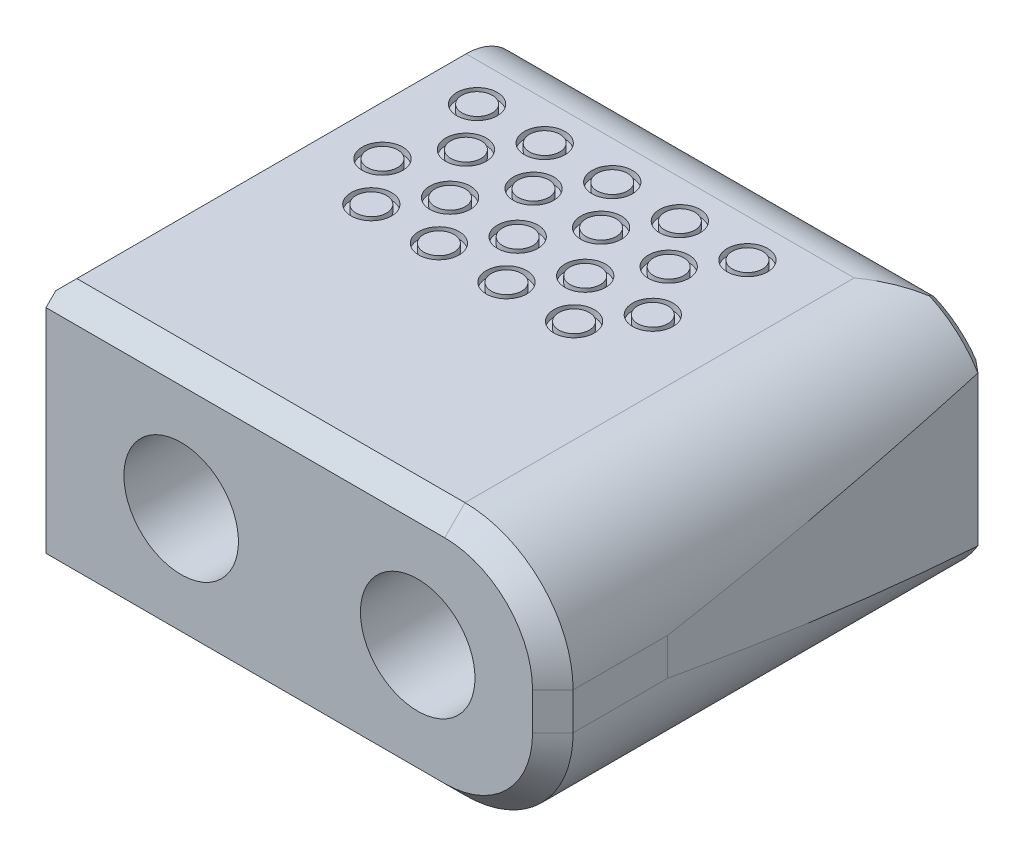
ISO-10303-21;
HEADER;
FILE_DESCRIPTION(('STEP AP214'),'2;1');
FILE_NAME('part.step','',(''),(''),'','','');
FILE_SCHEMA(('AUTOMOTIVE_DESIGN { 1 0 10303 214 1 1 1 1 }'));
ENDSEC;
DATA;
#1=APPLICATION_CONTEXT('core data for automotive mechanical design processes');
#2=APPLICATION_PROTOCOL_DEFINITION('international standard','automotive_design',2000,#1);
#3=PRODUCT_CONTEXT('',#1,'mechanical');
#4=PRODUCT('Part','Part','',(#3));
#5=PRODUCT_RELATED_PRODUCT_CATEGORY('part','',(#4));
#6=PRODUCT_DEFINITION_FORMATION('','',#4);
#7=PRODUCT_DEFINITION_CONTEXT('part definition',#1,'design');
#8=PRODUCT_DEFINITION('design','',#6,#7);
#9=PRODUCT_DEFINITION_SHAPE('','',#8);
#10=(LENGTH_UNIT() NAMED_UNIT(*) SI_UNIT(.MILLI.,.METRE.));
#11=(NAMED_UNIT(*) PLANE_ANGLE_UNIT() SI_UNIT($,.RADIAN.));
#12=(NAMED_UNIT(*) SI_UNIT($,.STERADIAN.) SOLID_ANGLE_UNIT());
#13=UNCERTAINTY_MEASURE_WITH_UNIT(LENGTH_MEASURE(1.E-05),#10,'distance_accuracy_value','');
#14=(GEOMETRIC_REPRESENTATION_CONTEXT(3) GLOBAL_UNCERTAINTY_ASSIGNED_CONTEXT((#13)) GLOBAL_UNIT_ASSIGNED_CONTEXT((#10,
#11,#12)) REPRESENTATION_CONTEXT('',''));
#15=CARTESIAN_POINT('',(0.,0.,0.));
#16=DIRECTION('',(0.,0.,1.));
#17=DIRECTION('',(1.,0.,0.));
#18=AXIS2_PLACEMENT_3D('',#15,#16,#17);
#19=CARTESIAN_POINT('',(19.05,4.7625,0.));
#20=DIRECTION('',(0.,-1.,0.));
#21=DIRECTION('',(0.,0.,-1.));
#22=AXIS2_PLACEMENT_3D('',#19,#20,#21);
#23=PLANE('',#22);
#24=CARTESIAN_POINT('',(8.59276920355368,4.7625,-8.71532783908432));
#25=DIRECTION('',(0.,-1.,0.));
#26=DIRECTION('',(0.,0.,-1.));
#27=AXIS2_PLACEMENT_3D('',#24,#25,#26);
#28=CIRCLE('',#27,0.761999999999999);
#29=CARTESIAN_POINT('',(8.59276920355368,4.7625,-9.47732783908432));
#30=VERTEX_POINT('',#29);
#31=EDGE_CURVE('E745',#30,#30,#28,.T.);
#32=ORIENTED_EDGE('',*,*,#31,.T.);
#33=EDGE_LOOP('',(#32));
#34=FACE_BOUND('',#33,.T.);
#35=CARTESIAN_POINT('',(3.51276920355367,4.7625,-8.71532783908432));
#36=DIRECTION('',(0.,-1.,0.));
#37=DIRECTION('',(0.,0.,-1.));
#38=AXIS2_PLACEMENT_3D('',#35,#36,#37);
#39=CIRCLE('',#38,0.762);
#40=CARTESIAN_POINT('',(3.51276920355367,4.7625,-9.47732783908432));
#41=VERTEX_POINT('',#40);
#42=EDGE_CURVE('E721',#41,#41,#39,.T.);
#43=ORIENTED_EDGE('',*,*,#42,.T.);
#44=EDGE_LOOP('',(#43));
#45=FACE_BOUND('',#44,.T.);
#46=CARTESIAN_POINT('',(9.8598525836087,4.7625,-10.4079501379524));
#47=DIRECTION('',(0.,-1.,0.));
#48=DIRECTION('',(0.,0.,-1.));
#49=AXIS2_PLACEMENT_3D('',#46,#47,#48);
#50=CIRCLE('',#49,0.762000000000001);
#51=CARTESIAN_POINT('',(9.8598525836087,4.7625,-11.1699501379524));
#52=VERTEX_POINT('',#51);
#53=EDGE_CURVE('E697',#52,#52,#50,.T.);
#54=ORIENTED_EDGE('',*,*,#53,.T.);
#55=EDGE_LOOP('',(#54));
#56=FACE_BOUND('',#55,.T.);
#57=CARTESIAN_POINT('',(4.7798525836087,4.7625,-10.4079501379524));
#58=DIRECTION('',(0.,-1.,0.));
#59=DIRECTION('',(0.,0.,-1.));
#60=AXIS2_PLACEMENT_3D('',#57,#58,#59);
#61=CIRCLE('',#60,0.761999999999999);
#62=CARTESIAN_POINT('',(4.7798525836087,4.7625,-11.1699501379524));
#63=VERTEX_POINT('',#62);
#64=EDGE_CURVE('E673',#63,#63,#61,.T.);
#65=ORIENTED_EDGE('',*,*,#64,.T.);
#66=EDGE_LOOP('',(#65));
#67=FACE_BOUND('',#66,.T.);
#68=CARTESIAN_POINT('',(11.1327692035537,4.7625,-12.2713278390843));
#69=DIRECTION('',(0.,-1.,0.));
#70=DIRECTION('',(0.,0.,-1.));
#71=AXIS2_PLACEMENT_3D('',#68,#69,#70);
#72=CIRCLE('',#71,0.762000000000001);
#73=CARTESIAN_POINT('',(11.1327692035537,4.7625,-13.0333278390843));
#74=VERTEX_POINT('',#73);
#75=EDGE_CURVE('E649',#74,#74,#72,.T.);
#76=ORIENTED_EDGE('',*,*,#75,.T.);
#77=EDGE_LOOP('',(#76));
#78=FACE_BOUND('',#77,.T.);
#79=CARTESIAN_POINT('',(6.05276920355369,4.7625,-12.2713278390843));
#80=DIRECTION('',(0.,-1.,0.));
#81=DIRECTION('',(0.,0.,-1.));
#82=AXIS2_PLACEMENT_3D('',#79,#80,#81);
#83=CIRCLE('',#82,0.761999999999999);
#84=CARTESIAN_POINT('',(6.05276920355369,4.7625,-13.0333278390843));
#85=VERTEX_POINT('',#84);
#86=EDGE_CURVE('E625',#85,#85,#83,.T.);
#87=ORIENTED_EDGE('',*,*,#86,.T.);
#88=EDGE_LOOP('',(#87));
#89=FACE_BOUND('',#88,.T.);
#90=CARTESIAN_POINT('',(12.3998525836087,4.7625,-13.9639501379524));
#91=DIRECTION('',(0.,-1.,0.));
#92=DIRECTION('',(0.,0.,-1.));
#93=AXIS2_PLACEMENT_3D('',#90,#91,#92);
#94=CIRCLE('',#93,0.762000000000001);
#95=CARTESIAN_POINT('',(12.3998525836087,4.7625,-14.7259501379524));
#96=VERTEX_POINT('',#95);
#97=EDGE_CURVE('E601',#96,#96,#94,.T.);
#98=ORIENTED_EDGE('',*,*,#97,.T.);
#99=EDGE_LOOP('',(#98));
#100=FACE_BOUND('',#99,.T.);
#101=CARTESIAN_POINT('',(7.31985258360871,4.7625,-13.9639501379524));
#102=DIRECTION('',(0.,-1.,0.));
#103=DIRECTION('',(0.,0.,-1.));
#104=AXIS2_PLACEMENT_3D('',#101,#102,#103);
#105=CIRCLE('',#104,0.762);
#106=CARTESIAN_POINT('',(7.31985258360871,4.7625,-14.7259501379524));
#107=VERTEX_POINT('',#106);
#108=EDGE_CURVE('E577',#107,#107,#105,.T.);
#109=ORIENTED_EDGE('',*,*,#108,.T.);
#110=EDGE_LOOP('',(#109));
#111=FACE_BOUND('',#110,.T.);
#112=CARTESIAN_POINT('',(2.23985258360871,4.7625,-13.9639501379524));
#113=DIRECTION('',(0.,-1.,0.));
#114=DIRECTION('',(0.,0.,-1.));
#115=AXIS2_PLACEMENT_3D('',#112,#113,#114);
#116=CIRCLE('',#115,0.762);
#117=CARTESIAN_POINT('',(2.23985258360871,4.7625,-14.7259501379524));
#118=VERTEX_POINT('',#117);
#119=EDGE_CURVE('E553',#118,#118,#116,.T.);
#120=ORIENTED_EDGE('',*,*,#119,.T.);
#121=EDGE_LOOP('',(#120));
#122=FACE_BOUND('',#121,.T.);
#123=DIRECTION('',(-1.,0.,0.));
#124=VECTOR('',#123,1.);
#125=CARTESIAN_POINT('',(19.05,4.7625,-15.3924));
#126=LINE('',#125,#124);
#127=CARTESIAN_POINT('',(14.986,4.7625,-15.3924));
#128=VERTEX_POINT('',#127);
#129=CARTESIAN_POINT('',(0.396875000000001,4.7625,-15.3924));
#130=VERTEX_POINT('',#129);
#131=EDGE_CURVE('E185',#128,#130,#126,.T.);
#132=ORIENTED_EDGE('',*,*,#131,.T.);
#133=DIRECTION('',(0.,0.,1.));
#134=VECTOR('',#133,1.);
#135=CARTESIAN_POINT('',(0.396874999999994,4.7625,-0.762000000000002));
#136=LINE('',#135,#134);
#137=CARTESIAN_POINT('',(0.396874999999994,4.7625,-0.762000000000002));
#138=VERTEX_POINT('',#137);
#139=EDGE_CURVE('E54',#130,#138,#136,.T.);
#140=ORIENTED_EDGE('',*,*,#139,.T.);
#141=DIRECTION('',(1.,0.,0.));
#142=VECTOR('',#141,1.);
#143=CARTESIAN_POINT('',(19.05,4.7625,-0.762000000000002));
#144=LINE('',#143,#142);
#145=CARTESIAN_POINT('',(14.986,4.7625,-0.762000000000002));
#146=VERTEX_POINT('',#145);
#147=EDGE_CURVE('E234',#138,#146,#144,.T.);
#148=ORIENTED_EDGE('',*,*,#147,.T.);
#149=DIRECTION('',(0.,0.,1.));
#150=VECTOR('',#149,1.);
#151=CARTESIAN_POINT('',(14.986,4.7625,0.));
#152=LINE('',#151,#150);
#153=EDGE_CURVE('E194',#146,#128,#152,.F.);
#154=ORIENTED_EDGE('',*,*,#153,.T.);
#155=EDGE_LOOP('',(#132,#140,#148,#154));
#156=FACE_BOUND('',#155,.T.);
#157=CARTESIAN_POINT('',(4.77985258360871,4.7625,-13.9639501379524));
#158=DIRECTION('',(0.,-1.,0.));
#159=DIRECTION('',(0.,0.,-1.));
#160=AXIS2_PLACEMENT_3D('',#157,#158,#159);
#161=CIRCLE('',#160,0.761999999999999);
#162=CARTESIAN_POINT('',(4.77985258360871,4.7625,-14.7259501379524));
#163=VERTEX_POINT('',#162);
#164=EDGE_CURVE('E565',#163,#163,#161,.T.);
#165=ORIENTED_EDGE('',*,*,#164,.T.);
#166=EDGE_LOOP('',(#165));
#167=FACE_BOUND('',#166,.T.);
#168=CARTESIAN_POINT('',(9.85985258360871,4.7625,-13.9639501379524));
#169=DIRECTION('',(0.,-1.,0.));
#170=DIRECTION('',(0.,0.,-1.));
#171=AXIS2_PLACEMENT_3D('',#168,#169,#170);
#172=CIRCLE('',#171,0.762000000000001);
#173=CARTESIAN_POINT('',(9.85985258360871,4.7625,-14.7259501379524));
#174=VERTEX_POINT('',#173);
#175=EDGE_CURVE('E589',#174,#174,#172,.T.);
#176=ORIENTED_EDGE('',*,*,#175,.T.);
#177=EDGE_LOOP('',(#176));
#178=FACE_BOUND('',#177,.T.);
#179=CARTESIAN_POINT('',(3.51276920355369,4.7625,-12.2713278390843));
#180=DIRECTION('',(0.,-1.,0.));
#181=DIRECTION('',(0.,0.,-1.));
#182=AXIS2_PLACEMENT_3D('',#179,#180,#181);
#183=CIRCLE('',#182,0.762);
#184=CARTESIAN_POINT('',(3.51276920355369,4.7625,-13.0333278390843));
#185=VERTEX_POINT('',#184);
#186=EDGE_CURVE('E613',#185,#185,#183,.T.);
#187=ORIENTED_EDGE('',*,*,#186,.T.);
#188=EDGE_LOOP('',(#187));
#189=FACE_BOUND('',#188,.T.);
#190=CARTESIAN_POINT('',(8.59276920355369,4.7625,-12.2713278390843));
#191=DIRECTION('',(0.,-1.,0.));
#192=DIRECTION('',(0.,0.,-1.));
#193=AXIS2_PLACEMENT_3D('',#190,#191,#192);
#194=CIRCLE('',#193,0.761999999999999);
#195=CARTESIAN_POINT('',(8.59276920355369,4.7625,-13.0333278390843));
#196=VERTEX_POINT('',#195);
#197=EDGE_CURVE('E637',#196,#196,#194,.T.);
#198=ORIENTED_EDGE('',*,*,#197,.T.);
#199=EDGE_LOOP('',(#198));
#200=FACE_BOUND('',#199,.T.);
#201=CARTESIAN_POINT('',(2.2398525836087,4.7625,-10.4079501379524));
#202=DIRECTION('',(0.,-1.,0.));
#203=DIRECTION('',(0.,0.,-1.));
#204=AXIS2_PLACEMENT_3D('',#201,#202,#203);
#205=CIRCLE('',#204,0.762);
#206=CARTESIAN_POINT('',(2.2398525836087,4.7625,-11.1699501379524));
#207=VERTEX_POINT('',#206);
#208=EDGE_CURVE('E661',#207,#207,#205,.T.);
#209=ORIENTED_EDGE('',*,*,#208,.T.);
#210=EDGE_LOOP('',(#209));
#211=FACE_BOUND('',#210,.T.);
#212=CARTESIAN_POINT('',(7.3198525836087,4.7625,-10.4079501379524));
#213=DIRECTION('',(0.,-1.,0.));
#214=DIRECTION('',(0.,0.,-1.));
#215=AXIS2_PLACEMENT_3D('',#212,#213,#214);
#216=CIRCLE('',#215,0.762);
#217=CARTESIAN_POINT('',(7.3198525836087,4.7625,-11.1699501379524));
#218=VERTEX_POINT('',#217);
#219=EDGE_CURVE('E685',#218,#218,#216,.T.);
#220=ORIENTED_EDGE('',*,*,#219,.T.);
#221=EDGE_LOOP('',(#220));
#222=FACE_BOUND('',#221,.T.);
#223=CARTESIAN_POINT('',(12.3998525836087,4.7625,-10.4079501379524));
#224=DIRECTION('',(0.,-1.,0.));
#225=DIRECTION('',(0.,0.,-1.));
#226=AXIS2_PLACEMENT_3D('',#223,#224,#225);
#227=CIRCLE('',#226,0.762000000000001);
#228=CARTESIAN_POINT('',(12.3998525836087,4.7625,-11.1699501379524));
#229=VERTEX_POINT('',#228);
#230=EDGE_CURVE('E709',#229,#229,#227,.T.);
#231=ORIENTED_EDGE('',*,*,#230,.T.);
#232=EDGE_LOOP('',(#231));
#233=FACE_BOUND('',#232,.T.);
#234=CARTESIAN_POINT('',(6.05276920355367,4.7625,-8.71532783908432));
#235=DIRECTION('',(0.,-1.,0.));
#236=DIRECTION('',(0.,0.,-1.));
#237=AXIS2_PLACEMENT_3D('',#234,#235,#236);
#238=CIRCLE('',#237,0.761999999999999);
#239=CARTESIAN_POINT('',(6.05276920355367,4.7625,-9.47732783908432));
#240=VERTEX_POINT('',#239);
#241=EDGE_CURVE('E733',#240,#240,#238,.T.);
#242=ORIENTED_EDGE('',*,*,#241,.T.);
#243=EDGE_LOOP('',(#242));
#244=FACE_BOUND('',#243,.T.);
#245=CARTESIAN_POINT('',(11.1327692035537,4.7625,-8.71532783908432));
#246=DIRECTION('',(0.,-1.,0.));
#247=DIRECTION('',(0.,0.,-1.));
#248=AXIS2_PLACEMENT_3D('',#245,#246,#247);
#249=CIRCLE('',#248,0.762000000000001);
#250=CARTESIAN_POINT('',(11.1327692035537,4.7625,-9.47732783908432));
#251=VERTEX_POINT('',#250);
#252=EDGE_CURVE('E757',#251,#251,#249,.T.);
#253=ORIENTED_EDGE('',*,*,#252,.T.);
#254=EDGE_LOOP('',(#253));
#255=FACE_BOUND('',#254,.T.);
#256=ADVANCED_FACE('F37',(#34,#45,#56,#67,#78,#89,#100,#111,#122,#156,#167,#178,#189,#200,#211,
#222,#233,#244,#255),#23,.F.);
#257=CARTESIAN_POINT('',(19.05,-4.7625,0.));
#258=DIRECTION('',(0.,0.,-1.));
#259=DIRECTION('',(-1.,0.,0.));
#260=AXIS2_PLACEMENT_3D('',#257,#258,#259);
#261=PLANE('',#260);
#262=CARTESIAN_POINT('',(5.08,0.,0.));
#263=DIRECTION('',(0.,0.,-1.));
#264=DIRECTION('',(-1.,0.,0.));
#265=AXIS2_PLACEMENT_3D('',#262,#263,#264);
#266=CIRCLE('',#265,2.15265);
#267=CARTESIAN_POINT('',(2.92735,0.,0.));
#268=VERTEX_POINT('',#267);
#269=EDGE_CURVE('E1454',#268,#268,#266,.T.);
#270=ORIENTED_EDGE('',*,*,#269,.T.);
#271=EDGE_LOOP('',(#270));
#272=FACE_BOUND('',#271,.T.);
#273=CARTESIAN_POINT('',(13.97,0.,0.));
#274=DIRECTION('',(0.,0.,-1.));
#275=DIRECTION('',(-1.,0.,0.));
#276=AXIS2_PLACEMENT_3D('',#273,#274,#275);
#277=CIRCLE('',#276,2.15265);
#278=CARTESIAN_POINT('',(11.81735,0.,0.));
#279=VERTEX_POINT('',#278);
#280=EDGE_CURVE('E1441',#279,#279,#277,.T.);
#281=ORIENTED_EDGE('',*,*,#280,.T.);
#282=EDGE_LOOP('',(#281));
#283=FACE_BOUND('',#282,.T.);
#284=DIRECTION('',(0.,-1.,0.));
#285=VECTOR('',#284,1.);
#286=CARTESIAN_POINT('',(0.,-4.7625,0.));
#287=LINE('',#286,#285);
#288=CARTESIAN_POINT('',(0.,4.0005,0.));
#289=VERTEX_POINT('',#288);
#290=CARTESIAN_POINT('',(0.,-4.0005,0.));
#291=VERTEX_POINT('',#290);
#292=EDGE_CURVE('E196',#289,#291,#287,.T.);
#293=ORIENTED_EDGE('',*,*,#292,.T.);
#294=DIRECTION('',(1.,0.,0.));
#295=VECTOR('',#294,1.);
#296=CARTESIAN_POINT('',(19.05,-4.0005,0.));
#297=LINE('',#296,#295);
#298=CARTESIAN_POINT('',(14.986,-4.0005,0.));
#299=VERTEX_POINT('',#298);
#300=EDGE_CURVE('E226',#291,#299,#297,.T.);
#301=ORIENTED_EDGE('',*,*,#300,.T.);
#302=CARTESIAN_POINT('',(14.986,-0.6985,0.));
#303=DIRECTION('',(0.,0.,-1.));
#304=DIRECTION('',(-1.,0.,0.));
#305=AXIS2_PLACEMENT_3D('',#302,#303,#304);
#306=CIRCLE('',#305,3.302);
#307=CARTESIAN_POINT('',(18.288,-0.6985,0.));
#308=VERTEX_POINT('',#307);
#309=EDGE_CURVE('E224',#299,#308,#306,.F.);
#310=ORIENTED_EDGE('',*,*,#309,.T.);
#311=DIRECTION('',(0.,1.,0.));
#312=VECTOR('',#311,1.);
#313=CARTESIAN_POINT('',(18.288,-4.7625,0.));
#314=LINE('',#313,#312);
#315=CARTESIAN_POINT('',(18.288,0.6985,0.));
#316=VERTEX_POINT('',#315);
#317=EDGE_CURVE('E222',#308,#316,#314,.T.);
#318=ORIENTED_EDGE('',*,*,#317,.T.);
#319=CARTESIAN_POINT('',(14.986,0.6985,0.));
#320=DIRECTION('',(0.,0.,-1.));
#321=DIRECTION('',(-1.,0.,0.));
#322=AXIS2_PLACEMENT_3D('',#319,#320,#321);
#323=CIRCLE('',#322,3.302);
#324=CARTESIAN_POINT('',(14.986,4.0005,0.));
#325=VERTEX_POINT('',#324);
#326=EDGE_CURVE('E220',#316,#325,#323,.F.);
#327=ORIENTED_EDGE('',*,*,#326,.T.);
#328=DIRECTION('',(-1.,0.,0.));
#329=VECTOR('',#328,1.);
#330=CARTESIAN_POINT('',(19.05,4.0005,0.));
#331=LINE('',#330,#329);
#332=EDGE_CURVE('E218',#325,#289,#331,.T.);
#333=ORIENTED_EDGE('',*,*,#332,.T.);
#334=EDGE_LOOP('',(#293,#301,#310,#318,#327,#333));
#335=FACE_BOUND('',#334,.T.);
#336=ADVANCED_FACE('F298',(#272,#283,#335),#261,.F.);
#337=CARTESIAN_POINT('',(19.05,-4.7625,0.));
#338=DIRECTION('',(0.,1.,0.));
#339=DIRECTION('',(0.,0.,1.));
#340=AXIS2_PLACEMENT_3D('',#337,#338,#339);
#341=PLANE('',#340);
#342=CARTESIAN_POINT('',(11.1327692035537,-4.7625,-8.71532783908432));
#343=DIRECTION('',(0.,-1.,0.));
#344=DIRECTION('',(0.,0.,-1.));
#345=AXIS2_PLACEMENT_3D('',#342,#343,#344);
#346=CIRCLE('',#345,0.762000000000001);
#347=CARTESIAN_POINT('',(11.1327692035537,-4.7625,-9.47732783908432));
#348=VERTEX_POINT('',#347);
#349=EDGE_CURVE('E541',#348,#348,#346,.T.);
#350=ORIENTED_EDGE('',*,*,#349,.F.);
#351=EDGE_LOOP('',(#350));
#352=FACE_BOUND('',#351,.T.);
#353=CARTESIAN_POINT('',(8.59276920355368,-4.7625,-8.71532783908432));
#354=DIRECTION('',(0.,-1.,0.));
#355=DIRECTION('',(0.,0.,-1.));
#356=AXIS2_PLACEMENT_3D('',#353,#354,#355);
#357=CIRCLE('',#356,0.761999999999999);
#358=CARTESIAN_POINT('',(8.59276920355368,-4.7625,-9.47732783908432));
#359=VERTEX_POINT('',#358);
#360=EDGE_CURVE('E529',#359,#359,#357,.T.);
#361=ORIENTED_EDGE('',*,*,#360,.F.);
#362=EDGE_LOOP('',(#361));
#363=FACE_BOUND('',#362,.T.);
#364=CARTESIAN_POINT('',(6.05276920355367,-4.7625,-8.71532783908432));
#365=DIRECTION('',(0.,-1.,0.));
#366=DIRECTION('',(0.,0.,-1.));
#367=AXIS2_PLACEMENT_3D('',#364,#365,#366);
#368=CIRCLE('',#367,0.761999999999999);
#369=CARTESIAN_POINT('',(6.05276920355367,-4.7625,-9.47732783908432));
#370=VERTEX_POINT('',#369);
#371=EDGE_CURVE('E517',#370,#370,#368,.T.);
#372=ORIENTED_EDGE('',*,*,#371,.F.);
#373=EDGE_LOOP('',(#372));
#374=FACE_BOUND('',#373,.T.);
#375=CARTESIAN_POINT('',(3.51276920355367,-4.7625,-8.71532783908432));
#376=DIRECTION('',(0.,-1.,0.));
#377=DIRECTION('',(0.,0.,-1.));
#378=AXIS2_PLACEMENT_3D('',#375,#376,#377);
#379=CIRCLE('',#378,0.762);
#380=CARTESIAN_POINT('',(3.51276920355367,-4.7625,-9.47732783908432));
#381=VERTEX_POINT('',#380);
#382=EDGE_CURVE('E505',#381,#381,#379,.T.);
#383=ORIENTED_EDGE('',*,*,#382,.F.);
#384=EDGE_LOOP('',(#383));
#385=FACE_BOUND('',#384,.T.);
#386=CARTESIAN_POINT('',(12.3998525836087,-4.7625,-10.4079501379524));
#387=DIRECTION('',(0.,-1.,0.));
#388=DIRECTION('',(0.,0.,-1.));
#389=AXIS2_PLACEMENT_3D('',#386,#387,#388);
#390=CIRCLE('',#389,0.762000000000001);
#391=CARTESIAN_POINT('',(12.3998525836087,-4.7625,-11.1699501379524));
#392=VERTEX_POINT('',#391);
#393=EDGE_CURVE('E493',#392,#392,#390,.T.);
#394=ORIENTED_EDGE('',*,*,#393,.F.);
#395=EDGE_LOOP('',(#394));
#396=FACE_BOUND('',#395,.T.);
#397=CARTESIAN_POINT('',(9.8598525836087,-4.7625,-10.4079501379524));
#398=DIRECTION('',(0.,-1.,0.));
#399=DIRECTION('',(0.,0.,-1.));
#400=AXIS2_PLACEMENT_3D('',#397,#398,#399);
#401=CIRCLE('',#400,0.762000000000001);
#402=CARTESIAN_POINT('',(9.8598525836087,-4.7625,-11.1699501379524));
#403=VERTEX_POINT('',#402);
#404=EDGE_CURVE('E481',#403,#403,#401,.T.);
#405=ORIENTED_EDGE('',*,*,#404,.F.);
#406=EDGE_LOOP('',(#405));
#407=FACE_BOUND('',#406,.T.);
#408=CARTESIAN_POINT('',(7.3198525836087,-4.7625,-10.4079501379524));
#409=DIRECTION('',(0.,-1.,0.));
#410=DIRECTION('',(0.,0.,-1.));
#411=AXIS2_PLACEMENT_3D('',#408,#409,#410);
#412=CIRCLE('',#411,0.762);
#413=CARTESIAN_POINT('',(7.3198525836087,-4.7625,-11.1699501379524));
#414=VERTEX_POINT('',#413);
#415=EDGE_CURVE('E469',#414,#414,#412,.T.);
#416=ORIENTED_EDGE('',*,*,#415,.F.);
#417=EDGE_LOOP('',(#416));
#418=FACE_BOUND('',#417,.T.);
#419=CARTESIAN_POINT('',(4.7798525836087,-4.7625,-10.4079501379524));
#420=DIRECTION('',(0.,-1.,0.));
#421=DIRECTION('',(0.,0.,-1.));
#422=AXIS2_PLACEMENT_3D('',#419,#420,#421);
#423=CIRCLE('',#422,0.761999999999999);
#424=CARTESIAN_POINT('',(4.7798525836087,-4.7625,-11.1699501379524));
#425=VERTEX_POINT('',#424);
#426=EDGE_CURVE('E457',#425,#425,#423,.T.);
#427=ORIENTED_EDGE('',*,*,#426,.F.);
#428=EDGE_LOOP('',(#427));
#429=FACE_BOUND('',#428,.T.);
#430=CARTESIAN_POINT('',(2.2398525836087,-4.7625,-10.4079501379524));
#431=DIRECTION('',(0.,-1.,0.));
#432=DIRECTION('',(0.,0.,-1.));
#433=AXIS2_PLACEMENT_3D('',#430,#431,#432);
#434=CIRCLE('',#433,0.762);
#435=CARTESIAN_POINT('',(2.2398525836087,-4.7625,-11.1699501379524));
#436=VERTEX_POINT('',#435);
#437=EDGE_CURVE('E445',#436,#436,#434,.T.);
#438=ORIENTED_EDGE('',*,*,#437,.F.);
#439=EDGE_LOOP('',(#438));
#440=FACE_BOUND('',#439,.T.);
#441=CARTESIAN_POINT('',(11.1327692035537,-4.7625,-12.2713278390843));
#442=DIRECTION('',(0.,-1.,0.));
#443=DIRECTION('',(0.,0.,-1.));
#444=AXIS2_PLACEMENT_3D('',#441,#442,#443);
#445=CIRCLE('',#444,0.762000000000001);
#446=CARTESIAN_POINT('',(11.1327692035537,-4.7625,-13.0333278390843));
#447=VERTEX_POINT('',#446);
#448=EDGE_CURVE('E433',#447,#447,#445,.T.);
#449=ORIENTED_EDGE('',*,*,#448,.F.);
#450=EDGE_LOOP('',(#449));
#451=FACE_BOUND('',#450,.T.);
#452=CARTESIAN_POINT('',(8.59276920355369,-4.7625,-12.2713278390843));
#453=DIRECTION('',(0.,-1.,0.));
#454=DIRECTION('',(0.,0.,-1.));
#455=AXIS2_PLACEMENT_3D('',#452,#453,#454);
#456=CIRCLE('',#455,0.761999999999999);
#457=CARTESIAN_POINT('',(8.59276920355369,-4.7625,-13.0333278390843));
#458=VERTEX_POINT('',#457);
#459=EDGE_CURVE('E421',#458,#458,#456,.T.);
#460=ORIENTED_EDGE('',*,*,#459,.F.);
#461=EDGE_LOOP('',(#460));
#462=FACE_BOUND('',#461,.T.);
#463=CARTESIAN_POINT('',(6.05276920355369,-4.7625,-12.2713278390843));
#464=DIRECTION('',(0.,-1.,0.));
#465=DIRECTION('',(0.,0.,-1.));
#466=AXIS2_PLACEMENT_3D('',#463,#464,#465);
#467=CIRCLE('',#466,0.761999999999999);
#468=CARTESIAN_POINT('',(6.05276920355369,-4.7625,-13.0333278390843));
#469=VERTEX_POINT('',#468);
#470=EDGE_CURVE('E409',#469,#469,#467,.T.);
#471=ORIENTED_EDGE('',*,*,#470,.F.);
#472=EDGE_LOOP('',(#471));
#473=FACE_BOUND('',#472,.T.);
#474=CARTESIAN_POINT('',(3.51276920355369,-4.7625,-12.2713278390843));
#475=DIRECTION('',(0.,-1.,0.));
#476=DIRECTION('',(0.,0.,-1.));
#477=AXIS2_PLACEMENT_3D('',#474,#475,#476);
#478=CIRCLE('',#477,0.762);
#479=CARTESIAN_POINT('',(3.51276920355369,-4.7625,-13.0333278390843));
#480=VERTEX_POINT('',#479);
#481=EDGE_CURVE('E397',#480,#480,#478,.T.);
#482=ORIENTED_EDGE('',*,*,#481,.F.);
#483=EDGE_LOOP('',(#482));
#484=FACE_BOUND('',#483,.T.);
#485=CARTESIAN_POINT('',(12.3998525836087,-4.7625,-13.9639501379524));
#486=DIRECTION('',(0.,-1.,0.));
#487=DIRECTION('',(0.,0.,-1.));
#488=AXIS2_PLACEMENT_3D('',#485,#486,#487);
#489=CIRCLE('',#488,0.762000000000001);
#490=CARTESIAN_POINT('',(12.3998525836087,-4.7625,-14.7259501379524));
#491=VERTEX_POINT('',#490);
#492=EDGE_CURVE('E385',#491,#491,#489,.T.);
#493=ORIENTED_EDGE('',*,*,#492,.F.);
#494=EDGE_LOOP('',(#493));
#495=FACE_BOUND('',#494,.T.);
#496=CARTESIAN_POINT('',(9.85985258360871,-4.7625,-13.9639501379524));
#497=DIRECTION('',(0.,-1.,0.));
#498=DIRECTION('',(0.,0.,-1.));
#499=AXIS2_PLACEMENT_3D('',#496,#497,#498);
#500=CIRCLE('',#499,0.762000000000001);
#501=CARTESIAN_POINT('',(9.85985258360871,-4.7625,-14.7259501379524));
#502=VERTEX_POINT('',#501);
#503=EDGE_CURVE('E373',#502,#502,#500,.T.);
#504=ORIENTED_EDGE('',*,*,#503,.F.);
#505=EDGE_LOOP('',(#504));
#506=FACE_BOUND('',#505,.T.);
#507=CARTESIAN_POINT('',(7.31985258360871,-4.7625,-13.9639501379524));
#508=DIRECTION('',(0.,-1.,0.));
#509=DIRECTION('',(0.,0.,-1.));
#510=AXIS2_PLACEMENT_3D('',#507,#508,#509);
#511=CIRCLE('',#510,0.762);
#512=CARTESIAN_POINT('',(7.31985258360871,-4.7625,-14.7259501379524));
#513=VERTEX_POINT('',#512);
#514=EDGE_CURVE('E361',#513,#513,#511,.T.);
#515=ORIENTED_EDGE('',*,*,#514,.F.);
#516=EDGE_LOOP('',(#515));
#517=FACE_BOUND('',#516,.T.);
#518=CARTESIAN_POINT('',(4.77985258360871,-4.7625,-13.9639501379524));
#519=DIRECTION('',(0.,-1.,0.));
#520=DIRECTION('',(0.,0.,-1.));
#521=AXIS2_PLACEMENT_3D('',#518,#519,#520);
#522=CIRCLE('',#521,0.761999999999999);
#523=CARTESIAN_POINT('',(4.77985258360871,-4.7625,-14.7259501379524));
#524=VERTEX_POINT('',#523);
#525=EDGE_CURVE('E349',#524,#524,#522,.T.);
#526=ORIENTED_EDGE('',*,*,#525,.F.);
#527=EDGE_LOOP('',(#526));
#528=FACE_BOUND('',#527,.T.);
#529=CARTESIAN_POINT('',(2.23985258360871,-4.7625,-13.9639501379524));
#530=DIRECTION('',(0.,-1.,0.));
#531=DIRECTION('',(0.,0.,-1.));
#532=AXIS2_PLACEMENT_3D('',#529,#530,#531);
#533=CIRCLE('',#532,0.762);
#534=CARTESIAN_POINT('',(2.23985258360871,-4.7625,-14.7259501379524));
#535=VERTEX_POINT('',#534);
#536=EDGE_CURVE('E335',#535,#535,#533,.T.);
#537=ORIENTED_EDGE('',*,*,#536,.F.);
#538=EDGE_LOOP('',(#537));
#539=FACE_BOUND('',#538,.T.);
#540=DIRECTION('',(-1.,0.,0.));
#541=VECTOR('',#540,1.);
#542=CARTESIAN_POINT('',(19.05,-4.7625,-0.762000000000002));
#543=LINE('',#542,#541);
#544=CARTESIAN_POINT('',(14.986,-4.7625,-0.762000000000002));
#545=VERTEX_POINT('',#544);
#546=CARTESIAN_POINT('',(0.396874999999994,-4.7625,-0.762000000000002));
#547=VERTEX_POINT('',#546);
#548=EDGE_CURVE('E210',#545,#547,#543,.T.);
#549=ORIENTED_EDGE('',*,*,#548,.T.);
#550=DIRECTION('',(0.,0.,-1.));
#551=VECTOR('',#550,1.);
#552=CARTESIAN_POINT('',(0.396874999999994,-4.7625,-15.3924));
#553=LINE('',#552,#551);
#554=CARTESIAN_POINT('',(0.396875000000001,-4.7625,-15.3924));
#555=VERTEX_POINT('',#554);
#556=EDGE_CURVE('E1342',#547,#555,#553,.T.);
#557=ORIENTED_EDGE('',*,*,#556,.T.);
#558=DIRECTION('',(-1.,0.,0.));
#559=VECTOR('',#558,1.);
#560=CARTESIAN_POINT('',(19.05,-4.7625,-15.3924));
#561=LINE('',#560,#559);
#562=CARTESIAN_POINT('',(14.986,-4.7625,-15.3924));
#563=VERTEX_POINT('',#562);
#564=EDGE_CURVE('E290',#563,#555,#561,.T.);
#565=ORIENTED_EDGE('',*,*,#564,.F.);
#566=DIRECTION('',(0.,0.,-1.));
#567=VECTOR('',#566,1.);
#568=CARTESIAN_POINT('',(14.986,-4.7625,0.));
#569=LINE('',#568,#567);
#570=EDGE_CURVE('E191',#563,#545,#569,.F.);
#571=ORIENTED_EDGE('',*,*,#570,.T.);
#572=EDGE_LOOP('',(#549,#557,#565,#571));
#573=FACE_BOUND('',#572,.T.);
#574=ADVANCED_FACE('F796',(#352,#363,#374,#385,#396,#407,#418,#429,#440,#451,#462,#473,#484,
#495,#506,#517,#528,#539,#573),#341,.F.);
#575=CARTESIAN_POINT('',(19.05,-4.7625,-16.9672));
#576=DIRECTION('',(0.,0.,1.));
#577=DIRECTION('',(1.,0.,0.));
#578=AXIS2_PLACEMENT_3D('',#575,#576,#577);
#579=PLANE('',#578);
#580=DIRECTION('',(-1.,0.,0.));
#581=VECTOR('',#580,1.);
#582=CARTESIAN_POINT('',(19.05,-4.07742268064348,-16.9672));
#583=LINE('',#582,#581);
#584=CARTESIAN_POINT('',(16.4110218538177,-4.07742268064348,-16.9672));
#585=VERTEX_POINT('',#584);
#586=CARTESIAN_POINT('',(0.396875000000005,-4.07742268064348,-16.9672));
#587=VERTEX_POINT('',#586);
#588=EDGE_CURVE('E289',#585,#587,#583,.T.);
#589=ORIENTED_EDGE('',*,*,#588,.T.);
#590=DIRECTION('',(0.,1.,0.));
#591=VECTOR('',#590,1.);
#592=CARTESIAN_POINT('',(0.396874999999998,4.07742268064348,-16.9672));
#593=LINE('',#592,#591);
#594=CARTESIAN_POINT('',(0.396875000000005,4.07742268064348,-16.9672));
#595=VERTEX_POINT('',#594);
#596=EDGE_CURVE('E11',#587,#595,#593,.T.);
#597=ORIENTED_EDGE('',*,*,#596,.T.);
#598=DIRECTION('',(-1.,0.,0.));
#599=VECTOR('',#598,1.);
#600=CARTESIAN_POINT('',(19.05,4.07742268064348,-16.9672));
#601=LINE('',#600,#599);
#602=CARTESIAN_POINT('',(16.4110218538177,4.07742268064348,-16.9672));
#603=VERTEX_POINT('',#602);
#604=EDGE_CURVE('E313',#603,#595,#601,.T.);
#605=ORIENTED_EDGE('',*,*,#604,.F.);
#606=CARTESIAN_POINT('',(14.986,0.6985,-16.9672));
#607=DIRECTION('',(0.,0.,1.));
#608=DIRECTION('',(1.,0.,0.));
#609=AXIS2_PLACEMENT_3D('',#606,#607,#608);
#610=CIRCLE('',#609,3.667125);
#611=CARTESIAN_POINT('',(17.9752757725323,2.82265539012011,-16.9672));
#612=VERTEX_POINT('',#611);
#613=EDGE_CURVE('E202',#603,#612,#610,.F.);
#614=ORIENTED_EDGE('',*,*,#613,.T.);
#615=DIRECTION('',(0.,-1.,0.));
#616=VECTOR('',#615,1.);
#617=CARTESIAN_POINT('',(17.9752757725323,-4.7625,-16.9672));
#618=LINE('',#617,#616);
#619=CARTESIAN_POINT('',(17.9752757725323,-2.82265539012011,-16.9672));
#620=VERTEX_POINT('',#619);
#621=EDGE_CURVE('E2945',#612,#620,#618,.T.);
#622=ORIENTED_EDGE('',*,*,#621,.T.);
#623=CARTESIAN_POINT('',(14.986,-0.6985,-16.9672));
#624=DIRECTION('',(0.,0.,1.));
#625=DIRECTION('',(1.,0.,0.));
#626=AXIS2_PLACEMENT_3D('',#623,#624,#625);
#627=CIRCLE('',#626,3.667125);
#628=EDGE_CURVE('E205',#620,#585,#627,.F.);
#629=ORIENTED_EDGE('',*,*,#628,.T.);
#630=EDGE_LOOP('',(#589,#597,#605,#614,#622,#629));
#631=FACE_BOUND('',#630,.T.);
#632=CARTESIAN_POINT('',(5.08,0.,-16.9672));
#633=DIRECTION('',(0.,0.,-1.));
#634=DIRECTION('',(-1.,0.,0.));
#635=AXIS2_PLACEMENT_3D('',#632,#633,#634);
#636=CIRCLE('',#635,3.302);
#637=CARTESIAN_POINT('',(1.778,0.,-16.9672));
#638=VERTEX_POINT('',#637);
#639=EDGE_CURVE('E250',#638,#638,#636,.T.);
#640=ORIENTED_EDGE('',*,*,#639,.F.);
#641=EDGE_LOOP('',(#640));
#642=FACE_BOUND('',#641,.T.);
#643=CARTESIAN_POINT('',(13.97,0.,-16.9672));
#644=DIRECTION('',(0.,0.,-1.));
#645=DIRECTION('',(-1.,0.,0.));
#646=AXIS2_PLACEMENT_3D('',#643,#644,#645);
#647=CIRCLE('',#646,3.302);
#648=CARTESIAN_POINT('',(10.668,0.,-16.9672));
#649=VERTEX_POINT('',#648);
#650=EDGE_CURVE('E1451',#649,#649,#647,.T.);
#651=ORIENTED_EDGE('',*,*,#650,.F.);
#652=EDGE_LOOP('',(#651));
#653=FACE_BOUND('',#652,.T.);
#654=ADVANCED_FACE('F1337',(#631,#642,#653),#579,.F.);
#655=CARTESIAN_POINT('',(19.05,4.7625,0.));
#656=DIRECTION('',(-1.,0.,0.));
#657=DIRECTION('',(0.,0.,1.));
#658=AXIS2_PLACEMENT_3D('',#655,#656,#657);
#659=PLANE('',#658);
#660=DIRECTION('',(0.,0.,-1.));
#661=VECTOR('',#660,1.);
#662=CARTESIAN_POINT('',(19.05,-0.6985,0.));
#663=LINE('',#662,#661);
#664=CARTESIAN_POINT('',(19.05,-0.6985,-0.762000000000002));
#665=VERTEX_POINT('',#664);
#666=CARTESIAN_POINT('',(19.05,-0.6985,-4.318));
#667=VERTEX_POINT('',#666);
#668=EDGE_CURVE('E180',#665,#667,#663,.T.);
#669=ORIENTED_EDGE('',*,*,#668,.T.);
#670=DIRECTION('',(0.,1.,0.));
#671=VECTOR('',#670,1.);
#672=CARTESIAN_POINT('',(19.05,-12.5,-4.318));
#673=LINE('',#672,#671);
#674=CARTESIAN_POINT('',(19.05,0.6985,-4.318));
#675=VERTEX_POINT('',#674);
#676=EDGE_CURVE('E163',#667,#675,#673,.T.);
#677=ORIENTED_EDGE('',*,*,#676,.T.);
#678=DIRECTION('',(0.,0.,1.));
#679=VECTOR('',#678,1.);
#680=CARTESIAN_POINT('',(19.05,0.6985,0.));
#681=LINE('',#680,#679);
#682=CARTESIAN_POINT('',(19.05,0.6985,-0.762000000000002));
#683=VERTEX_POINT('',#682);
#684=EDGE_CURVE('E192',#675,#683,#681,.T.);
#685=ORIENTED_EDGE('',*,*,#684,.T.);
#686=DIRECTION('',(0.,-1.,0.));
#687=VECTOR('',#686,1.);
#688=CARTESIAN_POINT('',(19.05,4.7625,-0.762000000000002));
#689=LINE('',#688,#687);
#690=EDGE_CURVE('E190',#683,#665,#689,.T.);
#691=ORIENTED_EDGE('',*,*,#690,.T.);
#692=EDGE_LOOP('',(#669,#677,#685,#691));
#693=FACE_BOUND('',#692,.T.);
#694=ADVANCED_FACE('F188',(#693),#659,.F.);
#695=CARTESIAN_POINT('',(0.,4.7625,0.));
#696=DIRECTION('',(-1.,0.,0.));
#697=DIRECTION('',(0.,0.,1.));
#698=AXIS2_PLACEMENT_3D('',#695,#696,#697);
#699=PLANE('',#698);
#700=CARTESIAN_POINT('',(0.,-2.60995028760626,-15.3924));
#701=DIRECTION('',(-1.,0.,0.));
#702=DIRECTION('',(0.,0.,1.));
#703=AXIS2_PLACEMENT_3D('',#700,#701,#702);
#704=CIRCLE('',#703,1.75567471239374);
#705=CARTESIAN_POINT('',(0.,-3.91182831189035,-16.570325));
#706=VERTEX_POINT('',#705);
#707=CARTESIAN_POINT('',(0.,-4.365625,-15.3924));
#708=VERTEX_POINT('',#707);
#709=EDGE_CURVE('E1395',#706,#708,#704,.T.);
#710=ORIENTED_EDGE('',*,*,#709,.T.);
#711=DIRECTION('',(0.,0.,1.));
#712=VECTOR('',#711,1.);
#713=CARTESIAN_POINT('',(0.,-4.365625,-0.762000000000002));
#714=LINE('',#713,#712);
#715=CARTESIAN_POINT('',(0.,-4.365625,-0.365125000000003));
#716=VERTEX_POINT('',#715);
#717=EDGE_CURVE('E1355',#708,#716,#714,.T.);
#718=ORIENTED_EDGE('',*,*,#717,.T.);
#719=DIRECTION('',(0.,-0.707106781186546,-0.707106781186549));
#720=VECTOR('',#719,1.);
#721=CARTESIAN_POINT('',(0.,0.380999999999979,4.3815));
#722=LINE('',#721,#720);
#723=EDGE_CURVE('E216',#716,#291,#722,.F.);
#724=ORIENTED_EDGE('',*,*,#723,.T.);
#725=ORIENTED_EDGE('',*,*,#292,.F.);
#726=DIRECTION('',(0.,-0.707106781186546,0.707106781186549));
#727=VECTOR('',#726,1.);
#728=CARTESIAN_POINT('',(0.,4.3815,-0.380999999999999));
#729=LINE('',#728,#727);
#730=CARTESIAN_POINT('',(0.,4.365625,-0.365125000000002));
#731=VERTEX_POINT('',#730);
#732=EDGE_CURVE('E213',#289,#731,#729,.F.);
#733=ORIENTED_EDGE('',*,*,#732,.T.);
#734=DIRECTION('',(0.,0.,-1.));
#735=VECTOR('',#734,1.);
#736=CARTESIAN_POINT('',(0.,4.365625,-15.3924));
#737=LINE('',#736,#735);
#738=CARTESIAN_POINT('',(0.,4.365625,-15.3924));
#739=VERTEX_POINT('',#738);
#740=EDGE_CURVE('E1358',#731,#739,#737,.T.);
#741=ORIENTED_EDGE('',*,*,#740,.T.);
#742=CARTESIAN_POINT('',(0.,2.60995028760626,-15.3924));
#743=DIRECTION('',(-1.,0.,0.));
#744=DIRECTION('',(0.,0.,1.));
#745=AXIS2_PLACEMENT_3D('',#742,#743,#744);
#746=CIRCLE('',#745,1.75567471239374);
#747=CARTESIAN_POINT('',(0.,3.91182831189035,-16.570325));
#748=VERTEX_POINT('',#747);
#749=EDGE_CURVE('E1404',#739,#748,#746,.T.);
#750=ORIENTED_EDGE('',*,*,#749,.T.);
#751=DIRECTION('',(0.,-1.,0.));
#752=VECTOR('',#751,1.);
#753=CARTESIAN_POINT('',(0.,-4.07742268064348,-16.570325));
#754=LINE('',#753,#752);
#755=EDGE_CURVE('E1401',#748,#706,#754,.T.);
#756=ORIENTED_EDGE('',*,*,#755,.T.);
#757=EDGE_LOOP('',(#710,#718,#724,#725,#733,#741,#750,#756));
#758=FACE_BOUND('',#757,.T.);
#759=ADVANCED_FACE('F1414',(#758),#699,.T.);
#760=CARTESIAN_POINT('',(13.97,0.,-16.9672));
#761=DIRECTION('',(0.,0.,-1.));
#762=DIRECTION('',(-1.,0.,0.));
#763=AXIS2_PLACEMENT_3D('',#760,#761,#762);
#764=CYLINDRICAL_SURFACE('',#763,2.15265);
#765=ORIENTED_EDGE('',*,*,#280,.F.);
#766=EDGE_LOOP('',(#765));
#767=FACE_BOUND('',#766,.T.);
#768=CARTESIAN_POINT('',(13.97,0.,-12.9032));
#769=DIRECTION('',(0.,0.,-1.));
#770=DIRECTION('',(-1.,0.,0.));
#771=AXIS2_PLACEMENT_3D('',#768,#769,#770);
#772=CIRCLE('',#771,2.15265);
#773=CARTESIAN_POINT('',(11.81735,0.,-12.9032));
#774=VERTEX_POINT('',#773);
#775=EDGE_CURVE('E1443',#774,#774,#772,.T.);
#776=ORIENTED_EDGE('',*,*,#775,.T.);
#777=EDGE_LOOP('',(#776));
#778=FACE_BOUND('',#777,.T.);
#779=ADVANCED_FACE('F1485',(#767,#778),#764,.F.);
#780=CARTESIAN_POINT('',(16.12265,0.,-12.9032));
#781=DIRECTION('',(0.,0.,1.));
#782=DIRECTION('',(1.,0.,0.));
#783=AXIS2_PLACEMENT_3D('',#780,#781,#782);
#784=PLANE('',#783);
#785=ORIENTED_EDGE('',*,*,#775,.F.);
#786=EDGE_LOOP('',(#785));
#787=FACE_BOUND('',#786,.T.);
#788=CARTESIAN_POINT('',(13.97,0.,-12.9032));
#789=DIRECTION('',(0.,0.,-1.));
#790=DIRECTION('',(-1.,0.,0.));
#791=AXIS2_PLACEMENT_3D('',#788,#789,#790);
#792=CIRCLE('',#791,3.302);
#793=CARTESIAN_POINT('',(10.668,0.,-12.9032));
#794=VERTEX_POINT('',#793);
#795=EDGE_CURVE('E1448',#794,#794,#792,.T.);
#796=ORIENTED_EDGE('',*,*,#795,.T.);
#797=EDGE_LOOP('',(#796));
#798=FACE_BOUND('',#797,.T.);
#799=ADVANCED_FACE('F1475',(#787,#798),#784,.F.);
#800=CARTESIAN_POINT('',(13.97,0.,-16.9672));
#801=DIRECTION('',(0.,0.,-1.));
#802=DIRECTION('',(-1.,0.,0.));
#803=AXIS2_PLACEMENT_3D('',#800,#801,#802);
#804=CYLINDRICAL_SURFACE('',#803,3.302);
#805=ORIENTED_EDGE('',*,*,#795,.F.);
#806=EDGE_LOOP('',(#805));
#807=FACE_BOUND('',#806,.T.);
#808=ORIENTED_EDGE('',*,*,#650,.T.);
#809=EDGE_LOOP('',(#808));
#810=FACE_BOUND('',#809,.T.);
#811=ADVANCED_FACE('F1472',(#807,#810),#804,.F.);
#812=CARTESIAN_POINT('',(5.08,0.,-16.9672));
#813=DIRECTION('',(0.,0.,-1.));
#814=DIRECTION('',(-1.,0.,0.));
#815=AXIS2_PLACEMENT_3D('',#812,#813,#814);
#816=CYLINDRICAL_SURFACE('',#815,2.15265);
#817=ORIENTED_EDGE('',*,*,#269,.F.);
#818=EDGE_LOOP('',(#817));
#819=FACE_BOUND('',#818,.T.);
#820=CARTESIAN_POINT('',(5.08,0.,-12.9032));
#821=DIRECTION('',(0.,0.,-1.));
#822=DIRECTION('',(-1.,0.,0.));
#823=AXIS2_PLACEMENT_3D('',#820,#821,#822);
#824=CIRCLE('',#823,2.15265);
#825=CARTESIAN_POINT('',(2.92735,0.,-12.9032));
#826=VERTEX_POINT('',#825);
#827=EDGE_CURVE('E1457',#826,#826,#824,.T.);
#828=ORIENTED_EDGE('',*,*,#827,.T.);
#829=EDGE_LOOP('',(#828));
#830=FACE_BOUND('',#829,.T.);
#831=ADVANCED_FACE('F1474',(#819,#830),#816,.F.);
#832=CARTESIAN_POINT('',(7.23265,0.,-12.9032));
#833=DIRECTION('',(0.,0.,1.));
#834=DIRECTION('',(1.,0.,0.));
#835=AXIS2_PLACEMENT_3D('',#832,#833,#834);
#836=PLANE('',#835);
#837=ORIENTED_EDGE('',*,*,#827,.F.);
#838=EDGE_LOOP('',(#837));
#839=FACE_BOUND('',#838,.T.);
#840=CARTESIAN_POINT('',(5.08,0.,-12.9032));
#841=DIRECTION('',(0.,0.,-1.));
#842=DIRECTION('',(-1.,0.,0.));
#843=AXIS2_PLACEMENT_3D('',#840,#841,#842);
#844=CIRCLE('',#843,3.302);
#845=CARTESIAN_POINT('',(1.778,0.,-12.9032));
#846=VERTEX_POINT('',#845);
#847=EDGE_CURVE('E1459',#846,#846,#844,.T.);
#848=ORIENTED_EDGE('',*,*,#847,.T.);
#849=EDGE_LOOP('',(#848));
#850=FACE_BOUND('',#849,.T.);
#851=ADVANCED_FACE('F1482',(#839,#850),#836,.F.);
#852=CARTESIAN_POINT('',(5.08,0.,-16.9672));
#853=DIRECTION('',(0.,0.,-1.));
#854=DIRECTION('',(-1.,0.,0.));
#855=AXIS2_PLACEMENT_3D('',#852,#853,#854);
#856=CYLINDRICAL_SURFACE('',#855,3.302);
#857=ORIENTED_EDGE('',*,*,#847,.F.);
#858=EDGE_LOOP('',(#857));
#859=FACE_BOUND('',#858,.T.);
#860=ORIENTED_EDGE('',*,*,#639,.T.);
#861=EDGE_LOOP('',(#860));
#862=FACE_BOUND('',#861,.T.);
#863=ADVANCED_FACE('F278',(#859,#862),#856,.F.);
#864=CARTESIAN_POINT('',(14.986,-0.6985,0.));
#865=DIRECTION('',(0.,0.,-1.));
#866=DIRECTION('',(-1.,0.,0.));
#867=AXIS2_PLACEMENT_3D('',#864,#865,#866);
#868=CYLINDRICAL_SURFACE('',#867,4.064);
#869=CARTESIAN_POINT('',(18.4575968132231,-2.81134442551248,-16.570325));
#870=CARTESIAN_POINT('',(18.5221870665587,-2.70520831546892,-15.9039372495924));
#871=CARTESIAN_POINT('',(18.5814740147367,-2.5968454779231,-15.2374043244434));
#872=CARTESIAN_POINT('',(18.6894645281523,-2.37644871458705,-13.9041041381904));
#873=CARTESIAN_POINT('',(18.7381683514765,-2.26441487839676,-13.2373368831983));
#874=CARTESIAN_POINT('',(18.8684329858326,-1.92400200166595,-11.2368927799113));
#875=CARTESIAN_POINT('',(18.9341637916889,-1.69128350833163,-9.90289979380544));
#876=CARTESIAN_POINT('',(19.0255074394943,-1.2095798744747,-7.17530529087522));
#877=CARTESIAN_POINT('',(19.0492108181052,-0.960331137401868,-5.78168520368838));
#878=CARTESIAN_POINT('',(19.0499935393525,-0.706867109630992,-4.36477356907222));
#879=CARTESIAN_POINT('',(19.0499999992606,-0.702683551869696,-4.34138677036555));
#880=CARTESIAN_POINT('',(19.05,-0.6985,-4.318));
#881=B_SPLINE_CURVE_WITH_KNOTS('',3,(#869,#870,#871,#872,#873,#874,#875,#876,#877,#878,#879,
#880),.UNSPECIFIED.,.F.,.F.,(4,2,2,2,2,4),(0.,2.03356432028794,4.0670790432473,8.13357818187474,
12.380510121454,12.4517842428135),.UNSPECIFIED.);
#882=CARTESIAN_POINT('',(18.4575968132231,-2.81134442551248,-16.570325));
#883=VERTEX_POINT('',#882);
#884=EDGE_CURVE('E167',#667,#883,#881,.F.);
#885=ORIENTED_EDGE('',*,*,#884,.F.);
#886=ORIENTED_EDGE('',*,*,#668,.F.);
#887=CARTESIAN_POINT('',(14.986,-0.6985,-0.762000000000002));
#888=DIRECTION('',(0.,0.,-1.));
#889=DIRECTION('',(-1.,0.,0.));
#890=AXIS2_PLACEMENT_3D('',#887,#888,#889);
#891=CIRCLE('',#890,4.064);
#892=EDGE_CURVE('E228',#665,#545,#891,.T.);
#893=ORIENTED_EDGE('',*,*,#892,.T.);
#894=ORIENTED_EDGE('',*,*,#570,.F.);
#895=CARTESIAN_POINT('',(14.986,-4.7625,-15.3924));
#896=CARTESIAN_POINT('',(14.9859999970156,-4.7625,-15.3922717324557));
#897=CARTESIAN_POINT('',(14.9862932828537,-4.76249998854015,-15.3921434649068));
#898=CARTESIAN_POINT('',(14.9869165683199,-4.76249992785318,-15.3918037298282));
#899=CARTESIAN_POINT('',(14.9871470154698,-4.76249985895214,-15.3915922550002));
#900=CARTESIAN_POINT('',(14.9880742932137,-4.76249949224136,-15.3908173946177));
#901=CARTESIAN_POINT('',(14.9889089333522,-4.76249900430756,-15.3902541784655));
#902=CARTESIAN_POINT('',(14.9920296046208,-4.76249628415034,-15.3880933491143));
#903=CARTESIAN_POINT('',(14.9941664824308,-4.76249249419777,-15.3864953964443));
#904=CARTESIAN_POINT('',(15.0322721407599,-4.76239343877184,-15.3580729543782));
#905=CARTESIAN_POINT('',(15.0697749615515,-4.7617986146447,-15.3312519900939));
#906=CARTESIAN_POINT('',(15.144349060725,-4.75959436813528,-15.2773543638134));
#907=CARTESIAN_POINT('',(15.1814118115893,-4.75797447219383,-15.2502779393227));
#908=CARTESIAN_POINT('',(15.2904455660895,-4.75171100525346,-15.1708284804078));
#909=CARTESIAN_POINT('',(15.3625955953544,-4.7456564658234,-15.1185174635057));
#910=CARTESIAN_POINT('',(15.5127649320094,-4.72898984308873,-15.009745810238));
#911=CARTESIAN_POINT('',(15.5907545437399,-4.71803014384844,-14.9533158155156));
#912=CARTESIAN_POINT('',(15.7470105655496,-4.69140205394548,-14.8406733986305));
#913=CARTESIAN_POINT('',(15.8252749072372,-4.67570023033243,-14.7844654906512));
#914=CARTESIAN_POINT('',(15.9663804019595,-4.64300863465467,-14.6836046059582));
#915=CARTESIAN_POINT('',(16.0293064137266,-4.62684059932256,-14.6387991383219));
#916=CARTESIAN_POINT('',(16.1546658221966,-4.59138455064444,-14.5499802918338));
#917=CARTESIAN_POINT('',(16.2170998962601,-4.57210214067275,-14.505965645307));
#918=CARTESIAN_POINT('',(16.3404879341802,-4.53068274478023,-14.4195089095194));
#919=CARTESIAN_POINT('',(16.4014494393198,-4.50859738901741,-14.3770528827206));
#920=CARTESIAN_POINT('',(16.5228543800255,-4.46126773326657,-14.293120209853));
#921=CARTESIAN_POINT('',(16.5832976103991,-4.43602223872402,-14.2516439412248));
#922=CARTESIAN_POINT('',(16.7292607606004,-4.37082573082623,-14.1523730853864));
#923=CARTESIAN_POINT('',(16.8144536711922,-4.32920211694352,-14.0951831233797));
#924=CARTESIAN_POINT('',(16.9835235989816,-4.23900991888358,-13.9835696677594));
#925=CARTESIAN_POINT('',(17.0673943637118,-4.1904154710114,-13.9291575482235));
#926=CARTESIAN_POINT('',(17.2360969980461,-4.08427158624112,-13.8221349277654));
#927=CARTESIAN_POINT('',(17.3208525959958,-4.02646043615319,-13.769662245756));
#928=CARTESIAN_POINT('',(17.487487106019,-3.90308901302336,-13.6697403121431));
#929=CARTESIAN_POINT('',(17.5693694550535,-3.83753843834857,-13.6222849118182));
#930=CARTESIAN_POINT('',(17.7077390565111,-3.7174687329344,-13.5456560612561));
#931=CARTESIAN_POINT('',(17.7650521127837,-3.66482913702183,-13.515030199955));
#932=CARTESIAN_POINT('',(17.8775016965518,-3.55533181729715,-13.4575736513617));
#933=CARTESIAN_POINT('',(17.9326379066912,-3.49847348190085,-13.4307435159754));
#934=CARTESIAN_POINT('',(18.0932733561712,-3.32260213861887,-13.3573040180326));
#935=CARTESIAN_POINT('',(18.1951457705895,-3.19730973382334,-13.3170956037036));
#936=CARTESIAN_POINT('',(18.3648409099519,-2.96036355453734,-13.2658832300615));
#937=CARTESIAN_POINT('',(18.4352841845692,-2.85153207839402,-13.2504699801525));
#938=CARTESIAN_POINT('',(18.5659303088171,-2.62646381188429,-13.2369741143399));
#939=CARTESIAN_POINT('',(18.6261244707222,-2.51022085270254,-13.2389061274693));
#940=CARTESIAN_POINT('',(18.7074701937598,-2.33284334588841,-13.2569205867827));
#941=CARTESIAN_POINT('',(18.7331854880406,-2.27295129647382,-13.265514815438));
#942=CARTESIAN_POINT('',(18.7813942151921,-2.15288931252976,-13.2880501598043));
#943=CARTESIAN_POINT('',(18.803889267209,-2.09271953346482,-13.3019885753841));
#944=CARTESIAN_POINT('',(18.845573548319,-1.9727910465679,-13.3353706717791));
#945=CARTESIAN_POINT('',(18.8647643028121,-1.91303216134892,-13.3548118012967));
#946=CARTESIAN_POINT('',(18.8998709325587,-1.79464308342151,-13.3992245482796));
#947=CARTESIAN_POINT('',(18.9157872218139,-1.73601274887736,-13.4241954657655));
#948=CARTESIAN_POINT('',(18.9550993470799,-1.57772504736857,-13.5002100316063));
#949=CARTESIAN_POINT('',(18.9752900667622,-1.47988259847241,-13.556856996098));
#950=CARTESIAN_POINT('',(19.0073249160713,-1.29350092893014,-13.6855659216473));
#951=CARTESIAN_POINT('',(19.0191689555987,-1.20496180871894,-13.7576280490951));
#952=CARTESIAN_POINT('',(19.036292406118,-1.04176686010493,-13.9136313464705));
#953=CARTESIAN_POINT('',(19.0416986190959,-0.966868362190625,-13.997305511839));
#954=CARTESIAN_POINT('',(19.0484131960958,-0.830936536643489,-14.1753799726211));
#955=CARTESIAN_POINT('',(19.0497208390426,-0.769905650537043,-14.2697821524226));
#956=CARTESIAN_POINT('',(19.05021079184,-0.660561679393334,-14.4719542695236));
#957=CARTESIAN_POINT('',(19.0492817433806,-0.613052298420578,-14.5801596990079));
#958=CARTESIAN_POINT('',(19.0469462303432,-0.53635156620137,-14.8028779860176));
#959=CARTESIAN_POINT('',(19.0455397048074,-0.507162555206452,-14.9173916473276));
#960=CARTESIAN_POINT('',(19.0434735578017,-0.467367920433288,-15.1527592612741));
#961=CARTESIAN_POINT('',(19.0428347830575,-0.457276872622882,-15.2737008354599));
#962=CARTESIAN_POINT('',(19.0428493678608,-0.45752659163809,-15.5155626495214));
#963=CARTESIAN_POINT('',(19.0435027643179,-0.467867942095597,-15.636482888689));
#964=CARTESIAN_POINT('',(19.0456148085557,-0.508672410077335,-15.8747984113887));
#965=CARTESIAN_POINT('',(19.0470729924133,-0.539123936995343,-15.9921956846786));
#966=CARTESIAN_POINT('',(19.0494244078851,-0.619284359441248,-16.2202462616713));
#967=CARTESIAN_POINT('',(19.0503175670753,-0.668995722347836,-16.33089869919));
#968=CARTESIAN_POINT('',(19.0494730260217,-0.786348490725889,-16.5424406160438));
#969=CARTESIAN_POINT('',(19.0477319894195,-0.854012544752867,-16.6433175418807));
#970=CARTESIAN_POINT('',(19.039114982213,-1.00520239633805,-16.8321465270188));
#971=CARTESIAN_POINT('',(19.0322403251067,-1.08872413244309,-16.9201018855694));
#972=CARTESIAN_POINT('',(19.0110901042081,-1.2664073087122,-17.0782614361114));
#973=CARTESIAN_POINT('',(18.9970155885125,-1.36022795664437,-17.1488744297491));
#974=CARTESIAN_POINT('',(18.9596029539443,-1.55672295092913,-17.2732740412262));
#975=CARTESIAN_POINT('',(18.9362696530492,-1.65939267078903,-17.3270693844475));
#976=CARTESIAN_POINT('',(18.8806079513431,-1.86417957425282,-17.414545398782));
#977=CARTESIAN_POINT('',(18.8487925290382,-1.96606350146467,-17.4491036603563));
#978=CARTESIAN_POINT('',(18.775588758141,-2.17054315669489,-17.5022723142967));
#979=CARTESIAN_POINT('',(18.7341974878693,-2.27313909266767,-17.5208778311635));
#980=CARTESIAN_POINT('',(18.6415288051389,-2.47784746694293,-17.5434087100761));
#981=CARTESIAN_POINT('',(18.5900722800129,-2.57991033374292,-17.5470368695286));
#982=CARTESIAN_POINT('',(18.4790364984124,-2.77883561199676,-17.5406229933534));
#983=CARTESIAN_POINT('',(18.4194630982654,-2.87570170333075,-17.5305907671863));
#984=CARTESIAN_POINT('',(18.2653768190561,-3.10437902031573,-17.4918708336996));
#985=CARTESIAN_POINT('',(18.167092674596,-3.2326163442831,-17.4568789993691));
#986=CARTESIAN_POINT('',(18.0113712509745,-3.41321558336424,-17.3905035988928));
#987=CARTESIAN_POINT('',(17.9577959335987,-3.47171530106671,-17.3659073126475));
#988=CARTESIAN_POINT('',(17.8483199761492,-3.58456694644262,-17.3126804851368));
#989=CARTESIAN_POINT('',(17.7924196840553,-3.63891949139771,-17.2840505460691));
#990=CARTESIAN_POINT('',(17.654750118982,-3.7654058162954,-17.2105766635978));
#991=CARTESIAN_POINT('',(17.5719749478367,-3.83542222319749,-17.1639725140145));
#992=CARTESIAN_POINT('',(17.4031802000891,-3.96726451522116,-17.0651121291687));
#993=CARTESIAN_POINT('',(17.3171565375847,-4.02907961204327,-17.0128486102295));
#994=CARTESIAN_POINT('',(17.1455859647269,-4.14269923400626,-16.90568766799));
#995=CARTESIAN_POINT('',(17.0601223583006,-4.19477273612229,-16.8509402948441));
#996=CARTESIAN_POINT('',(16.8876634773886,-4.29148047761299,-16.7382886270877));
#997=CARTESIAN_POINT('',(16.8006751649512,-4.3361419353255,-16.6803969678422));
#998=CARTESIAN_POINT('',(16.6504625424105,-4.4066568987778,-16.5789735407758));
#999=CARTESIAN_POINT('',(16.587592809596,-4.43422703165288,-16.5360959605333));
#1000=CARTESIAN_POINT('',(16.4612505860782,-4.48589856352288,-16.4492075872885));
#1001=CARTESIAN_POINT('',(16.3977783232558,-4.51000122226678,-16.405197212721));
#1002=CARTESIAN_POINT('',(16.2692584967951,-4.55519033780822,-16.3154795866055));
#1003=CARTESIAN_POINT('',(16.2042022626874,-4.57622016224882,-16.2697562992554));
#1004=CARTESIAN_POINT('',(16.0735346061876,-4.61487770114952,-16.1774134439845));
#1005=CARTESIAN_POINT('',(16.0079224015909,-4.63249929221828,-16.1307924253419));
#1006=CARTESIAN_POINT('',(15.8608324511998,-4.66810499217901,-16.0258221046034));
#1007=CARTESIAN_POINT('',(15.7792617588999,-4.6851947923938,-15.9672994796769));
#1008=CARTESIAN_POINT('',(15.6163049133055,-4.71417000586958,-15.8499539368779));
#1009=CARTESIAN_POINT('',(15.5349216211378,-4.72609180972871,-15.7911361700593));
#1010=CARTESIAN_POINT('',(15.4159934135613,-4.73986473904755,-15.7049539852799));
#1011=CARTESIAN_POINT('',(15.3785198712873,-4.74367682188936,-15.6777652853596));
#1012=CARTESIAN_POINT('',(15.3033708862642,-4.75026328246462,-15.6232392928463));
#1013=CARTESIAN_POINT('',(15.2656951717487,-4.75303476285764,-15.5959017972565));
#1014=CARTESIAN_POINT('',(15.189369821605,-4.75759793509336,-15.5403233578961));
#1015=CARTESIAN_POINT('',(15.1507264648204,-4.75935636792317,-15.5120808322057));
#1016=CARTESIAN_POINT('',(15.0729473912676,-4.76174639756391,-15.4558608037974));
#1017=CARTESIAN_POINT('',(15.0338208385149,-4.76238940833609,-15.4278835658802));
#1018=CARTESIAN_POINT('',(14.9941665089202,-4.76249249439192,-15.3983045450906));
#1019=CARTESIAN_POINT('',(14.992029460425,-4.76249628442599,-15.396706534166));
#1020=CARTESIAN_POINT('',(14.9889087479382,-4.76249900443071,-15.3945456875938));
#1021=CARTESIAN_POINT('',(14.9880741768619,-4.76249949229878,-15.3939825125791));
#1022=CARTESIAN_POINT('',(14.9871469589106,-4.76249985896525,-15.3932077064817));
#1023=CARTESIAN_POINT('',(14.9869165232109,-4.76249992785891,-15.3929962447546));
#1024=CARTESIAN_POINT('',(14.9862932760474,-4.76249998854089,-15.3926565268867));
#1025=CARTESIAN_POINT('',(14.9860000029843,-4.7625,-15.3925282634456));
#1026=CARTESIAN_POINT('',(14.986,-4.7625,-15.3924));
#1027=B_SPLINE_CURVE_WITH_KNOTS('',3,(#895,#896,#897,#898,#899,#900,#901,#902,#903,#904,#905,
#906,#907,#908,#909,#910,#911,#912,#913,#914,#915,#916,#917,#918,#919,#920,#921,#922,#923,#924,
#925,#926,#927,#928,#929,#930,#931,#932,#933,#934,#935,#936,#937,#938,#939,#940,#941,#942,#943,
#944,#945,#946,#947,#948,#949,#950,#951,#952,#953,#954,#955,#956,#957,#958,#959,#960,#961,#962,
#963,#964,#965,#966,#967,#968,#969,#970,#971,#972,#973,#974,#975,#976,#977,#978,#979,#980,#981,
#982,#983,#984,#985,#986,#987,#988,#989,#990,#991,#992,#993,#994,#995,#996,#997,#998,#999,#1000,
#1001,#1002,#1003,#1004,#1005,#1006,#1007,#1008,#1009,#1010,#1011,#1012,#1013,#1014,#1015,#1016,
#1017,#1018,#1019,#1020,#1021,#1022,#1023,#1024,#1025,#1026),.UNSPECIFIED.,.T.,.F.,(4,2,2,2,2,2,
2,2,2,2,2,2,2,2,2,2,2,2,2,2,2,2,2,2,2,2,2,2,2,2,2,2,2,2,2,2,2,2,2,2,2,2,2,2,2,2,2,2,2,2,2,2,2,2,
2,2,2,2,2,2,2,2,2,2,2,4),(0.,0.000653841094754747,0.00173173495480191,0.00460384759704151,
0.0127499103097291,0.149497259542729,0.287664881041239,0.555255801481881,0.845893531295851,
1.13863014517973,1.3753368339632,1.61162229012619,1.84405782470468,2.07658148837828,
2.40851702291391,2.74171761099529,3.08705514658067,3.43196443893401,3.68263413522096,
3.93334024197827,4.42986764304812,4.82010001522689,5.21066154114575,5.40764319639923,
5.60452545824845,5.80131658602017,5.99808281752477,6.34075206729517,6.68342501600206,
7.01923060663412,7.35509527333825,7.70802436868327,8.0609985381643,8.42335489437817,
8.78572160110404,9.14787963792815,9.51008408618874,9.87274767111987,10.2353184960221,
10.5882766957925,10.9410514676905,11.2760353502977,11.6111215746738,11.9528260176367,
12.2942852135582,12.787310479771,13.036296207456,13.285244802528,13.6387312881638,
13.9926782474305,14.334586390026,14.6752097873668,14.9179480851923,15.1605979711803,
15.4072708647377,15.6543829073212,15.9597640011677,16.2629583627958,16.4023402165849,
16.5421073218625,16.6862341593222,16.8288772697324,16.837023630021,16.8398955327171,
16.8409733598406,16.8416271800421),.UNSPECIFIED.);
#1028=CARTESIAN_POINT('',(16.6379505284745,-4.41160590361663,-16.570325));
#1029=VERTEX_POINT('',#1028);
#1030=EDGE_CURVE('E241',#1029,#563,#1027,.T.);
#1031=ORIENTED_EDGE('',*,*,#1030,.F.);
#1032=CARTESIAN_POINT('',(14.986,-0.6985,-16.570325));
#1033=DIRECTION('',(0.,0.,1.));
#1034=DIRECTION('',(1.,0.,0.));
#1035=AXIS2_PLACEMENT_3D('',#1032,#1033,#1034);
#1036=CIRCLE('',#1035,4.064);
#1037=EDGE_CURVE('E184',#1029,#883,#1036,.T.);
#1038=ORIENTED_EDGE('',*,*,#1037,.T.);
#1039=EDGE_LOOP('',(#885,#886,#893,#894,#1031,#1038));
#1040=FACE_BOUND('',#1039,.T.);
#1041=ADVANCED_FACE('F178',(#1040),#868,.T.);
#1042=CARTESIAN_POINT('',(14.986,0.6985,0.));
#1043=DIRECTION('',(0.,0.,1.));
#1044=DIRECTION('',(1.,0.,0.));
#1045=AXIS2_PLACEMENT_3D('',#1042,#1043,#1044);
#1046=CYLINDRICAL_SURFACE('',#1045,4.064);
#1047=CARTESIAN_POINT('',(18.4575968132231,2.81134442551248,-16.570325));
#1048=CARTESIAN_POINT('',(18.5221870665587,2.70520831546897,-15.9039372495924));
#1049=CARTESIAN_POINT('',(18.5814740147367,2.59684547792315,-15.2374043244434));
#1050=CARTESIAN_POINT('',(18.6894645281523,2.37644871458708,-13.9041041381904));
#1051=CARTESIAN_POINT('',(18.7381683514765,2.26441487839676,-13.2373368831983));
#1052=CARTESIAN_POINT('',(18.8684329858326,1.92400200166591,-11.2368927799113));
#1053=CARTESIAN_POINT('',(18.9341637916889,1.69128350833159,-9.90289979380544));
#1054=CARTESIAN_POINT('',(19.0255074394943,1.20957987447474,-7.17530529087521));
#1055=CARTESIAN_POINT('',(19.0492108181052,0.960331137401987,-5.78168520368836));
#1056=CARTESIAN_POINT('',(19.0499935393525,0.706867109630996,-4.36477356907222));
#1057=CARTESIAN_POINT('',(19.0499999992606,0.702683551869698,-4.34138677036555));
#1058=CARTESIAN_POINT('',(19.05,0.6985,-4.318));
#1059=B_SPLINE_CURVE_WITH_KNOTS('',3,(#1047,#1048,#1049,#1050,#1051,#1052,#1053,#1054,#1055,
#1056,#1057,#1058),.UNSPECIFIED.,.F.,.F.,(4,2,2,2,2,4),(0.,2.03356432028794,4.0670790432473,
8.13357818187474,12.380510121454,12.4517842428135),.UNSPECIFIED.);
#1060=CARTESIAN_POINT('',(18.4575968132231,2.81134442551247,-16.570325));
#1061=VERTEX_POINT('',#1060);
#1062=EDGE_CURVE('E170',#1061,#675,#1059,.T.);
#1063=ORIENTED_EDGE('',*,*,#1062,.F.);
#1064=CARTESIAN_POINT('',(14.986,0.6985,-16.570325));
#1065=DIRECTION('',(0.,0.,1.));
#1066=DIRECTION('',(1.,0.,0.));
#1067=AXIS2_PLACEMENT_3D('',#1064,#1065,#1066);
#1068=CIRCLE('',#1067,4.064);
#1069=CARTESIAN_POINT('',(16.6379505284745,4.41160590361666,-16.570325));
#1070=VERTEX_POINT('',#1069);
#1071=EDGE_CURVE('E208',#1061,#1070,#1068,.T.);
#1072=ORIENTED_EDGE('',*,*,#1071,.T.);
#1073=CARTESIAN_POINT('',(17.2440915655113,4.07742268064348,-16.9672));
#1074=CARTESIAN_POINT('',(17.1422540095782,4.14545356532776,-16.9037488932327));
#1075=CARTESIAN_POINT('',(17.0387540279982,4.20798981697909,-16.8372933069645));
#1076=CARTESIAN_POINT('',(16.8292192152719,4.32243688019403,-16.6996509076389));
#1077=CARTESIAN_POINT('',(16.7231870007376,4.37435817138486,-16.6284688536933));
#1078=CARTESIAN_POINT('',(16.5094965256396,4.46793075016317,-16.4827412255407));
#1079=CARTESIAN_POINT('',(16.4018441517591,4.50961261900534,-16.4082064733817));
#1080=CARTESIAN_POINT('',(16.1850991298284,4.58326001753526,-16.2564787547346));
#1081=CARTESIAN_POINT('',(16.0760062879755,4.61522422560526,-16.1792854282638));
#1082=CARTESIAN_POINT('',(15.8060687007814,4.682328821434,-15.9868555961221));
#1083=CARTESIAN_POINT('',(15.6446385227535,4.71209323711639,-15.8705458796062));
#1084=CARTESIAN_POINT('',(15.3208775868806,4.75195763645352,-15.6361054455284));
#1085=CARTESIAN_POINT('',(15.1585477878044,4.76207558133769,-15.5179764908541));
#1086=CARTESIAN_POINT('',(14.9928725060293,4.76249563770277,-15.397401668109));
#1087=CARTESIAN_POINT('',(14.9894362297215,4.76249999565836,-15.3949008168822));
#1088=CARTESIAN_POINT('',(14.986,4.76250000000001,-15.3924));
#1089=B_SPLINE_CURVE_WITH_KNOTS('',3,(#1073,#1074,#1075,#1076,#1077,#1078,#1079,#1080,#1081,
#1082,#1083,#1084,#1085,#1086,#1087,#1088),.UNSPECIFIED.,.F.,.F.,(4,2,2,2,2,2,2,4),(0.,
0.413496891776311,0.826583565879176,1.23842108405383,1.6503145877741,2.25282758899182,
2.85478949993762,2.86753940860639),.UNSPECIFIED.);
#1090=EDGE_CURVE('E2931',#128,#1070,#1089,.F.);
#1091=ORIENTED_EDGE('',*,*,#1090,.F.);
#1092=ORIENTED_EDGE('',*,*,#153,.F.);
#1093=CARTESIAN_POINT('',(14.986,0.6985,-0.762000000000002));
#1094=DIRECTION('',(0.,0.,-1.));
#1095=DIRECTION('',(-1.,0.,0.));
#1096=AXIS2_PLACEMENT_3D('',#1093,#1094,#1095);
#1097=CIRCLE('',#1096,4.064);
#1098=EDGE_CURVE('E231',#146,#683,#1097,.T.);
#1099=ORIENTED_EDGE('',*,*,#1098,.T.);
#1100=ORIENTED_EDGE('',*,*,#684,.F.);
#1101=EDGE_LOOP('',(#1063,#1072,#1091,#1092,#1099,#1100));
#1102=FACE_BOUND('',#1101,.T.);
#1103=ADVANCED_FACE('F297',(#1102),#1046,.T.);
#1104=CARTESIAN_POINT('',(14.986,-0.6985,-16.9672));
#1105=DIRECTION('',(0.,0.,1.));
#1106=DIRECTION('',(1.,0.,0.));
#1107=AXIS2_PLACEMENT_3D('',#1104,#1105,#1106);
#1108=CONICAL_SURFACE('',#1107,3.667125,0.78539816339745);
#1109=ORIENTED_EDGE('',*,*,#628,.F.);
#1110=CARTESIAN_POINT('',(18.0070337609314,-0.6985,-16.9412213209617));
#1111=DIRECTION('',(0.633162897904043,0.,-0.77401856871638));
#1112=DIRECTION('',(0.77401856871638,0.,0.633162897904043));
#1113=AXIS2_PLACEMENT_3D('',#1110,#1111,#1112);
#1114=ELLIPSE('',#1113,4.77133731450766,2.12423393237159);
#1115=CARTESIAN_POINT('',(18.4573518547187,-2.80688312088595,-16.5728519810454));
#1116=VERTEX_POINT('',#1115);
#1117=EDGE_CURVE('E2939',#620,#1116,#1114,.F.);
#1118=ORIENTED_EDGE('',*,*,#1117,.T.);
#1119=CARTESIAN_POINT('',(18.7868359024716,-7.902027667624,-12.4895619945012));
#1120=CARTESIAN_POINT('',(18.7781612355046,-7.75446734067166,-12.624107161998));
#1121=CARTESIAN_POINT('',(18.7692916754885,-7.60662079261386,-12.7583275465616));
#1122=CARTESIAN_POINT('',(18.7511813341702,-7.31021467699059,-13.0259627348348));
#1123=CARTESIAN_POINT('',(18.7419405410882,-7.16165508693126,-13.1593775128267));
#1124=CARTESIAN_POINT('',(18.7230966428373,-6.86353015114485,-13.4253810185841));
#1125=CARTESIAN_POINT('',(18.7134931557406,-6.71396388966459,-13.5579686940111));
#1126=CARTESIAN_POINT('',(18.6939594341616,-6.41380424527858,-13.8219493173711));
#1127=CARTESIAN_POINT('',(18.6840292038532,-6.26321087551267,-13.9533422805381));
#1128=CARTESIAN_POINT('',(18.6637805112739,-5.95933155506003,-14.2158826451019));
#1129=CARTESIAN_POINT('',(18.6534592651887,-5.80603360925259,-14.3470159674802));
#1130=CARTESIAN_POINT('',(18.6325656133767,-5.49783976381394,-14.6073699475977));
#1131=CARTESIAN_POINT('',(18.6219932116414,-5.34294388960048,-14.7365906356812));
#1132=CARTESIAN_POINT('',(18.6006669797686,-5.03120067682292,-14.992510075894));
#1133=CARTESIAN_POINT('',(18.5899132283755,-4.87435419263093,-15.1192098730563));
#1134=CARTESIAN_POINT('',(18.5683124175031,-4.55809691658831,-15.3693513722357));
#1135=CARTESIAN_POINT('',(18.5574653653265,-4.39868632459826,-15.4927933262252));
#1136=CARTESIAN_POINT('',(18.5393068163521,-4.12849689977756,-15.6961399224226));
#1137=CARTESIAN_POINT('',(18.5319837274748,-4.01862127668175,-15.7772417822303));
#1138=CARTESIAN_POINT('',(18.5174164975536,-3.79701643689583,-15.9369064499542));
#1139=CARTESIAN_POINT('',(18.5101723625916,-3.68528707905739,-16.0154690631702));
#1140=CARTESIAN_POINT('',(18.4958490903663,-3.45971402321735,-16.1692955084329));
#1141=CARTESIAN_POINT('',(18.4887698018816,-3.34587245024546,-16.2445624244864));
#1142=CARTESIAN_POINT('',(18.474877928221,-3.11553911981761,-16.3909304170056));
#1143=CARTESIAN_POINT('',(18.4680653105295,-2.99904768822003,-16.4620320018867));
#1144=CARTESIAN_POINT('',(18.4525203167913,-2.72125991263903,-16.6229362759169));
#1145=CARTESIAN_POINT('',(18.4439569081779,-2.55863390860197,-16.710505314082));
#1146=CARTESIAN_POINT('',(18.4280930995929,-2.22623438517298,-16.8712505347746));
#1147=CARTESIAN_POINT('',(18.4207925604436,-2.05646165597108,-16.9444283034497));
#1148=CARTESIAN_POINT('',(18.4083836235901,-1.71368132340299,-17.0680077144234));
#1149=CARTESIAN_POINT('',(18.4032200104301,-1.54089426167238,-17.1189850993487));
#1150=CARTESIAN_POINT('',(18.397519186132,-1.27749423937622,-17.1750891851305));
#1151=CARTESIAN_POINT('',(18.3959599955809,-1.18904444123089,-17.1903938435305));
#1152=CARTESIAN_POINT('',(18.3935991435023,-1.01116082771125,-17.2135455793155));
#1153=CARTESIAN_POINT('',(18.392797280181,-0.921727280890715,-17.2213946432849));
#1154=CARTESIAN_POINT('',(18.3920502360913,-0.75428533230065,-17.2287068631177));
#1155=CARTESIAN_POINT('',(18.3920064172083,-0.676318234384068,-17.2291355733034));
#1156=CARTESIAN_POINT('',(18.3925267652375,-0.520563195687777,-17.2240426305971));
#1157=CARTESIAN_POINT('',(18.3930910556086,-0.442775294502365,-17.2185197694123));
#1158=CARTESIAN_POINT('',(18.394810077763,-0.287252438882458,-17.2016734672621));
#1159=CARTESIAN_POINT('',(18.3959692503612,-0.20952235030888,-17.1903063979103));
#1160=CARTESIAN_POINT('',(18.3988283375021,-0.0550811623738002,-17.1622111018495));
#1161=CARTESIAN_POINT('',(18.4005279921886,0.0216304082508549,-17.1454854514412));
#1162=CARTESIAN_POINT('',(18.4024724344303,0.0976855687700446,-17.1263062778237));
#1163=B_SPLINE_CURVE_WITH_KNOTS('',3,(#1119,#1120,#1121,#1122,#1123,#1124,#1125,#1126,#1127,
#1128,#1129,#1130,#1131,#1132,#1133,#1134,#1135,#1136,#1137,#1138,#1139,#1140,#1141,#1142,#1143,
#1144,#1145,#1146,#1147,#1148,#1149,#1150,#1151,#1152,#1153,#1154,#1155,#1156,#1157,#1158,#1159,
#1160,#1161,#1162),.UNSPECIFIED.,.F.,.F.,(4,2,2,2,2,2,2,2,2,2,2,2,2,2,2,2,2,2,2,2,2,4),(0.,
0.599638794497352,1.19929663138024,1.79960456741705,2.39990483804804,3.00588338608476,
3.61185230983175,4.21756456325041,4.82322983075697,5.23348700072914,5.64377555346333,
6.05367158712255,6.4635174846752,7.01771626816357,7.57185393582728,8.11061260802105,
8.37967451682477,8.6486647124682,8.88234500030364,9.11607273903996,9.35157120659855,
9.58695662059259),.UNSPECIFIED.);
#1164=EDGE_CURVE('E186',#883,#1116,#1163,.T.);
#1165=ORIENTED_EDGE('',*,*,#1164,.F.);
#1166=ORIENTED_EDGE('',*,*,#1037,.F.);
#1167=CARTESIAN_POINT('',(16.4125999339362,-4.03341596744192,-17.0070875));
#1168=CARTESIAN_POINT('',(16.4098731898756,-4.06006717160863,-16.9836384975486));
#1169=CARTESIAN_POINT('',(16.4103126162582,-4.08623226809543,-16.9593574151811));
#1170=CARTESIAN_POINT('',(16.4170724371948,-4.13656332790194,-16.9103257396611));
#1171=CARTESIAN_POINT('',(16.4233027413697,-4.16075375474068,-16.8855880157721));
#1172=CARTESIAN_POINT('',(16.4411219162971,-4.20692842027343,-16.8361069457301));
#1173=CARTESIAN_POINT('',(16.4527028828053,-4.22891585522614,-16.8113636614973));
#1174=CARTESIAN_POINT('',(16.4802069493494,-4.27074830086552,-16.7621693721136));
#1175=CARTESIAN_POINT('',(16.4961624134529,-4.29057573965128,-16.7377220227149));
#1176=CARTESIAN_POINT('',(16.5370007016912,-4.33416911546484,-16.6816598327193));
#1177=CARTESIAN_POINT('',(16.5630976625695,-4.3571087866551,-16.6503095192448));
#1178=CARTESIAN_POINT('',(16.6187135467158,-4.39944801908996,-16.5892704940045));
#1179=CARTESIAN_POINT('',(16.648176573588,-4.41889463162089,-16.5595641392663));
#1180=CARTESIAN_POINT('',(16.6786426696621,-4.43706301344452,-16.5304375));
#1181=B_SPLINE_CURVE_WITH_KNOTS('',3,(#1167,#1168,#1169,#1170,#1171,#1172,#1173,#1174,#1175,
#1176,#1177,#1178,#1179,#1180),.UNSPECIFIED.,.F.,.F.,(4,2,2,2,2,2,4),(0.,0.106581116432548,
0.211531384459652,0.316327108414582,0.421920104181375,0.561972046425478,0.699966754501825),.UNSPECIFIED.);
#1182=EDGE_CURVE('E236',#585,#1029,#1181,.T.);
#1183=ORIENTED_EDGE('',*,*,#1182,.F.);
#1184=EDGE_LOOP('',(#1109,#1118,#1165,#1166,#1183));
#1185=FACE_BOUND('',#1184,.T.);
#1186=ADVANCED_FACE('F266',(#1185),#1108,.T.);
#1187=CARTESIAN_POINT('',(14.986,0.6985,-16.9672));
#1188=DIRECTION('',(0.,0.,1.));
#1189=DIRECTION('',(1.,0.,0.));
#1190=AXIS2_PLACEMENT_3D('',#1187,#1188,#1189);
#1191=CONICAL_SURFACE('',#1190,3.667125,0.785398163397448);
#1192=CARTESIAN_POINT('',(18.4024724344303,-0.0976855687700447,-17.1263062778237));
#1193=CARTESIAN_POINT('',(18.4003609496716,-0.0151402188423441,-17.1471321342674));
#1194=CARTESIAN_POINT('',(18.3985391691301,0.0681874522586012,-17.1650557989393));
#1195=CARTESIAN_POINT('',(18.3955373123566,0.236011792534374,-17.1945464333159));
#1196=CARTESIAN_POINT('',(18.3943575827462,0.320509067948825,-17.2061099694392));
#1197=CARTESIAN_POINT('',(18.3927124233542,0.489377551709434,-17.2222271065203));
#1198=CARTESIAN_POINT('',(18.3922402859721,0.573742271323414,-17.2268465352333));
#1199=CARTESIAN_POINT('',(18.3920128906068,0.742537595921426,-17.2290720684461));
#1200=CARTESIAN_POINT('',(18.3922574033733,0.826968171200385,-17.2266804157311));
#1201=CARTESIAN_POINT('',(18.3934410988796,0.99406358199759,-17.2150897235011));
#1202=CARTESIAN_POINT('',(18.3943696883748,1.07673577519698,-17.2059944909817));
#1203=CARTESIAN_POINT('',(18.3968634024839,1.24114806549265,-17.1815242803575));
#1204=CARTESIAN_POINT('',(18.3984287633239,1.32288780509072,-17.1661469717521));
#1205=CARTESIAN_POINT('',(18.4039845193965,1.566334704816,-17.1114338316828));
#1206=CARTESIAN_POINT('',(18.4088333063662,1.72611819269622,-17.0635291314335));
#1207=CARTESIAN_POINT('',(18.4207872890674,2.05629942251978,-16.9444810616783));
#1208=CARTESIAN_POINT('',(18.4280810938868,2.22595028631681,-16.871370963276));
#1209=CARTESIAN_POINT('',(18.4439428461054,2.55837174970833,-16.7106490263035));
#1210=CARTESIAN_POINT('',(18.4525130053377,2.7211297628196,-16.6230119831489));
#1211=CARTESIAN_POINT('',(18.4680964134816,2.99960312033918,-16.4617100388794));
#1212=CARTESIAN_POINT('',(18.4749420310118,3.11663646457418,-16.3902612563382));
#1213=CARTESIAN_POINT('',(18.4889031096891,3.34804773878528,-16.2431515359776));
#1214=CARTESIAN_POINT('',(18.4960186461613,3.46242491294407,-16.1674894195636));
#1215=CARTESIAN_POINT('',(18.510347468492,3.68800327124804,-16.0135733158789));
#1216=CARTESIAN_POINT('',(18.5175594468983,3.79922297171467,-15.9353461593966));
#1217=CARTESIAN_POINT('',(18.5320595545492,4.01974271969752,-15.7764040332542));
#1218=CARTESIAN_POINT('',(18.5393476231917,4.12904413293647,-15.6956909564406));
#1219=CARTESIAN_POINT('',(18.5466397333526,4.23760675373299,-15.6140230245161));
#1220=B_SPLINE_CURVE_WITH_KNOTS('',3,(#1192,#1193,#1194,#1195,#1196,#1197,#1198,#1199,#1200,
#1201,#1202,#1203,#1204,#1205,#1206,#1207,#1208,#1209,#1210,#1211,#1212,#1213,#1214,#1215,#1216,
#1217,#1218,#1219),.UNSPECIFIED.,.F.,.F.,(4,2,2,2,2,2,2,2,2,2,2,2,2,4),(0.,0.255484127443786,
0.511106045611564,0.764289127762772,1.01739122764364,1.26665418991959,1.51600970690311,
2.01517186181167,2.56885473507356,3.12350851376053,3.53528446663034,3.94717618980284,
4.35563788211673,4.76379589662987),.UNSPECIFIED.);
#1221=CARTESIAN_POINT('',(18.4573518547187,2.80688312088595,-16.5728519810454));
#1222=VERTEX_POINT('',#1221);
#1223=EDGE_CURVE('E323',#1222,#1061,#1220,.T.);
#1224=ORIENTED_EDGE('',*,*,#1223,.F.);
#1225=CARTESIAN_POINT('',(18.0070337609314,0.6985,-16.9412213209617));
#1226=DIRECTION('',(0.633162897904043,0.,-0.77401856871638));
#1227=DIRECTION('',(0.77401856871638,0.,0.633162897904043));
#1228=AXIS2_PLACEMENT_3D('',#1225,#1226,#1227);
#1229=ELLIPSE('',#1228,4.77133731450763,2.1242339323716);
#1230=EDGE_CURVE('E1402',#1222,#612,#1229,.F.);
#1231=ORIENTED_EDGE('',*,*,#1230,.T.);
#1232=ORIENTED_EDGE('',*,*,#613,.F.);
#1233=CARTESIAN_POINT('',(16.6786426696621,4.43706301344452,-16.5304375));
#1234=CARTESIAN_POINT('',(16.6474476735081,4.41845497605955,-16.5602660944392));
#1235=CARTESIAN_POINT('',(16.6172955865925,4.39850715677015,-16.590704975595));
#1236=CARTESIAN_POINT('',(16.5604300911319,4.35492257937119,-16.6533742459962));
#1237=CARTESIAN_POINT('',(16.5337880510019,4.33122607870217,-16.6856269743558));
#1238=CARTESIAN_POINT('',(16.4904520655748,4.28400676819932,-16.745992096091));
#1239=CARTESIAN_POINT('',(16.472841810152,4.26110179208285,-16.7739084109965));
#1240=CARTESIAN_POINT('',(16.4436456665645,4.21246205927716,-16.8300326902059));
#1241=CARTESIAN_POINT('',(16.4320060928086,4.18675513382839,-16.8582356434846));
#1242=CARTESIAN_POINT('',(16.4181119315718,4.1399655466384,-16.9067757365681));
#1243=CARTESIAN_POINT('',(16.4141836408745,4.11947421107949,-16.9272077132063));
#1244=CARTESIAN_POINT('',(16.4103050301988,4.07724039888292,-16.9676501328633));
#1245=CARTESIAN_POINT('',(16.4104028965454,4.05548588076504,-16.98765260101));
#1246=CARTESIAN_POINT('',(16.4125999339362,4.03341596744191,-17.0070875));
#1247=B_SPLINE_CURVE_WITH_KNOTS('',3,(#1233,#1234,#1235,#1236,#1237,#1238,#1239,#1240,#1241,
#1242,#1243,#1244,#1245,#1246),.UNSPECIFIED.,.F.,.F.,(4,2,2,2,2,2,4),(0.,0.141328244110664,
0.285191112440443,0.405291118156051,0.524291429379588,0.611605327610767,0.699964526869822),.UNSPECIFIED.);
#1248=EDGE_CURVE('E258',#1070,#603,#1247,.T.);
#1249=ORIENTED_EDGE('',*,*,#1248,.F.);
#1250=ORIENTED_EDGE('',*,*,#1071,.F.);
#1251=EDGE_LOOP('',(#1224,#1231,#1232,#1249,#1250));
#1252=FACE_BOUND('',#1251,.T.);
#1253=ADVANCED_FACE('F1610',(#1252),#1191,.T.);
#1254=CARTESIAN_POINT('',(19.05,4.0005,0.));
#1255=DIRECTION('',(0.,-0.707106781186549,-0.707106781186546));
#1256=DIRECTION('',(0.,0.707106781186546,-0.707106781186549));
#1257=AXIS2_PLACEMENT_3D('',#1254,#1255,#1256);
#1258=PLANE('',#1257);
#1259=ORIENTED_EDGE('',*,*,#147,.F.);
#1260=DIRECTION('',(0.577350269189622,0.577350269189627,-0.577350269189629));
#1261=VECTOR('',#1260,1.);
#1262=CARTESIAN_POINT('',(6.10658333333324,10.4722083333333,-6.47170833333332));
#1263=LINE('',#1262,#1261);
#1264=EDGE_CURVE('E46',#138,#731,#1263,.F.);
#1265=ORIENTED_EDGE('',*,*,#1264,.T.);
#1266=ORIENTED_EDGE('',*,*,#732,.F.);
#1267=ORIENTED_EDGE('',*,*,#332,.F.);
#1268=DIRECTION('',(0.,-0.707106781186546,0.707106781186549));
#1269=VECTOR('',#1268,1.);
#1270=CARTESIAN_POINT('',(14.986,4.7625,-0.762000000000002));
#1271=LINE('',#1270,#1269);
#1272=EDGE_CURVE('E247',#146,#325,#1271,.T.);
#1273=ORIENTED_EDGE('',*,*,#1272,.F.);
#1274=EDGE_LOOP('',(#1259,#1265,#1266,#1267,#1273));
#1275=FACE_BOUND('',#1274,.T.);
#1276=ADVANCED_FACE('F1440',(#1275),#1258,.F.);
#1277=CARTESIAN_POINT('',(14.986,0.6985,0.));
#1278=DIRECTION('',(0.,0.,-1.));
#1279=DIRECTION('',(-1.,0.,0.));
#1280=AXIS2_PLACEMENT_3D('',#1277,#1278,#1279);
#1281=CONICAL_SURFACE('',#1280,3.302,0.785398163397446);
#1282=ORIENTED_EDGE('',*,*,#1272,.T.);
#1283=ORIENTED_EDGE('',*,*,#326,.F.);
#1284=DIRECTION('',(-0.707106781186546,0.,0.707106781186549));
#1285=VECTOR('',#1284,1.);
#1286=CARTESIAN_POINT('',(19.05,0.6985,-0.762000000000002));
#1287=LINE('',#1286,#1285);
#1288=EDGE_CURVE('E244',#683,#316,#1287,.T.);
#1289=ORIENTED_EDGE('',*,*,#1288,.F.);
#1290=ORIENTED_EDGE('',*,*,#1098,.F.);
#1291=EDGE_LOOP('',(#1282,#1283,#1289,#1290));
#1292=FACE_BOUND('',#1291,.T.);
#1293=ADVANCED_FACE('F1436',(#1292),#1281,.T.);
#1294=CARTESIAN_POINT('',(19.05,4.7625,-0.762000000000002));
#1295=DIRECTION('',(-0.707106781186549,0.,-0.707106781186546));
#1296=DIRECTION('',(-0.707106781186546,0.,0.707106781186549));
#1297=AXIS2_PLACEMENT_3D('',#1294,#1295,#1296);
#1298=PLANE('',#1297);
#1299=ORIENTED_EDGE('',*,*,#1288,.T.);
#1300=ORIENTED_EDGE('',*,*,#317,.F.);
#1301=DIRECTION('',(-0.707106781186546,0.,0.707106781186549));
#1302=VECTOR('',#1301,1.);
#1303=CARTESIAN_POINT('',(19.05,-0.6985,-0.762000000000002));
#1304=LINE('',#1303,#1302);
#1305=EDGE_CURVE('E240',#665,#308,#1304,.T.);
#1306=ORIENTED_EDGE('',*,*,#1305,.F.);
#1307=ORIENTED_EDGE('',*,*,#690,.F.);
#1308=EDGE_LOOP('',(#1299,#1300,#1306,#1307));
#1309=FACE_BOUND('',#1308,.T.);
#1310=ADVANCED_FACE('F1431',(#1309),#1298,.F.);
#1311=CARTESIAN_POINT('',(14.986,-0.6985,0.));
#1312=DIRECTION('',(0.,0.,-1.));
#1313=DIRECTION('',(-1.,0.,0.));
#1314=AXIS2_PLACEMENT_3D('',#1311,#1312,#1313);
#1315=CONICAL_SURFACE('',#1314,3.302,0.785398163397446);
#1316=ORIENTED_EDGE('',*,*,#1305,.T.);
#1317=ORIENTED_EDGE('',*,*,#309,.F.);
#1318=DIRECTION('',(0.,0.707106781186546,0.707106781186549));
#1319=VECTOR('',#1318,1.);
#1320=CARTESIAN_POINT('',(14.986,-4.7625,-0.762000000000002));
#1321=LINE('',#1320,#1319);
#1322=EDGE_CURVE('E237',#545,#299,#1321,.T.);
#1323=ORIENTED_EDGE('',*,*,#1322,.F.);
#1324=ORIENTED_EDGE('',*,*,#892,.F.);
#1325=EDGE_LOOP('',(#1316,#1317,#1323,#1324));
#1326=FACE_BOUND('',#1325,.T.);
#1327=ADVANCED_FACE('F1428',(#1326),#1315,.T.);
#1328=CARTESIAN_POINT('',(19.05,-4.7625,-0.762000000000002));
#1329=DIRECTION('',(0.,0.707106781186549,-0.707106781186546));
#1330=DIRECTION('',(0.,0.707106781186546,0.707106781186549));
#1331=AXIS2_PLACEMENT_3D('',#1328,#1329,#1330);
#1332=PLANE('',#1331);
#1333=ORIENTED_EDGE('',*,*,#723,.F.);
#1334=DIRECTION('',(-0.577350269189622,0.577350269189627,0.577350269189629));
#1335=VECTOR('',#1334,1.);
#1336=CARTESIAN_POINT('',(6.61458333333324,-10.9802083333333,-6.97970833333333));
#1337=LINE('',#1336,#1335);
#1338=EDGE_CURVE('E1351',#716,#547,#1337,.F.);
#1339=ORIENTED_EDGE('',*,*,#1338,.T.);
#1340=ORIENTED_EDGE('',*,*,#548,.F.);
#1341=ORIENTED_EDGE('',*,*,#1322,.T.);
#1342=ORIENTED_EDGE('',*,*,#300,.F.);
#1343=EDGE_LOOP('',(#1333,#1339,#1340,#1341,#1342));
#1344=FACE_BOUND('',#1343,.T.);
#1345=ADVANCED_FACE('F274',(#1344),#1332,.F.);
#1346=CARTESIAN_POINT('',(19.05,-2.60995028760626,-15.3924));
#1347=DIRECTION('',(-1.,0.,0.));
#1348=DIRECTION('',(0.,0.,1.));
#1349=AXIS2_PLACEMENT_3D('',#1346,#1347,#1348);
#1350=CYLINDRICAL_SURFACE('',#1349,2.15254971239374);
#1351=ORIENTED_EDGE('',*,*,#564,.T.);
#1352=CARTESIAN_POINT('',(0.396874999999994,-2.60995028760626,-15.3924));
#1353=DIRECTION('',(-1.,0.,0.));
#1354=DIRECTION('',(0.,0.,1.));
#1355=AXIS2_PLACEMENT_3D('',#1352,#1353,#1354);
#1356=CIRCLE('',#1355,2.15254971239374);
#1357=EDGE_CURVE('E1398',#555,#587,#1356,.F.);
#1358=ORIENTED_EDGE('',*,*,#1357,.T.);
#1359=ORIENTED_EDGE('',*,*,#588,.F.);
#1360=ORIENTED_EDGE('',*,*,#1182,.T.);
#1361=ORIENTED_EDGE('',*,*,#1030,.T.);
#1362=EDGE_LOOP('',(#1351,#1358,#1359,#1360,#1361));
#1363=FACE_BOUND('',#1362,.T.);
#1364=ADVANCED_FACE('F269',(#1363),#1350,.T.);
#1365=CARTESIAN_POINT('',(19.05,2.60995028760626,-15.3924));
#1366=DIRECTION('',(-1.,0.,0.));
#1367=DIRECTION('',(0.,0.,1.));
#1368=AXIS2_PLACEMENT_3D('',#1365,#1366,#1367);
#1369=CYLINDRICAL_SURFACE('',#1368,2.15254971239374);
#1370=ORIENTED_EDGE('',*,*,#604,.T.);
#1371=CARTESIAN_POINT('',(0.396874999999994,2.60995028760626,-15.3924));
#1372=DIRECTION('',(-1.,0.,0.));
#1373=DIRECTION('',(0.,0.,1.));
#1374=AXIS2_PLACEMENT_3D('',#1371,#1372,#1373);
#1375=CIRCLE('',#1374,2.15254971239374);
#1376=EDGE_CURVE('E62',#595,#130,#1375,.F.);
#1377=ORIENTED_EDGE('',*,*,#1376,.T.);
#1378=ORIENTED_EDGE('',*,*,#131,.F.);
#1379=ORIENTED_EDGE('',*,*,#1090,.T.);
#1380=ORIENTED_EDGE('',*,*,#1248,.T.);
#1381=EDGE_LOOP('',(#1370,#1377,#1378,#1379,#1380));
#1382=FACE_BOUND('',#1381,.T.);
#1383=ADVANCED_FACE('F273',(#1382),#1369,.T.);
#1384=CARTESIAN_POINT('',(-107.95,-12.5,-4.318));
#1385=DIRECTION('',(0.,1.,0.));
#1386=DIRECTION('',(0.,0.,1.));
#1387=AXIS2_PLACEMENT_3D('',#1384,#1385,#1386);
#1388=CYLINDRICAL_SURFACE('',#1387,127.);
#1389=ORIENTED_EDGE('',*,*,#1164,.T.);
#1390=DIRECTION('',(0.,1.,0.));
#1391=VECTOR('',#1390,1.);
#1392=CARTESIAN_POINT('',(18.4573518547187,-12.5,-16.5728519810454));
#1393=LINE('',#1392,#1391);
#1394=EDGE_CURVE('E1406',#1116,#1222,#1393,.T.);
#1395=ORIENTED_EDGE('',*,*,#1394,.T.);
#1396=ORIENTED_EDGE('',*,*,#1223,.T.);
#1397=ORIENTED_EDGE('',*,*,#1062,.T.);
#1398=ORIENTED_EDGE('',*,*,#676,.F.);
#1399=ORIENTED_EDGE('',*,*,#884,.T.);
#1400=EDGE_LOOP('',(#1389,#1395,#1396,#1397,#1398,#1399));
#1401=FACE_BOUND('',#1400,.T.);
#1402=ADVANCED_FACE('F166',(#1401),#1388,.T.);
#1403=CARTESIAN_POINT('',(17.9752757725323,-12.5,-16.9672));
#1404=DIRECTION('',(0.633162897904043,0.,-0.77401856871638));
#1405=DIRECTION('',(-0.77401856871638,0.,-0.633162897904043));
#1406=AXIS2_PLACEMENT_3D('',#1403,#1404,#1405);
#1407=PLANE('',#1406);
#1408=ORIENTED_EDGE('',*,*,#1230,.F.);
#1409=ORIENTED_EDGE('',*,*,#1394,.F.);
#1410=ORIENTED_EDGE('',*,*,#1117,.F.);
#1411=ORIENTED_EDGE('',*,*,#621,.F.);
#1412=EDGE_LOOP('',(#1408,#1409,#1410,#1411));
#1413=FACE_BOUND('',#1412,.T.);
#1414=ADVANCED_FACE('F318',(#1413),#1407,.T.);
#1415=CARTESIAN_POINT('',(0.396874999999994,4.7625,0.));
#1416=DIRECTION('',(-0.707106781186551,0.707106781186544,0.));
#1417=DIRECTION('',(-0.707106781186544,-0.707106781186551,0.));
#1418=AXIS2_PLACEMENT_3D('',#1415,#1416,#1417);
#1419=PLANE('',#1418);
#1420=ORIENTED_EDGE('',*,*,#1264,.F.);
#1421=ORIENTED_EDGE('',*,*,#139,.F.);
#1422=DIRECTION('',(0.707106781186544,0.707106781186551,0.));
#1423=VECTOR('',#1422,1.);
#1424=CARTESIAN_POINT('',(0.,4.365625,-15.3924));
#1425=LINE('',#1424,#1423);
#1426=EDGE_CURVE('E41',#739,#130,#1425,.T.);
#1427=ORIENTED_EDGE('',*,*,#1426,.F.);
#1428=ORIENTED_EDGE('',*,*,#740,.F.);
#1429=EDGE_LOOP('',(#1420,#1421,#1427,#1428));
#1430=FACE_BOUND('',#1429,.T.);
#1431=ADVANCED_FACE('F39',(#1430),#1419,.T.);
#1432=CARTESIAN_POINT('',(0.396874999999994,2.60995028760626,-15.3924));
#1433=DIRECTION('',(1.,0.,0.));
#1434=DIRECTION('',(0.,0.,-1.));
#1435=AXIS2_PLACEMENT_3D('',#1432,#1433,#1434);
#1436=CONICAL_SURFACE('',#1435,2.15254971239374,0.785398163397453);
#1437=ORIENTED_EDGE('',*,*,#1426,.T.);
#1438=ORIENTED_EDGE('',*,*,#1376,.F.);
#1439=CARTESIAN_POINT('',(0.,3.91182831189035,-16.570325));
#1440=CARTESIAN_POINT('',(0.0329036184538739,3.92642938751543,-16.6032286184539));
#1441=CARTESIAN_POINT('',(0.0658562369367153,3.94080846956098,-16.6361812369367));
#1442=CARTESIAN_POINT('',(0.131847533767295,3.96915507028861,-16.7021725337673));
#1443=CARTESIAN_POINT('',(0.164886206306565,3.98312261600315,-16.7352112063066));
#1444=CARTESIAN_POINT('',(0.231041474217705,4.01068026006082,-16.8013664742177));
#1445=CARTESIAN_POINT('',(0.264158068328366,4.02427036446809,-16.8344830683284));
#1446=CARTESIAN_POINT('',(0.330464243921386,4.05110163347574,-16.9007892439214));
#1447=CARTESIAN_POINT('',(0.36365383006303,4.06434277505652,-16.933978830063));
#1448=CARTESIAN_POINT('',(0.396874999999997,4.07742268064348,-16.9672));
#1449=B_SPLINE_CURVE_WITH_KNOTS('',3,(#1439,#1440,#1441,#1442,#1443,#1444,#1445,#1446,#1447,
#1448),.UNSPECIFIED.,.F.,.F.,(4,2,2,2,4),(0.,0.14630817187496,0.292606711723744,
0.438902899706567,0.585208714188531),.UNSPECIFIED.);
#1450=EDGE_CURVE('E1383',#748,#595,#1449,.T.);
#1451=ORIENTED_EDGE('',*,*,#1450,.F.);
#1452=ORIENTED_EDGE('',*,*,#749,.F.);
#1453=EDGE_LOOP('',(#1437,#1438,#1451,#1452));
#1454=FACE_BOUND('',#1453,.T.);
#1455=ADVANCED_FACE('F1379',(#1454),#1436,.T.);
#1456=CARTESIAN_POINT('',(0.396874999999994,-4.7625,0.));
#1457=DIRECTION('',(-0.707106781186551,-0.707106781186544,0.));
#1458=DIRECTION('',(0.707106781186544,-0.707106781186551,0.));
#1459=AXIS2_PLACEMENT_3D('',#1456,#1457,#1458);
#1460=PLANE('',#1459);
#1461=ORIENTED_EDGE('',*,*,#1338,.F.);
#1462=ORIENTED_EDGE('',*,*,#717,.F.);
#1463=DIRECTION('',(-0.707106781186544,0.707106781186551,0.));
#1464=VECTOR('',#1463,1.);
#1465=CARTESIAN_POINT('',(0.396874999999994,-4.7625,-15.3924));
#1466=LINE('',#1465,#1464);
#1467=EDGE_CURVE('E1353',#555,#708,#1466,.T.);
#1468=ORIENTED_EDGE('',*,*,#1467,.F.);
#1469=ORIENTED_EDGE('',*,*,#556,.F.);
#1470=EDGE_LOOP('',(#1461,#1462,#1468,#1469));
#1471=FACE_BOUND('',#1470,.T.);
#1472=ADVANCED_FACE('F1349',(#1471),#1460,.T.);
#1473=CARTESIAN_POINT('',(0.396874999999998,-4.7625,-16.9672));
#1474=DIRECTION('',(-0.707106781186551,0.,-0.707106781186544));
#1475=DIRECTION('',(-0.707106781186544,0.,0.707106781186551));
#1476=AXIS2_PLACEMENT_3D('',#1473,#1474,#1475);
#1477=PLANE('',#1476);
#1478=ORIENTED_EDGE('',*,*,#1450,.T.);
#1479=ORIENTED_EDGE('',*,*,#596,.F.);
#1480=CARTESIAN_POINT('',(0.396874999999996,-4.07742268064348,-16.9672));
#1481=CARTESIAN_POINT('',(0.363653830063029,-4.06434277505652,-16.933978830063));
#1482=CARTESIAN_POINT('',(0.330464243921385,-4.05110163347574,-16.9007892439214));
#1483=CARTESIAN_POINT('',(0.264158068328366,-4.02427036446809,-16.8344830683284));
#1484=CARTESIAN_POINT('',(0.231041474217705,-4.01068026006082,-16.8013664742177));
#1485=CARTESIAN_POINT('',(0.164886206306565,-3.98312261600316,-16.7352112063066));
#1486=CARTESIAN_POINT('',(0.131847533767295,-3.96915507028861,-16.7021725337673));
#1487=CARTESIAN_POINT('',(0.0658562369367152,-3.94080846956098,-16.6361812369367));
#1488=CARTESIAN_POINT('',(0.0329036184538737,-3.92642938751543,-16.6032286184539));
#1489=CARTESIAN_POINT('',(0.,-3.91182831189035,-16.570325));
#1490=B_SPLINE_CURVE_WITH_KNOTS('',3,(#1480,#1481,#1482,#1483,#1484,#1485,#1486,#1487,#1488,
#1489),.UNSPECIFIED.,.F.,.F.,(4,2,2,2,4),(0.,0.146305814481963,0.292602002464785,
0.438900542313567,0.585208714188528),.UNSPECIFIED.);
#1491=EDGE_CURVE('E342',#706,#587,#1490,.F.);
#1492=ORIENTED_EDGE('',*,*,#1491,.F.);
#1493=ORIENTED_EDGE('',*,*,#755,.F.);
#1494=EDGE_LOOP('',(#1478,#1479,#1492,#1493));
#1495=FACE_BOUND('',#1494,.T.);
#1496=ADVANCED_FACE('F1372',(#1495),#1477,.T.);
#1497=CARTESIAN_POINT('',(0.396874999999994,-2.60995028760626,-15.3924));
#1498=DIRECTION('',(1.,0.,0.));
#1499=DIRECTION('',(0.,0.,-1.));
#1500=AXIS2_PLACEMENT_3D('',#1497,#1498,#1499);
#1501=CONICAL_SURFACE('',#1500,2.15254971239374,0.785398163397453);
#1502=ORIENTED_EDGE('',*,*,#1467,.T.);
#1503=ORIENTED_EDGE('',*,*,#709,.F.);
#1504=ORIENTED_EDGE('',*,*,#1491,.T.);
#1505=ORIENTED_EDGE('',*,*,#1357,.F.);
#1506=EDGE_LOOP('',(#1502,#1503,#1504,#1505));
#1507=FACE_BOUND('',#1506,.T.);
#1508=ADVANCED_FACE('F1327',(#1507),#1501,.T.);
#1509=CARTESIAN_POINT('',(2.23985258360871,-4.5085,-13.9639501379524));
#1510=DIRECTION('',(0.,-1.,0.));
#1511=DIRECTION('',(0.,0.,-1.));
#1512=AXIS2_PLACEMENT_3D('',#1509,#1510,#1511);
#1513=CYLINDRICAL_SURFACE('',#1512,0.762);
#1514=CARTESIAN_POINT('',(2.23985258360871,-4.5085,-13.9639501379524));
#1515=DIRECTION('',(0.,-1.,0.));
#1516=DIRECTION('',(0.,0.,-1.));
#1517=AXIS2_PLACEMENT_3D('',#1514,#1515,#1516);
#1518=CIRCLE('',#1517,0.762);
#1519=CARTESIAN_POINT('',(2.23985258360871,-4.5085,-14.7259501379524));
#1520=VERTEX_POINT('',#1519);
#1521=EDGE_CURVE('E338',#1520,#1520,#1518,.T.);
#1522=ORIENTED_EDGE('',*,*,#1521,.F.);
#1523=EDGE_LOOP('',(#1522));
#1524=FACE_BOUND('',#1523,.T.);
#1525=ORIENTED_EDGE('',*,*,#536,.T.);
#1526=EDGE_LOOP('',(#1525));
#1527=FACE_BOUND('',#1526,.T.);
#1528=ADVANCED_FACE('F319',(#1524,#1527),#1513,.F.);
#1529=CARTESIAN_POINT('',(2.23985258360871,-4.5085,-13.9639501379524));
#1530=DIRECTION('',(0.,-1.,0.));
#1531=DIRECTION('',(0.,0.,-1.));
#1532=AXIS2_PLACEMENT_3D('',#1529,#1530,#1531);
#1533=PLANE('',#1532);
#1534=CARTESIAN_POINT('',(2.23985258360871,-4.5085,-13.9639501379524));
#1535=DIRECTION('',(0.,-1.,0.));
#1536=DIRECTION('',(0.,0.,-1.));
#1537=AXIS2_PLACEMENT_3D('',#1534,#1535,#1536);
#1538=CIRCLE('',#1537,0.5715);
#1539=CARTESIAN_POINT('',(2.23985258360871,-4.5085,-14.5354501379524));
#1540=VERTEX_POINT('',#1539);
#1541=EDGE_CURVE('E339',#1540,#1540,#1538,.T.);
#1542=ORIENTED_EDGE('',*,*,#1541,.F.);
#1543=EDGE_LOOP('',(#1542));
#1544=FACE_BOUND('',#1543,.T.);
#1545=ORIENTED_EDGE('',*,*,#1521,.T.);
#1546=EDGE_LOOP('',(#1545));
#1547=FACE_BOUND('',#1546,.T.);
#1548=ADVANCED_FACE('F1320',(#1544,#1547),#1533,.T.);
#1549=CARTESIAN_POINT('',(2.23985258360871,-4.5085,-13.9639501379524));
#1550=DIRECTION('',(0.,-1.,0.));
#1551=DIRECTION('',(0.,0.,-1.));
#1552=AXIS2_PLACEMENT_3D('',#1549,#1550,#1551);
#1553=CYLINDRICAL_SURFACE('',#1552,0.5715);
#1554=ORIENTED_EDGE('',*,*,#1541,.T.);
#1555=EDGE_LOOP('',(#1554));
#1556=FACE_BOUND('',#1555,.T.);
#1557=CARTESIAN_POINT('',(2.23985258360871,-4.7625,-13.9639501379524));
#1558=DIRECTION('',(0.,-1.,0.));
#1559=DIRECTION('',(0.,0.,-1.));
#1560=AXIS2_PLACEMENT_3D('',#1557,#1558,#1559);
#1561=CIRCLE('',#1560,0.5715);
#1562=CARTESIAN_POINT('',(2.23985258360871,-4.7625,-14.5354501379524));
#1563=VERTEX_POINT('',#1562);
#1564=EDGE_CURVE('E343',#1563,#1563,#1561,.T.);
#1565=ORIENTED_EDGE('',*,*,#1564,.F.);
#1566=EDGE_LOOP('',(#1565));
#1567=FACE_BOUND('',#1566,.T.);
#1568=ADVANCED_FACE('F1318',(#1556,#1567),#1553,.T.);
#1569=ORIENTED_EDGE('',*,*,#1564,.T.);
#1570=EDGE_LOOP('',(#1569));
#1571=FACE_BOUND('',#1570,.T.);
#1572=ADVANCED_FACE('F1316',(#1571),#341,.F.);
#1573=CARTESIAN_POINT('',(4.77985258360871,-4.5085,-13.9639501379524));
#1574=DIRECTION('',(0.,-1.,0.));
#1575=DIRECTION('',(0.,0.,-1.));
#1576=AXIS2_PLACEMENT_3D('',#1573,#1574,#1575);
#1577=CYLINDRICAL_SURFACE('',#1576,0.761999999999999);
#1578=CARTESIAN_POINT('',(4.77985258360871,-4.5085,-13.9639501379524));
#1579=DIRECTION('',(0.,-1.,0.));
#1580=DIRECTION('',(0.,0.,-1.));
#1581=AXIS2_PLACEMENT_3D('',#1578,#1579,#1580);
#1582=CIRCLE('',#1581,0.761999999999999);
#1583=CARTESIAN_POINT('',(4.77985258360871,-4.5085,-14.7259501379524));
#1584=VERTEX_POINT('',#1583);
#1585=EDGE_CURVE('E346',#1584,#1584,#1582,.T.);
#1586=ORIENTED_EDGE('',*,*,#1585,.F.);
#1587=EDGE_LOOP('',(#1586));
#1588=FACE_BOUND('',#1587,.T.);
#1589=ORIENTED_EDGE('',*,*,#525,.T.);
#1590=EDGE_LOOP('',(#1589));
#1591=FACE_BOUND('',#1590,.T.);
#1592=ADVANCED_FACE('F1312',(#1588,#1591),#1577,.F.);
#1593=CARTESIAN_POINT('',(4.77985258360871,-4.5085,-13.9639501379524));
#1594=DIRECTION('',(0.,-1.,0.));
#1595=DIRECTION('',(0.,0.,-1.));
#1596=AXIS2_PLACEMENT_3D('',#1593,#1594,#1595);
#1597=PLANE('',#1596);
#1598=CARTESIAN_POINT('',(4.77985258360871,-4.5085,-13.9639501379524));
#1599=DIRECTION('',(0.,-1.,0.));
#1600=DIRECTION('',(0.,0.,-1.));
#1601=AXIS2_PLACEMENT_3D('',#1598,#1599,#1600);
#1602=CIRCLE('',#1601,0.5715);
#1603=CARTESIAN_POINT('',(4.77985258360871,-4.5085,-14.5354501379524));
#1604=VERTEX_POINT('',#1603);
#1605=EDGE_CURVE('E352',#1604,#1604,#1602,.T.);
#1606=ORIENTED_EDGE('',*,*,#1605,.F.);
#1607=EDGE_LOOP('',(#1606));
#1608=FACE_BOUND('',#1607,.T.);
#1609=ORIENTED_EDGE('',*,*,#1585,.T.);
#1610=EDGE_LOOP('',(#1609));
#1611=FACE_BOUND('',#1610,.T.);
#1612=ADVANCED_FACE('F1308',(#1608,#1611),#1597,.T.);
#1613=CARTESIAN_POINT('',(4.77985258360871,-4.5085,-13.9639501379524));
#1614=DIRECTION('',(0.,-1.,0.));
#1615=DIRECTION('',(0.,0.,-1.));
#1616=AXIS2_PLACEMENT_3D('',#1613,#1614,#1615);
#1617=CYLINDRICAL_SURFACE('',#1616,0.5715);
#1618=ORIENTED_EDGE('',*,*,#1605,.T.);
#1619=EDGE_LOOP('',(#1618));
#1620=FACE_BOUND('',#1619,.T.);
#1621=CARTESIAN_POINT('',(4.77985258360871,-4.7625,-13.9639501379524));
#1622=DIRECTION('',(0.,-1.,0.));
#1623=DIRECTION('',(0.,0.,-1.));
#1624=AXIS2_PLACEMENT_3D('',#1621,#1622,#1623);
#1625=CIRCLE('',#1624,0.5715);
#1626=CARTESIAN_POINT('',(4.77985258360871,-4.7625,-14.5354501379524));
#1627=VERTEX_POINT('',#1626);
#1628=EDGE_CURVE('E355',#1627,#1627,#1625,.T.);
#1629=ORIENTED_EDGE('',*,*,#1628,.F.);
#1630=EDGE_LOOP('',(#1629));
#1631=FACE_BOUND('',#1630,.T.);
#1632=ADVANCED_FACE('F1305',(#1620,#1631),#1617,.T.);
#1633=ORIENTED_EDGE('',*,*,#1628,.T.);
#1634=EDGE_LOOP('',(#1633));
#1635=FACE_BOUND('',#1634,.T.);
#1636=ADVANCED_FACE('F1303',(#1635),#341,.F.);
#1637=CARTESIAN_POINT('',(7.31985258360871,-4.5085,-13.9639501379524));
#1638=DIRECTION('',(0.,-1.,0.));
#1639=DIRECTION('',(0.,0.,-1.));
#1640=AXIS2_PLACEMENT_3D('',#1637,#1638,#1639);
#1641=CYLINDRICAL_SURFACE('',#1640,0.762);
#1642=CARTESIAN_POINT('',(7.31985258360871,-4.5085,-13.9639501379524));
#1643=DIRECTION('',(0.,-1.,0.));
#1644=DIRECTION('',(0.,0.,-1.));
#1645=AXIS2_PLACEMENT_3D('',#1642,#1643,#1644);
#1646=CIRCLE('',#1645,0.762);
#1647=CARTESIAN_POINT('',(7.31985258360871,-4.5085,-14.7259501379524));
#1648=VERTEX_POINT('',#1647);
#1649=EDGE_CURVE('E358',#1648,#1648,#1646,.T.);
#1650=ORIENTED_EDGE('',*,*,#1649,.F.);
#1651=EDGE_LOOP('',(#1650));
#1652=FACE_BOUND('',#1651,.T.);
#1653=ORIENTED_EDGE('',*,*,#514,.T.);
#1654=EDGE_LOOP('',(#1653));
#1655=FACE_BOUND('',#1654,.T.);
#1656=ADVANCED_FACE('F1299',(#1652,#1655),#1641,.F.);
#1657=CARTESIAN_POINT('',(7.31985258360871,-4.5085,-13.9639501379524));
#1658=DIRECTION('',(0.,-1.,0.));
#1659=DIRECTION('',(0.,0.,-1.));
#1660=AXIS2_PLACEMENT_3D('',#1657,#1658,#1659);
#1661=PLANE('',#1660);
#1662=CARTESIAN_POINT('',(7.31985258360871,-4.5085,-13.9639501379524));
#1663=DIRECTION('',(0.,-1.,0.));
#1664=DIRECTION('',(0.,0.,-1.));
#1665=AXIS2_PLACEMENT_3D('',#1662,#1663,#1664);
#1666=CIRCLE('',#1665,0.5715);
#1667=CARTESIAN_POINT('',(7.31985258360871,-4.5085,-14.5354501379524));
#1668=VERTEX_POINT('',#1667);
#1669=EDGE_CURVE('E364',#1668,#1668,#1666,.T.);
#1670=ORIENTED_EDGE('',*,*,#1669,.F.);
#1671=EDGE_LOOP('',(#1670));
#1672=FACE_BOUND('',#1671,.T.);
#1673=ORIENTED_EDGE('',*,*,#1649,.T.);
#1674=EDGE_LOOP('',(#1673));
#1675=FACE_BOUND('',#1674,.T.);
#1676=ADVANCED_FACE('F1295',(#1672,#1675),#1661,.T.);
#1677=CARTESIAN_POINT('',(7.31985258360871,-4.5085,-13.9639501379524));
#1678=DIRECTION('',(0.,-1.,0.));
#1679=DIRECTION('',(0.,0.,-1.));
#1680=AXIS2_PLACEMENT_3D('',#1677,#1678,#1679);
#1681=CYLINDRICAL_SURFACE('',#1680,0.5715);
#1682=ORIENTED_EDGE('',*,*,#1669,.T.);
#1683=EDGE_LOOP('',(#1682));
#1684=FACE_BOUND('',#1683,.T.);
#1685=CARTESIAN_POINT('',(7.31985258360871,-4.7625,-13.9639501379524));
#1686=DIRECTION('',(0.,-1.,0.));
#1687=DIRECTION('',(0.,0.,-1.));
#1688=AXIS2_PLACEMENT_3D('',#1685,#1686,#1687);
#1689=CIRCLE('',#1688,0.5715);
#1690=CARTESIAN_POINT('',(7.31985258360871,-4.7625,-14.5354501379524));
#1691=VERTEX_POINT('',#1690);
#1692=EDGE_CURVE('E367',#1691,#1691,#1689,.T.);
#1693=ORIENTED_EDGE('',*,*,#1692,.F.);
#1694=EDGE_LOOP('',(#1693));
#1695=FACE_BOUND('',#1694,.T.);
#1696=ADVANCED_FACE('F1292',(#1684,#1695),#1681,.T.);
#1697=ORIENTED_EDGE('',*,*,#1692,.T.);
#1698=EDGE_LOOP('',(#1697));
#1699=FACE_BOUND('',#1698,.T.);
#1700=ADVANCED_FACE('F1290',(#1699),#341,.F.);
#1701=CARTESIAN_POINT('',(9.85985258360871,-4.5085,-13.9639501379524));
#1702=DIRECTION('',(0.,-1.,0.));
#1703=DIRECTION('',(0.,0.,-1.));
#1704=AXIS2_PLACEMENT_3D('',#1701,#1702,#1703);
#1705=CYLINDRICAL_SURFACE('',#1704,0.762000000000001);
#1706=CARTESIAN_POINT('',(9.85985258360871,-4.5085,-13.9639501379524));
#1707=DIRECTION('',(0.,-1.,0.));
#1708=DIRECTION('',(0.,0.,-1.));
#1709=AXIS2_PLACEMENT_3D('',#1706,#1707,#1708);
#1710=CIRCLE('',#1709,0.762000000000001);
#1711=CARTESIAN_POINT('',(9.85985258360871,-4.5085,-14.7259501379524));
#1712=VERTEX_POINT('',#1711);
#1713=EDGE_CURVE('E370',#1712,#1712,#1710,.T.);
#1714=ORIENTED_EDGE('',*,*,#1713,.F.);
#1715=EDGE_LOOP('',(#1714));
#1716=FACE_BOUND('',#1715,.T.);
#1717=ORIENTED_EDGE('',*,*,#503,.T.);
#1718=EDGE_LOOP('',(#1717));
#1719=FACE_BOUND('',#1718,.T.);
#1720=ADVANCED_FACE('F1286',(#1716,#1719),#1705,.F.);
#1721=CARTESIAN_POINT('',(9.85985258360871,-4.5085,-13.9639501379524));
#1722=DIRECTION('',(0.,-1.,0.));
#1723=DIRECTION('',(0.,0.,-1.));
#1724=AXIS2_PLACEMENT_3D('',#1721,#1722,#1723);
#1725=PLANE('',#1724);
#1726=CARTESIAN_POINT('',(9.85985258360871,-4.5085,-13.9639501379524));
#1727=DIRECTION('',(0.,-1.,0.));
#1728=DIRECTION('',(0.,0.,-1.));
#1729=AXIS2_PLACEMENT_3D('',#1726,#1727,#1728);
#1730=CIRCLE('',#1729,0.5715);
#1731=CARTESIAN_POINT('',(9.85985258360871,-4.5085,-14.5354501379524));
#1732=VERTEX_POINT('',#1731);
#1733=EDGE_CURVE('E376',#1732,#1732,#1730,.T.);
#1734=ORIENTED_EDGE('',*,*,#1733,.F.);
#1735=EDGE_LOOP('',(#1734));
#1736=FACE_BOUND('',#1735,.T.);
#1737=ORIENTED_EDGE('',*,*,#1713,.T.);
#1738=EDGE_LOOP('',(#1737));
#1739=FACE_BOUND('',#1738,.T.);
#1740=ADVANCED_FACE('F1282',(#1736,#1739),#1725,.T.);
#1741=CARTESIAN_POINT('',(9.85985258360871,-4.5085,-13.9639501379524));
#1742=DIRECTION('',(0.,-1.,0.));
#1743=DIRECTION('',(0.,0.,-1.));
#1744=AXIS2_PLACEMENT_3D('',#1741,#1742,#1743);
#1745=CYLINDRICAL_SURFACE('',#1744,0.5715);
#1746=ORIENTED_EDGE('',*,*,#1733,.T.);
#1747=EDGE_LOOP('',(#1746));
#1748=FACE_BOUND('',#1747,.T.);
#1749=CARTESIAN_POINT('',(9.85985258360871,-4.7625,-13.9639501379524));
#1750=DIRECTION('',(0.,-1.,0.));
#1751=DIRECTION('',(0.,0.,-1.));
#1752=AXIS2_PLACEMENT_3D('',#1749,#1750,#1751);
#1753=CIRCLE('',#1752,0.5715);
#1754=CARTESIAN_POINT('',(9.85985258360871,-4.7625,-14.5354501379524));
#1755=VERTEX_POINT('',#1754);
#1756=EDGE_CURVE('E379',#1755,#1755,#1753,.T.);
#1757=ORIENTED_EDGE('',*,*,#1756,.F.);
#1758=EDGE_LOOP('',(#1757));
#1759=FACE_BOUND('',#1758,.T.);
#1760=ADVANCED_FACE('F1279',(#1748,#1759),#1745,.T.);
#1761=ORIENTED_EDGE('',*,*,#1756,.T.);
#1762=EDGE_LOOP('',(#1761));
#1763=FACE_BOUND('',#1762,.T.);
#1764=ADVANCED_FACE('F1277',(#1763),#341,.F.);
#1765=CARTESIAN_POINT('',(12.3998525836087,-4.5085,-13.9639501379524));
#1766=DIRECTION('',(0.,-1.,0.));
#1767=DIRECTION('',(0.,0.,-1.));
#1768=AXIS2_PLACEMENT_3D('',#1765,#1766,#1767);
#1769=CYLINDRICAL_SURFACE('',#1768,0.762000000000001);
#1770=CARTESIAN_POINT('',(12.3998525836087,-4.5085,-13.9639501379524));
#1771=DIRECTION('',(0.,-1.,0.));
#1772=DIRECTION('',(0.,0.,-1.));
#1773=AXIS2_PLACEMENT_3D('',#1770,#1771,#1772);
#1774=CIRCLE('',#1773,0.762000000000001);
#1775=CARTESIAN_POINT('',(12.3998525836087,-4.5085,-14.7259501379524));
#1776=VERTEX_POINT('',#1775);
#1777=EDGE_CURVE('E382',#1776,#1776,#1774,.T.);
#1778=ORIENTED_EDGE('',*,*,#1777,.F.);
#1779=EDGE_LOOP('',(#1778));
#1780=FACE_BOUND('',#1779,.T.);
#1781=ORIENTED_EDGE('',*,*,#492,.T.);
#1782=EDGE_LOOP('',(#1781));
#1783=FACE_BOUND('',#1782,.T.);
#1784=ADVANCED_FACE('F1273',(#1780,#1783),#1769,.F.);
#1785=CARTESIAN_POINT('',(12.3998525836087,-4.5085,-13.9639501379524));
#1786=DIRECTION('',(0.,-1.,0.));
#1787=DIRECTION('',(0.,0.,-1.));
#1788=AXIS2_PLACEMENT_3D('',#1785,#1786,#1787);
#1789=PLANE('',#1788);
#1790=CARTESIAN_POINT('',(12.3998525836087,-4.5085,-13.9639501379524));
#1791=DIRECTION('',(0.,-1.,0.));
#1792=DIRECTION('',(0.,0.,-1.));
#1793=AXIS2_PLACEMENT_3D('',#1790,#1791,#1792);
#1794=CIRCLE('',#1793,0.5715);
#1795=CARTESIAN_POINT('',(12.3998525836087,-4.5085,-14.5354501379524));
#1796=VERTEX_POINT('',#1795);
#1797=EDGE_CURVE('E388',#1796,#1796,#1794,.T.);
#1798=ORIENTED_EDGE('',*,*,#1797,.F.);
#1799=EDGE_LOOP('',(#1798));
#1800=FACE_BOUND('',#1799,.T.);
#1801=ORIENTED_EDGE('',*,*,#1777,.T.);
#1802=EDGE_LOOP('',(#1801));
#1803=FACE_BOUND('',#1802,.T.);
#1804=ADVANCED_FACE('F1269',(#1800,#1803),#1789,.T.);
#1805=CARTESIAN_POINT('',(12.3998525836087,-4.5085,-13.9639501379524));
#1806=DIRECTION('',(0.,-1.,0.));
#1807=DIRECTION('',(0.,0.,-1.));
#1808=AXIS2_PLACEMENT_3D('',#1805,#1806,#1807);
#1809=CYLINDRICAL_SURFACE('',#1808,0.5715);
#1810=ORIENTED_EDGE('',*,*,#1797,.T.);
#1811=EDGE_LOOP('',(#1810));
#1812=FACE_BOUND('',#1811,.T.);
#1813=CARTESIAN_POINT('',(12.3998525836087,-4.7625,-13.9639501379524));
#1814=DIRECTION('',(0.,-1.,0.));
#1815=DIRECTION('',(0.,0.,-1.));
#1816=AXIS2_PLACEMENT_3D('',#1813,#1814,#1815);
#1817=CIRCLE('',#1816,0.5715);
#1818=CARTESIAN_POINT('',(12.3998525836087,-4.7625,-14.5354501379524));
#1819=VERTEX_POINT('',#1818);
#1820=EDGE_CURVE('E391',#1819,#1819,#1817,.T.);
#1821=ORIENTED_EDGE('',*,*,#1820,.F.);
#1822=EDGE_LOOP('',(#1821));
#1823=FACE_BOUND('',#1822,.T.);
#1824=ADVANCED_FACE('F1266',(#1812,#1823),#1809,.T.);
#1825=ORIENTED_EDGE('',*,*,#1820,.T.);
#1826=EDGE_LOOP('',(#1825));
#1827=FACE_BOUND('',#1826,.T.);
#1828=ADVANCED_FACE('F1264',(#1827),#341,.F.);
#1829=CARTESIAN_POINT('',(3.51276920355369,-4.5085,-12.2713278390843));
#1830=DIRECTION('',(0.,-1.,0.));
#1831=DIRECTION('',(0.,0.,-1.));
#1832=AXIS2_PLACEMENT_3D('',#1829,#1830,#1831);
#1833=CYLINDRICAL_SURFACE('',#1832,0.762);
#1834=CARTESIAN_POINT('',(3.51276920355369,-4.5085,-12.2713278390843));
#1835=DIRECTION('',(0.,-1.,0.));
#1836=DIRECTION('',(0.,0.,-1.));
#1837=AXIS2_PLACEMENT_3D('',#1834,#1835,#1836);
#1838=CIRCLE('',#1837,0.762);
#1839=CARTESIAN_POINT('',(3.51276920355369,-4.5085,-13.0333278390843));
#1840=VERTEX_POINT('',#1839);
#1841=EDGE_CURVE('E394',#1840,#1840,#1838,.T.);
#1842=ORIENTED_EDGE('',*,*,#1841,.F.);
#1843=EDGE_LOOP('',(#1842));
#1844=FACE_BOUND('',#1843,.T.);
#1845=ORIENTED_EDGE('',*,*,#481,.T.);
#1846=EDGE_LOOP('',(#1845));
#1847=FACE_BOUND('',#1846,.T.);
#1848=ADVANCED_FACE('F1260',(#1844,#1847),#1833,.F.);
#1849=CARTESIAN_POINT('',(3.51276920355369,-4.5085,-12.2713278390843));
#1850=DIRECTION('',(0.,-1.,0.));
#1851=DIRECTION('',(0.,0.,-1.));
#1852=AXIS2_PLACEMENT_3D('',#1849,#1850,#1851);
#1853=PLANE('',#1852);
#1854=CARTESIAN_POINT('',(3.51276920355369,-4.5085,-12.2713278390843));
#1855=DIRECTION('',(0.,-1.,0.));
#1856=DIRECTION('',(0.,0.,-1.));
#1857=AXIS2_PLACEMENT_3D('',#1854,#1855,#1856);
#1858=CIRCLE('',#1857,0.5715);
#1859=CARTESIAN_POINT('',(3.51276920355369,-4.5085,-12.8428278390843));
#1860=VERTEX_POINT('',#1859);
#1861=EDGE_CURVE('E400',#1860,#1860,#1858,.T.);
#1862=ORIENTED_EDGE('',*,*,#1861,.F.);
#1863=EDGE_LOOP('',(#1862));
#1864=FACE_BOUND('',#1863,.T.);
#1865=ORIENTED_EDGE('',*,*,#1841,.T.);
#1866=EDGE_LOOP('',(#1865));
#1867=FACE_BOUND('',#1866,.T.);
#1868=ADVANCED_FACE('F1256',(#1864,#1867),#1853,.T.);
#1869=CARTESIAN_POINT('',(3.51276920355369,-4.5085,-12.2713278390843));
#1870=DIRECTION('',(0.,-1.,0.));
#1871=DIRECTION('',(0.,0.,-1.));
#1872=AXIS2_PLACEMENT_3D('',#1869,#1870,#1871);
#1873=CYLINDRICAL_SURFACE('',#1872,0.5715);
#1874=ORIENTED_EDGE('',*,*,#1861,.T.);
#1875=EDGE_LOOP('',(#1874));
#1876=FACE_BOUND('',#1875,.T.);
#1877=CARTESIAN_POINT('',(3.51276920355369,-4.7625,-12.2713278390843));
#1878=DIRECTION('',(0.,-1.,0.));
#1879=DIRECTION('',(0.,0.,-1.));
#1880=AXIS2_PLACEMENT_3D('',#1877,#1878,#1879);
#1881=CIRCLE('',#1880,0.5715);
#1882=CARTESIAN_POINT('',(3.51276920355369,-4.7625,-12.8428278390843));
#1883=VERTEX_POINT('',#1882);
#1884=EDGE_CURVE('E403',#1883,#1883,#1881,.T.);
#1885=ORIENTED_EDGE('',*,*,#1884,.F.);
#1886=EDGE_LOOP('',(#1885));
#1887=FACE_BOUND('',#1886,.T.);
#1888=ADVANCED_FACE('F1253',(#1876,#1887),#1873,.T.);
#1889=ORIENTED_EDGE('',*,*,#1884,.T.);
#1890=EDGE_LOOP('',(#1889));
#1891=FACE_BOUND('',#1890,.T.);
#1892=ADVANCED_FACE('F1251',(#1891),#341,.F.);
#1893=CARTESIAN_POINT('',(6.05276920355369,-4.5085,-12.2713278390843));
#1894=DIRECTION('',(0.,-1.,0.));
#1895=DIRECTION('',(0.,0.,-1.));
#1896=AXIS2_PLACEMENT_3D('',#1893,#1894,#1895);
#1897=CYLINDRICAL_SURFACE('',#1896,0.761999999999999);
#1898=CARTESIAN_POINT('',(6.05276920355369,-4.5085,-12.2713278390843));
#1899=DIRECTION('',(0.,-1.,0.));
#1900=DIRECTION('',(0.,0.,-1.));
#1901=AXIS2_PLACEMENT_3D('',#1898,#1899,#1900);
#1902=CIRCLE('',#1901,0.761999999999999);
#1903=CARTESIAN_POINT('',(6.05276920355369,-4.5085,-13.0333278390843));
#1904=VERTEX_POINT('',#1903);
#1905=EDGE_CURVE('E406',#1904,#1904,#1902,.T.);
#1906=ORIENTED_EDGE('',*,*,#1905,.F.);
#1907=EDGE_LOOP('',(#1906));
#1908=FACE_BOUND('',#1907,.T.);
#1909=ORIENTED_EDGE('',*,*,#470,.T.);
#1910=EDGE_LOOP('',(#1909));
#1911=FACE_BOUND('',#1910,.T.);
#1912=ADVANCED_FACE('F1247',(#1908,#1911),#1897,.F.);
#1913=CARTESIAN_POINT('',(6.05276920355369,-4.5085,-12.2713278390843));
#1914=DIRECTION('',(0.,-1.,0.));
#1915=DIRECTION('',(0.,0.,-1.));
#1916=AXIS2_PLACEMENT_3D('',#1913,#1914,#1915);
#1917=PLANE('',#1916);
#1918=CARTESIAN_POINT('',(6.05276920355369,-4.5085,-12.2713278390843));
#1919=DIRECTION('',(0.,-1.,0.));
#1920=DIRECTION('',(0.,0.,-1.));
#1921=AXIS2_PLACEMENT_3D('',#1918,#1919,#1920);
#1922=CIRCLE('',#1921,0.5715);
#1923=CARTESIAN_POINT('',(6.05276920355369,-4.5085,-12.8428278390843));
#1924=VERTEX_POINT('',#1923);
#1925=EDGE_CURVE('E412',#1924,#1924,#1922,.T.);
#1926=ORIENTED_EDGE('',*,*,#1925,.F.);
#1927=EDGE_LOOP('',(#1926));
#1928=FACE_BOUND('',#1927,.T.);
#1929=ORIENTED_EDGE('',*,*,#1905,.T.);
#1930=EDGE_LOOP('',(#1929));
#1931=FACE_BOUND('',#1930,.T.);
#1932=ADVANCED_FACE('F1243',(#1928,#1931),#1917,.T.);
#1933=CARTESIAN_POINT('',(6.05276920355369,-4.5085,-12.2713278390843));
#1934=DIRECTION('',(0.,-1.,0.));
#1935=DIRECTION('',(0.,0.,-1.));
#1936=AXIS2_PLACEMENT_3D('',#1933,#1934,#1935);
#1937=CYLINDRICAL_SURFACE('',#1936,0.5715);
#1938=ORIENTED_EDGE('',*,*,#1925,.T.);
#1939=EDGE_LOOP('',(#1938));
#1940=FACE_BOUND('',#1939,.T.);
#1941=CARTESIAN_POINT('',(6.05276920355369,-4.7625,-12.2713278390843));
#1942=DIRECTION('',(0.,-1.,0.));
#1943=DIRECTION('',(0.,0.,-1.));
#1944=AXIS2_PLACEMENT_3D('',#1941,#1942,#1943);
#1945=CIRCLE('',#1944,0.5715);
#1946=CARTESIAN_POINT('',(6.05276920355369,-4.7625,-12.8428278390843));
#1947=VERTEX_POINT('',#1946);
#1948=EDGE_CURVE('E415',#1947,#1947,#1945,.T.);
#1949=ORIENTED_EDGE('',*,*,#1948,.F.);
#1950=EDGE_LOOP('',(#1949));
#1951=FACE_BOUND('',#1950,.T.);
#1952=ADVANCED_FACE('F1240',(#1940,#1951),#1937,.T.);
#1953=ORIENTED_EDGE('',*,*,#1948,.T.);
#1954=EDGE_LOOP('',(#1953));
#1955=FACE_BOUND('',#1954,.T.);
#1956=ADVANCED_FACE('F1238',(#1955),#341,.F.);
#1957=CARTESIAN_POINT('',(8.59276920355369,-4.5085,-12.2713278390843));
#1958=DIRECTION('',(0.,-1.,0.));
#1959=DIRECTION('',(0.,0.,-1.));
#1960=AXIS2_PLACEMENT_3D('',#1957,#1958,#1959);
#1961=CYLINDRICAL_SURFACE('',#1960,0.761999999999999);
#1962=CARTESIAN_POINT('',(8.59276920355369,-4.5085,-12.2713278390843));
#1963=DIRECTION('',(0.,-1.,0.));
#1964=DIRECTION('',(0.,0.,-1.));
#1965=AXIS2_PLACEMENT_3D('',#1962,#1963,#1964);
#1966=CIRCLE('',#1965,0.761999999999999);
#1967=CARTESIAN_POINT('',(8.59276920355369,-4.5085,-13.0333278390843));
#1968=VERTEX_POINT('',#1967);
#1969=EDGE_CURVE('E418',#1968,#1968,#1966,.T.);
#1970=ORIENTED_EDGE('',*,*,#1969,.F.);
#1971=EDGE_LOOP('',(#1970));
#1972=FACE_BOUND('',#1971,.T.);
#1973=ORIENTED_EDGE('',*,*,#459,.T.);
#1974=EDGE_LOOP('',(#1973));
#1975=FACE_BOUND('',#1974,.T.);
#1976=ADVANCED_FACE('F1234',(#1972,#1975),#1961,.F.);
#1977=CARTESIAN_POINT('',(8.59276920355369,-4.5085,-12.2713278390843));
#1978=DIRECTION('',(0.,-1.,0.));
#1979=DIRECTION('',(0.,0.,-1.));
#1980=AXIS2_PLACEMENT_3D('',#1977,#1978,#1979);
#1981=PLANE('',#1980);
#1982=CARTESIAN_POINT('',(8.59276920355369,-4.5085,-12.2713278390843));
#1983=DIRECTION('',(0.,-1.,0.));
#1984=DIRECTION('',(0.,0.,-1.));
#1985=AXIS2_PLACEMENT_3D('',#1982,#1983,#1984);
#1986=CIRCLE('',#1985,0.571499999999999);
#1987=CARTESIAN_POINT('',(8.59276920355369,-4.5085,-12.8428278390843));
#1988=VERTEX_POINT('',#1987);
#1989=EDGE_CURVE('E424',#1988,#1988,#1986,.T.);
#1990=ORIENTED_EDGE('',*,*,#1989,.F.);
#1991=EDGE_LOOP('',(#1990));
#1992=FACE_BOUND('',#1991,.T.);
#1993=ORIENTED_EDGE('',*,*,#1969,.T.);
#1994=EDGE_LOOP('',(#1993));
#1995=FACE_BOUND('',#1994,.T.);
#1996=ADVANCED_FACE('F1230',(#1992,#1995),#1981,.T.);
#1997=CARTESIAN_POINT('',(8.59276920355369,-4.5085,-12.2713278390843));
#1998=DIRECTION('',(0.,-1.,0.));
#1999=DIRECTION('',(0.,0.,-1.));
#2000=AXIS2_PLACEMENT_3D('',#1997,#1998,#1999);
#2001=CYLINDRICAL_SURFACE('',#2000,0.571499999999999);
#2002=ORIENTED_EDGE('',*,*,#1989,.T.);
#2003=EDGE_LOOP('',(#2002));
#2004=FACE_BOUND('',#2003,.T.);
#2005=CARTESIAN_POINT('',(8.59276920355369,-4.7625,-12.2713278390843));
#2006=DIRECTION('',(0.,-1.,0.));
#2007=DIRECTION('',(0.,0.,-1.));
#2008=AXIS2_PLACEMENT_3D('',#2005,#2006,#2007);
#2009=CIRCLE('',#2008,0.571499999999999);
#2010=CARTESIAN_POINT('',(8.59276920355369,-4.7625,-12.8428278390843));
#2011=VERTEX_POINT('',#2010);
#2012=EDGE_CURVE('E427',#2011,#2011,#2009,.T.);
#2013=ORIENTED_EDGE('',*,*,#2012,.F.);
#2014=EDGE_LOOP('',(#2013));
#2015=FACE_BOUND('',#2014,.T.);
#2016=ADVANCED_FACE('F1227',(#2004,#2015),#2001,.T.);
#2017=ORIENTED_EDGE('',*,*,#2012,.T.);
#2018=EDGE_LOOP('',(#2017));
#2019=FACE_BOUND('',#2018,.T.);
#2020=ADVANCED_FACE('F1225',(#2019),#341,.F.);
#2021=CARTESIAN_POINT('',(11.1327692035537,-4.5085,-12.2713278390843));
#2022=DIRECTION('',(0.,-1.,0.));
#2023=DIRECTION('',(0.,0.,-1.));
#2024=AXIS2_PLACEMENT_3D('',#2021,#2022,#2023);
#2025=CYLINDRICAL_SURFACE('',#2024,0.762000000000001);
#2026=CARTESIAN_POINT('',(11.1327692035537,-4.5085,-12.2713278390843));
#2027=DIRECTION('',(0.,-1.,0.));
#2028=DIRECTION('',(0.,0.,-1.));
#2029=AXIS2_PLACEMENT_3D('',#2026,#2027,#2028);
#2030=CIRCLE('',#2029,0.762000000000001);
#2031=CARTESIAN_POINT('',(11.1327692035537,-4.5085,-13.0333278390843));
#2032=VERTEX_POINT('',#2031);
#2033=EDGE_CURVE('E430',#2032,#2032,#2030,.T.);
#2034=ORIENTED_EDGE('',*,*,#2033,.F.);
#2035=EDGE_LOOP('',(#2034));
#2036=FACE_BOUND('',#2035,.T.);
#2037=ORIENTED_EDGE('',*,*,#448,.T.);
#2038=EDGE_LOOP('',(#2037));
#2039=FACE_BOUND('',#2038,.T.);
#2040=ADVANCED_FACE('F1221',(#2036,#2039),#2025,.F.);
#2041=CARTESIAN_POINT('',(11.1327692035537,-4.5085,-12.2713278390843));
#2042=DIRECTION('',(0.,-1.,0.));
#2043=DIRECTION('',(0.,0.,-1.));
#2044=AXIS2_PLACEMENT_3D('',#2041,#2042,#2043);
#2045=PLANE('',#2044);
#2046=CARTESIAN_POINT('',(11.1327692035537,-4.5085,-12.2713278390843));
#2047=DIRECTION('',(0.,-1.,0.));
#2048=DIRECTION('',(0.,0.,-1.));
#2049=AXIS2_PLACEMENT_3D('',#2046,#2047,#2048);
#2050=CIRCLE('',#2049,0.5715);
#2051=CARTESIAN_POINT('',(11.1327692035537,-4.5085,-12.8428278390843));
#2052=VERTEX_POINT('',#2051);
#2053=EDGE_CURVE('E436',#2052,#2052,#2050,.T.);
#2054=ORIENTED_EDGE('',*,*,#2053,.F.);
#2055=EDGE_LOOP('',(#2054));
#2056=FACE_BOUND('',#2055,.T.);
#2057=ORIENTED_EDGE('',*,*,#2033,.T.);
#2058=EDGE_LOOP('',(#2057));
#2059=FACE_BOUND('',#2058,.T.);
#2060=ADVANCED_FACE('F1217',(#2056,#2059),#2045,.T.);
#2061=CARTESIAN_POINT('',(11.1327692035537,-4.5085,-12.2713278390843));
#2062=DIRECTION('',(0.,-1.,0.));
#2063=DIRECTION('',(0.,0.,-1.));
#2064=AXIS2_PLACEMENT_3D('',#2061,#2062,#2063);
#2065=CYLINDRICAL_SURFACE('',#2064,0.5715);
#2066=ORIENTED_EDGE('',*,*,#2053,.T.);
#2067=EDGE_LOOP('',(#2066));
#2068=FACE_BOUND('',#2067,.T.);
#2069=CARTESIAN_POINT('',(11.1327692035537,-4.7625,-12.2713278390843));
#2070=DIRECTION('',(0.,-1.,0.));
#2071=DIRECTION('',(0.,0.,-1.));
#2072=AXIS2_PLACEMENT_3D('',#2069,#2070,#2071);
#2073=CIRCLE('',#2072,0.5715);
#2074=CARTESIAN_POINT('',(11.1327692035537,-4.7625,-12.8428278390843));
#2075=VERTEX_POINT('',#2074);
#2076=EDGE_CURVE('E439',#2075,#2075,#2073,.T.);
#2077=ORIENTED_EDGE('',*,*,#2076,.F.);
#2078=EDGE_LOOP('',(#2077));
#2079=FACE_BOUND('',#2078,.T.);
#2080=ADVANCED_FACE('F1214',(#2068,#2079),#2065,.T.);
#2081=ORIENTED_EDGE('',*,*,#2076,.T.);
#2082=EDGE_LOOP('',(#2081));
#2083=FACE_BOUND('',#2082,.T.);
#2084=ADVANCED_FACE('F1212',(#2083),#341,.F.);
#2085=CARTESIAN_POINT('',(2.2398525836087,-4.5085,-10.4079501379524));
#2086=DIRECTION('',(0.,-1.,0.));
#2087=DIRECTION('',(0.,0.,-1.));
#2088=AXIS2_PLACEMENT_3D('',#2085,#2086,#2087);
#2089=CYLINDRICAL_SURFACE('',#2088,0.762);
#2090=CARTESIAN_POINT('',(2.2398525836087,-4.5085,-10.4079501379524));
#2091=DIRECTION('',(0.,-1.,0.));
#2092=DIRECTION('',(0.,0.,-1.));
#2093=AXIS2_PLACEMENT_3D('',#2090,#2091,#2092);
#2094=CIRCLE('',#2093,0.762);
#2095=CARTESIAN_POINT('',(2.2398525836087,-4.5085,-11.1699501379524));
#2096=VERTEX_POINT('',#2095);
#2097=EDGE_CURVE('E442',#2096,#2096,#2094,.T.);
#2098=ORIENTED_EDGE('',*,*,#2097,.F.);
#2099=EDGE_LOOP('',(#2098));
#2100=FACE_BOUND('',#2099,.T.);
#2101=ORIENTED_EDGE('',*,*,#437,.T.);
#2102=EDGE_LOOP('',(#2101));
#2103=FACE_BOUND('',#2102,.T.);
#2104=ADVANCED_FACE('F1208',(#2100,#2103),#2089,.F.);
#2105=CARTESIAN_POINT('',(2.2398525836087,-4.5085,-10.4079501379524));
#2106=DIRECTION('',(0.,-1.,0.));
#2107=DIRECTION('',(0.,0.,-1.));
#2108=AXIS2_PLACEMENT_3D('',#2105,#2106,#2107);
#2109=PLANE('',#2108);
#2110=CARTESIAN_POINT('',(2.2398525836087,-4.5085,-10.4079501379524));
#2111=DIRECTION('',(0.,-1.,0.));
#2112=DIRECTION('',(0.,0.,-1.));
#2113=AXIS2_PLACEMENT_3D('',#2110,#2111,#2112);
#2114=CIRCLE('',#2113,0.5715);
#2115=CARTESIAN_POINT('',(2.2398525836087,-4.5085,-10.9794501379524));
#2116=VERTEX_POINT('',#2115);
#2117=EDGE_CURVE('E448',#2116,#2116,#2114,.T.);
#2118=ORIENTED_EDGE('',*,*,#2117,.F.);
#2119=EDGE_LOOP('',(#2118));
#2120=FACE_BOUND('',#2119,.T.);
#2121=ORIENTED_EDGE('',*,*,#2097,.T.);
#2122=EDGE_LOOP('',(#2121));
#2123=FACE_BOUND('',#2122,.T.);
#2124=ADVANCED_FACE('F1204',(#2120,#2123),#2109,.T.);
#2125=CARTESIAN_POINT('',(2.2398525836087,-4.5085,-10.4079501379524));
#2126=DIRECTION('',(0.,-1.,0.));
#2127=DIRECTION('',(0.,0.,-1.));
#2128=AXIS2_PLACEMENT_3D('',#2125,#2126,#2127);
#2129=CYLINDRICAL_SURFACE('',#2128,0.5715);
#2130=ORIENTED_EDGE('',*,*,#2117,.T.);
#2131=EDGE_LOOP('',(#2130));
#2132=FACE_BOUND('',#2131,.T.);
#2133=CARTESIAN_POINT('',(2.2398525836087,-4.7625,-10.4079501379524));
#2134=DIRECTION('',(0.,-1.,0.));
#2135=DIRECTION('',(0.,0.,-1.));
#2136=AXIS2_PLACEMENT_3D('',#2133,#2134,#2135);
#2137=CIRCLE('',#2136,0.5715);
#2138=CARTESIAN_POINT('',(2.2398525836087,-4.7625,-10.9794501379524));
#2139=VERTEX_POINT('',#2138);
#2140=EDGE_CURVE('E451',#2139,#2139,#2137,.T.);
#2141=ORIENTED_EDGE('',*,*,#2140,.F.);
#2142=EDGE_LOOP('',(#2141));
#2143=FACE_BOUND('',#2142,.T.);
#2144=ADVANCED_FACE('F1201',(#2132,#2143),#2129,.T.);
#2145=ORIENTED_EDGE('',*,*,#2140,.T.);
#2146=EDGE_LOOP('',(#2145));
#2147=FACE_BOUND('',#2146,.T.);
#2148=ADVANCED_FACE('F1199',(#2147),#341,.F.);
#2149=CARTESIAN_POINT('',(4.7798525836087,-4.5085,-10.4079501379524));
#2150=DIRECTION('',(0.,-1.,0.));
#2151=DIRECTION('',(0.,0.,-1.));
#2152=AXIS2_PLACEMENT_3D('',#2149,#2150,#2151);
#2153=CYLINDRICAL_SURFACE('',#2152,0.761999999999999);
#2154=CARTESIAN_POINT('',(4.7798525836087,-4.5085,-10.4079501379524));
#2155=DIRECTION('',(0.,-1.,0.));
#2156=DIRECTION('',(0.,0.,-1.));
#2157=AXIS2_PLACEMENT_3D('',#2154,#2155,#2156);
#2158=CIRCLE('',#2157,0.761999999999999);
#2159=CARTESIAN_POINT('',(4.7798525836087,-4.5085,-11.1699501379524));
#2160=VERTEX_POINT('',#2159);
#2161=EDGE_CURVE('E454',#2160,#2160,#2158,.T.);
#2162=ORIENTED_EDGE('',*,*,#2161,.F.);
#2163=EDGE_LOOP('',(#2162));
#2164=FACE_BOUND('',#2163,.T.);
#2165=ORIENTED_EDGE('',*,*,#426,.T.);
#2166=EDGE_LOOP('',(#2165));
#2167=FACE_BOUND('',#2166,.T.);
#2168=ADVANCED_FACE('F1195',(#2164,#2167),#2153,.F.);
#2169=CARTESIAN_POINT('',(4.7798525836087,-4.5085,-10.4079501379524));
#2170=DIRECTION('',(0.,-1.,0.));
#2171=DIRECTION('',(0.,0.,-1.));
#2172=AXIS2_PLACEMENT_3D('',#2169,#2170,#2171);
#2173=PLANE('',#2172);
#2174=CARTESIAN_POINT('',(4.7798525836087,-4.5085,-10.4079501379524));
#2175=DIRECTION('',(0.,-1.,0.));
#2176=DIRECTION('',(0.,0.,-1.));
#2177=AXIS2_PLACEMENT_3D('',#2174,#2175,#2176);
#2178=CIRCLE('',#2177,0.5715);
#2179=CARTESIAN_POINT('',(4.7798525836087,-4.5085,-10.9794501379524));
#2180=VERTEX_POINT('',#2179);
#2181=EDGE_CURVE('E460',#2180,#2180,#2178,.T.);
#2182=ORIENTED_EDGE('',*,*,#2181,.F.);
#2183=EDGE_LOOP('',(#2182));
#2184=FACE_BOUND('',#2183,.T.);
#2185=ORIENTED_EDGE('',*,*,#2161,.T.);
#2186=EDGE_LOOP('',(#2185));
#2187=FACE_BOUND('',#2186,.T.);
#2188=ADVANCED_FACE('F1191',(#2184,#2187),#2173,.T.);
#2189=CARTESIAN_POINT('',(4.7798525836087,-4.5085,-10.4079501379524));
#2190=DIRECTION('',(0.,-1.,0.));
#2191=DIRECTION('',(0.,0.,-1.));
#2192=AXIS2_PLACEMENT_3D('',#2189,#2190,#2191);
#2193=CYLINDRICAL_SURFACE('',#2192,0.5715);
#2194=ORIENTED_EDGE('',*,*,#2181,.T.);
#2195=EDGE_LOOP('',(#2194));
#2196=FACE_BOUND('',#2195,.T.);
#2197=CARTESIAN_POINT('',(4.7798525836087,-4.7625,-10.4079501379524));
#2198=DIRECTION('',(0.,-1.,0.));
#2199=DIRECTION('',(0.,0.,-1.));
#2200=AXIS2_PLACEMENT_3D('',#2197,#2198,#2199);
#2201=CIRCLE('',#2200,0.5715);
#2202=CARTESIAN_POINT('',(4.7798525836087,-4.7625,-10.9794501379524));
#2203=VERTEX_POINT('',#2202);
#2204=EDGE_CURVE('E463',#2203,#2203,#2201,.T.);
#2205=ORIENTED_EDGE('',*,*,#2204,.F.);
#2206=EDGE_LOOP('',(#2205));
#2207=FACE_BOUND('',#2206,.T.);
#2208=ADVANCED_FACE('F1188',(#2196,#2207),#2193,.T.);
#2209=ORIENTED_EDGE('',*,*,#2204,.T.);
#2210=EDGE_LOOP('',(#2209));
#2211=FACE_BOUND('',#2210,.T.);
#2212=ADVANCED_FACE('F1186',(#2211),#341,.F.);
#2213=CARTESIAN_POINT('',(7.3198525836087,-4.5085,-10.4079501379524));
#2214=DIRECTION('',(0.,-1.,0.));
#2215=DIRECTION('',(0.,0.,-1.));
#2216=AXIS2_PLACEMENT_3D('',#2213,#2214,#2215);
#2217=CYLINDRICAL_SURFACE('',#2216,0.762);
#2218=CARTESIAN_POINT('',(7.3198525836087,-4.5085,-10.4079501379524));
#2219=DIRECTION('',(0.,-1.,0.));
#2220=DIRECTION('',(0.,0.,-1.));
#2221=AXIS2_PLACEMENT_3D('',#2218,#2219,#2220);
#2222=CIRCLE('',#2221,0.762);
#2223=CARTESIAN_POINT('',(7.3198525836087,-4.5085,-11.1699501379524));
#2224=VERTEX_POINT('',#2223);
#2225=EDGE_CURVE('E466',#2224,#2224,#2222,.T.);
#2226=ORIENTED_EDGE('',*,*,#2225,.F.);
#2227=EDGE_LOOP('',(#2226));
#2228=FACE_BOUND('',#2227,.T.);
#2229=ORIENTED_EDGE('',*,*,#415,.T.);
#2230=EDGE_LOOP('',(#2229));
#2231=FACE_BOUND('',#2230,.T.);
#2232=ADVANCED_FACE('F1182',(#2228,#2231),#2217,.F.);
#2233=CARTESIAN_POINT('',(7.3198525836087,-4.5085,-10.4079501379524));
#2234=DIRECTION('',(0.,-1.,0.));
#2235=DIRECTION('',(0.,0.,-1.));
#2236=AXIS2_PLACEMENT_3D('',#2233,#2234,#2235);
#2237=PLANE('',#2236);
#2238=CARTESIAN_POINT('',(7.3198525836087,-4.5085,-10.4079501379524));
#2239=DIRECTION('',(0.,-1.,0.));
#2240=DIRECTION('',(0.,0.,-1.));
#2241=AXIS2_PLACEMENT_3D('',#2238,#2239,#2240);
#2242=CIRCLE('',#2241,0.5715);
#2243=CARTESIAN_POINT('',(7.3198525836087,-4.5085,-10.9794501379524));
#2244=VERTEX_POINT('',#2243);
#2245=EDGE_CURVE('E472',#2244,#2244,#2242,.T.);
#2246=ORIENTED_EDGE('',*,*,#2245,.F.);
#2247=EDGE_LOOP('',(#2246));
#2248=FACE_BOUND('',#2247,.T.);
#2249=ORIENTED_EDGE('',*,*,#2225,.T.);
#2250=EDGE_LOOP('',(#2249));
#2251=FACE_BOUND('',#2250,.T.);
#2252=ADVANCED_FACE('F1178',(#2248,#2251),#2237,.T.);
#2253=CARTESIAN_POINT('',(7.3198525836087,-4.5085,-10.4079501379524));
#2254=DIRECTION('',(0.,-1.,0.));
#2255=DIRECTION('',(0.,0.,-1.));
#2256=AXIS2_PLACEMENT_3D('',#2253,#2254,#2255);
#2257=CYLINDRICAL_SURFACE('',#2256,0.5715);
#2258=ORIENTED_EDGE('',*,*,#2245,.T.);
#2259=EDGE_LOOP('',(#2258));
#2260=FACE_BOUND('',#2259,.T.);
#2261=CARTESIAN_POINT('',(7.3198525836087,-4.7625,-10.4079501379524));
#2262=DIRECTION('',(0.,-1.,0.));
#2263=DIRECTION('',(0.,0.,-1.));
#2264=AXIS2_PLACEMENT_3D('',#2261,#2262,#2263);
#2265=CIRCLE('',#2264,0.5715);
#2266=CARTESIAN_POINT('',(7.3198525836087,-4.7625,-10.9794501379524));
#2267=VERTEX_POINT('',#2266);
#2268=EDGE_CURVE('E475',#2267,#2267,#2265,.T.);
#2269=ORIENTED_EDGE('',*,*,#2268,.F.);
#2270=EDGE_LOOP('',(#2269));
#2271=FACE_BOUND('',#2270,.T.);
#2272=ADVANCED_FACE('F1175',(#2260,#2271),#2257,.T.);
#2273=ORIENTED_EDGE('',*,*,#2268,.T.);
#2274=EDGE_LOOP('',(#2273));
#2275=FACE_BOUND('',#2274,.T.);
#2276=ADVANCED_FACE('F1173',(#2275),#341,.F.);
#2277=CARTESIAN_POINT('',(9.8598525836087,-4.5085,-10.4079501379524));
#2278=DIRECTION('',(0.,-1.,0.));
#2279=DIRECTION('',(0.,0.,-1.));
#2280=AXIS2_PLACEMENT_3D('',#2277,#2278,#2279);
#2281=CYLINDRICAL_SURFACE('',#2280,0.762000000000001);
#2282=CARTESIAN_POINT('',(9.8598525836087,-4.5085,-10.4079501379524));
#2283=DIRECTION('',(0.,-1.,0.));
#2284=DIRECTION('',(0.,0.,-1.));
#2285=AXIS2_PLACEMENT_3D('',#2282,#2283,#2284);
#2286=CIRCLE('',#2285,0.762000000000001);
#2287=CARTESIAN_POINT('',(9.8598525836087,-4.5085,-11.1699501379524));
#2288=VERTEX_POINT('',#2287);
#2289=EDGE_CURVE('E478',#2288,#2288,#2286,.T.);
#2290=ORIENTED_EDGE('',*,*,#2289,.F.);
#2291=EDGE_LOOP('',(#2290));
#2292=FACE_BOUND('',#2291,.T.);
#2293=ORIENTED_EDGE('',*,*,#404,.T.);
#2294=EDGE_LOOP('',(#2293));
#2295=FACE_BOUND('',#2294,.T.);
#2296=ADVANCED_FACE('F1169',(#2292,#2295),#2281,.F.);
#2297=CARTESIAN_POINT('',(9.8598525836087,-4.5085,-10.4079501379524));
#2298=DIRECTION('',(0.,-1.,0.));
#2299=DIRECTION('',(0.,0.,-1.));
#2300=AXIS2_PLACEMENT_3D('',#2297,#2298,#2299);
#2301=PLANE('',#2300);
#2302=CARTESIAN_POINT('',(9.8598525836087,-4.5085,-10.4079501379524));
#2303=DIRECTION('',(0.,-1.,0.));
#2304=DIRECTION('',(0.,0.,-1.));
#2305=AXIS2_PLACEMENT_3D('',#2302,#2303,#2304);
#2306=CIRCLE('',#2305,0.5715);
#2307=CARTESIAN_POINT('',(9.8598525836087,-4.5085,-10.9794501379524));
#2308=VERTEX_POINT('',#2307);
#2309=EDGE_CURVE('E484',#2308,#2308,#2306,.T.);
#2310=ORIENTED_EDGE('',*,*,#2309,.F.);
#2311=EDGE_LOOP('',(#2310));
#2312=FACE_BOUND('',#2311,.T.);
#2313=ORIENTED_EDGE('',*,*,#2289,.T.);
#2314=EDGE_LOOP('',(#2313));
#2315=FACE_BOUND('',#2314,.T.);
#2316=ADVANCED_FACE('F1165',(#2312,#2315),#2301,.T.);
#2317=CARTESIAN_POINT('',(9.8598525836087,-4.5085,-10.4079501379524));
#2318=DIRECTION('',(0.,-1.,0.));
#2319=DIRECTION('',(0.,0.,-1.));
#2320=AXIS2_PLACEMENT_3D('',#2317,#2318,#2319);
#2321=CYLINDRICAL_SURFACE('',#2320,0.5715);
#2322=ORIENTED_EDGE('',*,*,#2309,.T.);
#2323=EDGE_LOOP('',(#2322));
#2324=FACE_BOUND('',#2323,.T.);
#2325=CARTESIAN_POINT('',(9.8598525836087,-4.7625,-10.4079501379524));
#2326=DIRECTION('',(0.,-1.,0.));
#2327=DIRECTION('',(0.,0.,-1.));
#2328=AXIS2_PLACEMENT_3D('',#2325,#2326,#2327);
#2329=CIRCLE('',#2328,0.5715);
#2330=CARTESIAN_POINT('',(9.8598525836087,-4.7625,-10.9794501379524));
#2331=VERTEX_POINT('',#2330);
#2332=EDGE_CURVE('E487',#2331,#2331,#2329,.T.);
#2333=ORIENTED_EDGE('',*,*,#2332,.F.);
#2334=EDGE_LOOP('',(#2333));
#2335=FACE_BOUND('',#2334,.T.);
#2336=ADVANCED_FACE('F1162',(#2324,#2335),#2321,.T.);
#2337=ORIENTED_EDGE('',*,*,#2332,.T.);
#2338=EDGE_LOOP('',(#2337));
#2339=FACE_BOUND('',#2338,.T.);
#2340=ADVANCED_FACE('F1160',(#2339),#341,.F.);
#2341=CARTESIAN_POINT('',(12.3998525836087,-4.5085,-10.4079501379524));
#2342=DIRECTION('',(0.,-1.,0.));
#2343=DIRECTION('',(0.,0.,-1.));
#2344=AXIS2_PLACEMENT_3D('',#2341,#2342,#2343);
#2345=CYLINDRICAL_SURFACE('',#2344,0.762000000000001);
#2346=CARTESIAN_POINT('',(12.3998525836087,-4.5085,-10.4079501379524));
#2347=DIRECTION('',(0.,-1.,0.));
#2348=DIRECTION('',(0.,0.,-1.));
#2349=AXIS2_PLACEMENT_3D('',#2346,#2347,#2348);
#2350=CIRCLE('',#2349,0.762000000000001);
#2351=CARTESIAN_POINT('',(12.3998525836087,-4.5085,-11.1699501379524));
#2352=VERTEX_POINT('',#2351);
#2353=EDGE_CURVE('E490',#2352,#2352,#2350,.T.);
#2354=ORIENTED_EDGE('',*,*,#2353,.F.);
#2355=EDGE_LOOP('',(#2354));
#2356=FACE_BOUND('',#2355,.T.);
#2357=ORIENTED_EDGE('',*,*,#393,.T.);
#2358=EDGE_LOOP('',(#2357));
#2359=FACE_BOUND('',#2358,.T.);
#2360=ADVANCED_FACE('F1156',(#2356,#2359),#2345,.F.);
#2361=CARTESIAN_POINT('',(12.3998525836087,-4.5085,-10.4079501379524));
#2362=DIRECTION('',(0.,-1.,0.));
#2363=DIRECTION('',(0.,0.,-1.));
#2364=AXIS2_PLACEMENT_3D('',#2361,#2362,#2363);
#2365=PLANE('',#2364);
#2366=CARTESIAN_POINT('',(12.3998525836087,-4.5085,-10.4079501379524));
#2367=DIRECTION('',(0.,-1.,0.));
#2368=DIRECTION('',(0.,0.,-1.));
#2369=AXIS2_PLACEMENT_3D('',#2366,#2367,#2368);
#2370=CIRCLE('',#2369,0.5715);
#2371=CARTESIAN_POINT('',(12.3998525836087,-4.5085,-10.9794501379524));
#2372=VERTEX_POINT('',#2371);
#2373=EDGE_CURVE('E496',#2372,#2372,#2370,.T.);
#2374=ORIENTED_EDGE('',*,*,#2373,.F.);
#2375=EDGE_LOOP('',(#2374));
#2376=FACE_BOUND('',#2375,.T.);
#2377=ORIENTED_EDGE('',*,*,#2353,.T.);
#2378=EDGE_LOOP('',(#2377));
#2379=FACE_BOUND('',#2378,.T.);
#2380=ADVANCED_FACE('F1152',(#2376,#2379),#2365,.T.);
#2381=CARTESIAN_POINT('',(12.3998525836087,-4.5085,-10.4079501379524));
#2382=DIRECTION('',(0.,-1.,0.));
#2383=DIRECTION('',(0.,0.,-1.));
#2384=AXIS2_PLACEMENT_3D('',#2381,#2382,#2383);
#2385=CYLINDRICAL_SURFACE('',#2384,0.5715);
#2386=ORIENTED_EDGE('',*,*,#2373,.T.);
#2387=EDGE_LOOP('',(#2386));
#2388=FACE_BOUND('',#2387,.T.);
#2389=CARTESIAN_POINT('',(12.3998525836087,-4.7625,-10.4079501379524));
#2390=DIRECTION('',(0.,-1.,0.));
#2391=DIRECTION('',(0.,0.,-1.));
#2392=AXIS2_PLACEMENT_3D('',#2389,#2390,#2391);
#2393=CIRCLE('',#2392,0.5715);
#2394=CARTESIAN_POINT('',(12.3998525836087,-4.7625,-10.9794501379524));
#2395=VERTEX_POINT('',#2394);
#2396=EDGE_CURVE('E499',#2395,#2395,#2393,.T.);
#2397=ORIENTED_EDGE('',*,*,#2396,.F.);
#2398=EDGE_LOOP('',(#2397));
#2399=FACE_BOUND('',#2398,.T.);
#2400=ADVANCED_FACE('F1149',(#2388,#2399),#2385,.T.);
#2401=ORIENTED_EDGE('',*,*,#2396,.T.);
#2402=EDGE_LOOP('',(#2401));
#2403=FACE_BOUND('',#2402,.T.);
#2404=ADVANCED_FACE('F1147',(#2403),#341,.F.);
#2405=CARTESIAN_POINT('',(3.51276920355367,-4.5085,-8.71532783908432));
#2406=DIRECTION('',(0.,-1.,0.));
#2407=DIRECTION('',(0.,0.,-1.));
#2408=AXIS2_PLACEMENT_3D('',#2405,#2406,#2407);
#2409=CYLINDRICAL_SURFACE('',#2408,0.762);
#2410=CARTESIAN_POINT('',(3.51276920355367,-4.5085,-8.71532783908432));
#2411=DIRECTION('',(0.,-1.,0.));
#2412=DIRECTION('',(0.,0.,-1.));
#2413=AXIS2_PLACEMENT_3D('',#2410,#2411,#2412);
#2414=CIRCLE('',#2413,0.762);
#2415=CARTESIAN_POINT('',(3.51276920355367,-4.5085,-9.47732783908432));
#2416=VERTEX_POINT('',#2415);
#2417=EDGE_CURVE('E502',#2416,#2416,#2414,.T.);
#2418=ORIENTED_EDGE('',*,*,#2417,.F.);
#2419=EDGE_LOOP('',(#2418));
#2420=FACE_BOUND('',#2419,.T.);
#2421=ORIENTED_EDGE('',*,*,#382,.T.);
#2422=EDGE_LOOP('',(#2421));
#2423=FACE_BOUND('',#2422,.T.);
#2424=ADVANCED_FACE('F1143',(#2420,#2423),#2409,.F.);
#2425=CARTESIAN_POINT('',(3.51276920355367,-4.5085,-8.71532783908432));
#2426=DIRECTION('',(0.,-1.,0.));
#2427=DIRECTION('',(0.,0.,-1.));
#2428=AXIS2_PLACEMENT_3D('',#2425,#2426,#2427);
#2429=PLANE('',#2428);
#2430=CARTESIAN_POINT('',(3.51276920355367,-4.5085,-8.71532783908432));
#2431=DIRECTION('',(0.,-1.,0.));
#2432=DIRECTION('',(0.,0.,-1.));
#2433=AXIS2_PLACEMENT_3D('',#2430,#2431,#2432);
#2434=CIRCLE('',#2433,0.5715);
#2435=CARTESIAN_POINT('',(3.51276920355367,-4.5085,-9.28682783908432));
#2436=VERTEX_POINT('',#2435);
#2437=EDGE_CURVE('E508',#2436,#2436,#2434,.T.);
#2438=ORIENTED_EDGE('',*,*,#2437,.F.);
#2439=EDGE_LOOP('',(#2438));
#2440=FACE_BOUND('',#2439,.T.);
#2441=ORIENTED_EDGE('',*,*,#2417,.T.);
#2442=EDGE_LOOP('',(#2441));
#2443=FACE_BOUND('',#2442,.T.);
#2444=ADVANCED_FACE('F1139',(#2440,#2443),#2429,.T.);
#2445=CARTESIAN_POINT('',(3.51276920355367,-4.5085,-8.71532783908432));
#2446=DIRECTION('',(0.,-1.,0.));
#2447=DIRECTION('',(0.,0.,-1.));
#2448=AXIS2_PLACEMENT_3D('',#2445,#2446,#2447);
#2449=CYLINDRICAL_SURFACE('',#2448,0.5715);
#2450=ORIENTED_EDGE('',*,*,#2437,.T.);
#2451=EDGE_LOOP('',(#2450));
#2452=FACE_BOUND('',#2451,.T.);
#2453=CARTESIAN_POINT('',(3.51276920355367,-4.7625,-8.71532783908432));
#2454=DIRECTION('',(0.,-1.,0.));
#2455=DIRECTION('',(0.,0.,-1.));
#2456=AXIS2_PLACEMENT_3D('',#2453,#2454,#2455);
#2457=CIRCLE('',#2456,0.5715);
#2458=CARTESIAN_POINT('',(3.51276920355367,-4.7625,-9.28682783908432));
#2459=VERTEX_POINT('',#2458);
#2460=EDGE_CURVE('E511',#2459,#2459,#2457,.T.);
#2461=ORIENTED_EDGE('',*,*,#2460,.F.);
#2462=EDGE_LOOP('',(#2461));
#2463=FACE_BOUND('',#2462,.T.);
#2464=ADVANCED_FACE('F1136',(#2452,#2463),#2449,.T.);
#2465=ORIENTED_EDGE('',*,*,#2460,.T.);
#2466=EDGE_LOOP('',(#2465));
#2467=FACE_BOUND('',#2466,.T.);
#2468=ADVANCED_FACE('F1134',(#2467),#341,.F.);
#2469=CARTESIAN_POINT('',(6.05276920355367,-4.5085,-8.71532783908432));
#2470=DIRECTION('',(0.,-1.,0.));
#2471=DIRECTION('',(0.,0.,-1.));
#2472=AXIS2_PLACEMENT_3D('',#2469,#2470,#2471);
#2473=CYLINDRICAL_SURFACE('',#2472,0.761999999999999);
#2474=CARTESIAN_POINT('',(6.05276920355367,-4.5085,-8.71532783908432));
#2475=DIRECTION('',(0.,-1.,0.));
#2476=DIRECTION('',(0.,0.,-1.));
#2477=AXIS2_PLACEMENT_3D('',#2474,#2475,#2476);
#2478=CIRCLE('',#2477,0.761999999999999);
#2479=CARTESIAN_POINT('',(6.05276920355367,-4.5085,-9.47732783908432));
#2480=VERTEX_POINT('',#2479);
#2481=EDGE_CURVE('E514',#2480,#2480,#2478,.T.);
#2482=ORIENTED_EDGE('',*,*,#2481,.F.);
#2483=EDGE_LOOP('',(#2482));
#2484=FACE_BOUND('',#2483,.T.);
#2485=ORIENTED_EDGE('',*,*,#371,.T.);
#2486=EDGE_LOOP('',(#2485));
#2487=FACE_BOUND('',#2486,.T.);
#2488=ADVANCED_FACE('F1130',(#2484,#2487),#2473,.F.);
#2489=CARTESIAN_POINT('',(6.05276920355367,-4.5085,-8.71532783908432));
#2490=DIRECTION('',(0.,-1.,0.));
#2491=DIRECTION('',(0.,0.,-1.));
#2492=AXIS2_PLACEMENT_3D('',#2489,#2490,#2491);
#2493=PLANE('',#2492);
#2494=CARTESIAN_POINT('',(6.05276920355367,-4.5085,-8.71532783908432));
#2495=DIRECTION('',(0.,-1.,0.));
#2496=DIRECTION('',(0.,0.,-1.));
#2497=AXIS2_PLACEMENT_3D('',#2494,#2495,#2496);
#2498=CIRCLE('',#2497,0.5715);
#2499=CARTESIAN_POINT('',(6.05276920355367,-4.5085,-9.28682783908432));
#2500=VERTEX_POINT('',#2499);
#2501=EDGE_CURVE('E520',#2500,#2500,#2498,.T.);
#2502=ORIENTED_EDGE('',*,*,#2501,.F.);
#2503=EDGE_LOOP('',(#2502));
#2504=FACE_BOUND('',#2503,.T.);
#2505=ORIENTED_EDGE('',*,*,#2481,.T.);
#2506=EDGE_LOOP('',(#2505));
#2507=FACE_BOUND('',#2506,.T.);
#2508=ADVANCED_FACE('F1126',(#2504,#2507),#2493,.T.);
#2509=CARTESIAN_POINT('',(6.05276920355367,-4.5085,-8.71532783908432));
#2510=DIRECTION('',(0.,-1.,0.));
#2511=DIRECTION('',(0.,0.,-1.));
#2512=AXIS2_PLACEMENT_3D('',#2509,#2510,#2511);
#2513=CYLINDRICAL_SURFACE('',#2512,0.5715);
#2514=ORIENTED_EDGE('',*,*,#2501,.T.);
#2515=EDGE_LOOP('',(#2514));
#2516=FACE_BOUND('',#2515,.T.);
#2517=CARTESIAN_POINT('',(6.05276920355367,-4.7625,-8.71532783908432));
#2518=DIRECTION('',(0.,-1.,0.));
#2519=DIRECTION('',(0.,0.,-1.));
#2520=AXIS2_PLACEMENT_3D('',#2517,#2518,#2519);
#2521=CIRCLE('',#2520,0.5715);
#2522=CARTESIAN_POINT('',(6.05276920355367,-4.7625,-9.28682783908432));
#2523=VERTEX_POINT('',#2522);
#2524=EDGE_CURVE('E523',#2523,#2523,#2521,.T.);
#2525=ORIENTED_EDGE('',*,*,#2524,.F.);
#2526=EDGE_LOOP('',(#2525));
#2527=FACE_BOUND('',#2526,.T.);
#2528=ADVANCED_FACE('F1123',(#2516,#2527),#2513,.T.);
#2529=ORIENTED_EDGE('',*,*,#2524,.T.);
#2530=EDGE_LOOP('',(#2529));
#2531=FACE_BOUND('',#2530,.T.);
#2532=ADVANCED_FACE('F1121',(#2531),#341,.F.);
#2533=CARTESIAN_POINT('',(8.59276920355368,-4.5085,-8.71532783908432));
#2534=DIRECTION('',(0.,-1.,0.));
#2535=DIRECTION('',(0.,0.,-1.));
#2536=AXIS2_PLACEMENT_3D('',#2533,#2534,#2535);
#2537=CYLINDRICAL_SURFACE('',#2536,0.761999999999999);
#2538=CARTESIAN_POINT('',(8.59276920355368,-4.5085,-8.71532783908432));
#2539=DIRECTION('',(0.,-1.,0.));
#2540=DIRECTION('',(0.,0.,-1.));
#2541=AXIS2_PLACEMENT_3D('',#2538,#2539,#2540);
#2542=CIRCLE('',#2541,0.761999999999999);
#2543=CARTESIAN_POINT('',(8.59276920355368,-4.5085,-9.47732783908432));
#2544=VERTEX_POINT('',#2543);
#2545=EDGE_CURVE('E526',#2544,#2544,#2542,.T.);
#2546=ORIENTED_EDGE('',*,*,#2545,.F.);
#2547=EDGE_LOOP('',(#2546));
#2548=FACE_BOUND('',#2547,.T.);
#2549=ORIENTED_EDGE('',*,*,#360,.T.);
#2550=EDGE_LOOP('',(#2549));
#2551=FACE_BOUND('',#2550,.T.);
#2552=ADVANCED_FACE('F1117',(#2548,#2551),#2537,.F.);
#2553=CARTESIAN_POINT('',(8.59276920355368,-4.5085,-8.71532783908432));
#2554=DIRECTION('',(0.,-1.,0.));
#2555=DIRECTION('',(0.,0.,-1.));
#2556=AXIS2_PLACEMENT_3D('',#2553,#2554,#2555);
#2557=PLANE('',#2556);
#2558=CARTESIAN_POINT('',(8.59276920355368,-4.5085,-8.71532783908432));
#2559=DIRECTION('',(0.,-1.,0.));
#2560=DIRECTION('',(0.,0.,-1.));
#2561=AXIS2_PLACEMENT_3D('',#2558,#2559,#2560);
#2562=CIRCLE('',#2561,0.571499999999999);
#2563=CARTESIAN_POINT('',(8.59276920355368,-4.5085,-9.28682783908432));
#2564=VERTEX_POINT('',#2563);
#2565=EDGE_CURVE('E532',#2564,#2564,#2562,.T.);
#2566=ORIENTED_EDGE('',*,*,#2565,.F.);
#2567=EDGE_LOOP('',(#2566));
#2568=FACE_BOUND('',#2567,.T.);
#2569=ORIENTED_EDGE('',*,*,#2545,.T.);
#2570=EDGE_LOOP('',(#2569));
#2571=FACE_BOUND('',#2570,.T.);
#2572=ADVANCED_FACE('F1113',(#2568,#2571),#2557,.T.);
#2573=CARTESIAN_POINT('',(8.59276920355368,-4.5085,-8.71532783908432));
#2574=DIRECTION('',(0.,-1.,0.));
#2575=DIRECTION('',(0.,0.,-1.));
#2576=AXIS2_PLACEMENT_3D('',#2573,#2574,#2575);
#2577=CYLINDRICAL_SURFACE('',#2576,0.571499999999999);
#2578=ORIENTED_EDGE('',*,*,#2565,.T.);
#2579=EDGE_LOOP('',(#2578));
#2580=FACE_BOUND('',#2579,.T.);
#2581=CARTESIAN_POINT('',(8.59276920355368,-4.7625,-8.71532783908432));
#2582=DIRECTION('',(0.,-1.,0.));
#2583=DIRECTION('',(0.,0.,-1.));
#2584=AXIS2_PLACEMENT_3D('',#2581,#2582,#2583);
#2585=CIRCLE('',#2584,0.571499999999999);
#2586=CARTESIAN_POINT('',(8.59276920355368,-4.7625,-9.28682783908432));
#2587=VERTEX_POINT('',#2586);
#2588=EDGE_CURVE('E535',#2587,#2587,#2585,.T.);
#2589=ORIENTED_EDGE('',*,*,#2588,.F.);
#2590=EDGE_LOOP('',(#2589));
#2591=FACE_BOUND('',#2590,.T.);
#2592=ADVANCED_FACE('F1110',(#2580,#2591),#2577,.T.);
#2593=ORIENTED_EDGE('',*,*,#2588,.T.);
#2594=EDGE_LOOP('',(#2593));
#2595=FACE_BOUND('',#2594,.T.);
#2596=ADVANCED_FACE('F1108',(#2595),#341,.F.);
#2597=CARTESIAN_POINT('',(11.1327692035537,-4.5085,-8.71532783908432));
#2598=DIRECTION('',(0.,-1.,0.));
#2599=DIRECTION('',(0.,0.,-1.));
#2600=AXIS2_PLACEMENT_3D('',#2597,#2598,#2599);
#2601=CYLINDRICAL_SURFACE('',#2600,0.762000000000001);
#2602=CARTESIAN_POINT('',(11.1327692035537,-4.5085,-8.71532783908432));
#2603=DIRECTION('',(0.,-1.,0.));
#2604=DIRECTION('',(0.,0.,-1.));
#2605=AXIS2_PLACEMENT_3D('',#2602,#2603,#2604);
#2606=CIRCLE('',#2605,0.762000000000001);
#2607=CARTESIAN_POINT('',(11.1327692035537,-4.5085,-9.47732783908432));
#2608=VERTEX_POINT('',#2607);
#2609=EDGE_CURVE('E538',#2608,#2608,#2606,.T.);
#2610=ORIENTED_EDGE('',*,*,#2609,.F.);
#2611=EDGE_LOOP('',(#2610));
#2612=FACE_BOUND('',#2611,.T.);
#2613=ORIENTED_EDGE('',*,*,#349,.T.);
#2614=EDGE_LOOP('',(#2613));
#2615=FACE_BOUND('',#2614,.T.);
#2616=ADVANCED_FACE('F1104',(#2612,#2615),#2601,.F.);
#2617=CARTESIAN_POINT('',(11.1327692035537,-4.5085,-8.71532783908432));
#2618=DIRECTION('',(0.,-1.,0.));
#2619=DIRECTION('',(0.,0.,-1.));
#2620=AXIS2_PLACEMENT_3D('',#2617,#2618,#2619);
#2621=PLANE('',#2620);
#2622=CARTESIAN_POINT('',(11.1327692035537,-4.5085,-8.71532783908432));
#2623=DIRECTION('',(0.,-1.,0.));
#2624=DIRECTION('',(0.,0.,-1.));
#2625=AXIS2_PLACEMENT_3D('',#2622,#2623,#2624);
#2626=CIRCLE('',#2625,0.5715);
#2627=CARTESIAN_POINT('',(11.1327692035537,-4.5085,-9.28682783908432));
#2628=VERTEX_POINT('',#2627);
#2629=EDGE_CURVE('E544',#2628,#2628,#2626,.T.);
#2630=ORIENTED_EDGE('',*,*,#2629,.F.);
#2631=EDGE_LOOP('',(#2630));
#2632=FACE_BOUND('',#2631,.T.);
#2633=ORIENTED_EDGE('',*,*,#2609,.T.);
#2634=EDGE_LOOP('',(#2633));
#2635=FACE_BOUND('',#2634,.T.);
#2636=ADVANCED_FACE('F1100',(#2632,#2635),#2621,.T.);
#2637=CARTESIAN_POINT('',(11.1327692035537,-4.5085,-8.71532783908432));
#2638=DIRECTION('',(0.,-1.,0.));
#2639=DIRECTION('',(0.,0.,-1.));
#2640=AXIS2_PLACEMENT_3D('',#2637,#2638,#2639);
#2641=CYLINDRICAL_SURFACE('',#2640,0.5715);
#2642=ORIENTED_EDGE('',*,*,#2629,.T.);
#2643=EDGE_LOOP('',(#2642));
#2644=FACE_BOUND('',#2643,.T.);
#2645=CARTESIAN_POINT('',(11.1327692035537,-4.7625,-8.71532783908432));
#2646=DIRECTION('',(0.,-1.,0.));
#2647=DIRECTION('',(0.,0.,-1.));
#2648=AXIS2_PLACEMENT_3D('',#2645,#2646,#2647);
#2649=CIRCLE('',#2648,0.5715);
#2650=CARTESIAN_POINT('',(11.1327692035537,-4.7625,-9.28682783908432));
#2651=VERTEX_POINT('',#2650);
#2652=EDGE_CURVE('E547',#2651,#2651,#2649,.T.);
#2653=ORIENTED_EDGE('',*,*,#2652,.F.);
#2654=EDGE_LOOP('',(#2653));
#2655=FACE_BOUND('',#2654,.T.);
#2656=ADVANCED_FACE('F1097',(#2644,#2655),#2641,.T.);
#2657=ORIENTED_EDGE('',*,*,#2652,.T.);
#2658=EDGE_LOOP('',(#2657));
#2659=FACE_BOUND('',#2658,.T.);
#2660=ADVANCED_FACE('F1092',(#2659),#341,.F.);
#2661=CARTESIAN_POINT('',(2.23985258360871,4.5085,-13.9639501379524));
#2662=DIRECTION('',(0.,1.,0.));
#2663=DIRECTION('',(0.,0.,-1.));
#2664=AXIS2_PLACEMENT_3D('',#2661,#2662,#2663);
#2665=PLANE('',#2664);
#2666=CARTESIAN_POINT('',(2.23985258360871,4.5085,-13.9639501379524));
#2667=DIRECTION('',(0.,-1.,0.));
#2668=DIRECTION('',(0.,0.,-1.));
#2669=AXIS2_PLACEMENT_3D('',#2666,#2667,#2668);
#2670=CIRCLE('',#2669,0.762);
#2671=CARTESIAN_POINT('',(2.23985258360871,4.5085,-14.7259501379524));
#2672=VERTEX_POINT('',#2671);
#2673=EDGE_CURVE('E550',#2672,#2672,#2670,.T.);
#2674=ORIENTED_EDGE('',*,*,#2673,.F.);
#2675=EDGE_LOOP('',(#2674));
#2676=FACE_BOUND('',#2675,.T.);
#2677=CARTESIAN_POINT('',(2.23985258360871,4.5085,-13.9639501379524));
#2678=DIRECTION('',(0.,-1.,0.));
#2679=DIRECTION('',(0.,0.,-1.));
#2680=AXIS2_PLACEMENT_3D('',#2677,#2678,#2679);
#2681=CIRCLE('',#2680,0.5715);
#2682=CARTESIAN_POINT('',(2.23985258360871,4.5085,-14.5354501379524));
#2683=VERTEX_POINT('',#2682);
#2684=EDGE_CURVE('E556',#2683,#2683,#2681,.T.);
#2685=ORIENTED_EDGE('',*,*,#2684,.T.);
#2686=EDGE_LOOP('',(#2685));
#2687=FACE_BOUND('',#2686,.T.);
#2688=ADVANCED_FACE('F1089',(#2676,#2687),#2665,.T.);
#2689=CARTESIAN_POINT('',(2.23985258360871,4.5085,-13.9639501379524));
#2690=DIRECTION('',(0.,1.,0.));
#2691=DIRECTION('',(0.,0.,1.));
#2692=AXIS2_PLACEMENT_3D('',#2689,#2690,#2691);
#2693=CYLINDRICAL_SURFACE('',#2692,0.762);
#2694=ORIENTED_EDGE('',*,*,#2673,.T.);
#2695=EDGE_LOOP('',(#2694));
#2696=FACE_BOUND('',#2695,.T.);
#2697=ORIENTED_EDGE('',*,*,#119,.F.);
#2698=EDGE_LOOP('',(#2697));
#2699=FACE_BOUND('',#2698,.T.);
#2700=ADVANCED_FACE('F811',(#2696,#2699),#2693,.F.);
#2701=CARTESIAN_POINT('',(2.23985258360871,4.5085,-13.9639501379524));
#2702=DIRECTION('',(0.,1.,0.));
#2703=DIRECTION('',(0.,0.,1.));
#2704=AXIS2_PLACEMENT_3D('',#2701,#2702,#2703);
#2705=CYLINDRICAL_SURFACE('',#2704,0.5715);
#2706=ORIENTED_EDGE('',*,*,#2684,.F.);
#2707=EDGE_LOOP('',(#2706));
#2708=FACE_BOUND('',#2707,.T.);
#2709=CARTESIAN_POINT('',(2.23985258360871,4.7625,-13.9639501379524));
#2710=DIRECTION('',(0.,-1.,0.));
#2711=DIRECTION('',(0.,0.,-1.));
#2712=AXIS2_PLACEMENT_3D('',#2709,#2710,#2711);
#2713=CIRCLE('',#2712,0.5715);
#2714=CARTESIAN_POINT('',(2.23985258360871,4.7625,-14.5354501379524));
#2715=VERTEX_POINT('',#2714);
#2716=EDGE_CURVE('E559',#2715,#2715,#2713,.T.);
#2717=ORIENTED_EDGE('',*,*,#2716,.T.);
#2718=EDGE_LOOP('',(#2717));
#2719=FACE_BOUND('',#2718,.T.);
#2720=ADVANCED_FACE('F801',(#2708,#2719),#2705,.T.);
#2721=ORIENTED_EDGE('',*,*,#2716,.F.);
#2722=EDGE_LOOP('',(#2721));
#2723=FACE_BOUND('',#2722,.T.);
#2724=ADVANCED_FACE('F784',(#2723),#23,.F.);
#2725=CARTESIAN_POINT('',(4.77985258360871,4.5085,-13.9639501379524));
#2726=DIRECTION('',(0.,1.,0.));
#2727=DIRECTION('',(0.,0.,-1.));
#2728=AXIS2_PLACEMENT_3D('',#2725,#2726,#2727);
#2729=PLANE('',#2728);
#2730=CARTESIAN_POINT('',(4.77985258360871,4.5085,-13.9639501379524));
#2731=DIRECTION('',(0.,-1.,0.));
#2732=DIRECTION('',(0.,0.,-1.));
#2733=AXIS2_PLACEMENT_3D('',#2730,#2731,#2732);
#2734=CIRCLE('',#2733,0.761999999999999);
#2735=CARTESIAN_POINT('',(4.77985258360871,4.5085,-14.7259501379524));
#2736=VERTEX_POINT('',#2735);
#2737=EDGE_CURVE('E562',#2736,#2736,#2734,.T.);
#2738=ORIENTED_EDGE('',*,*,#2737,.F.);
#2739=EDGE_LOOP('',(#2738));
#2740=FACE_BOUND('',#2739,.T.);
#2741=CARTESIAN_POINT('',(4.77985258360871,4.5085,-13.9639501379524));
#2742=DIRECTION('',(0.,-1.,0.));
#2743=DIRECTION('',(0.,0.,-1.));
#2744=AXIS2_PLACEMENT_3D('',#2741,#2742,#2743);
#2745=CIRCLE('',#2744,0.5715);
#2746=CARTESIAN_POINT('',(4.77985258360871,4.5085,-14.5354501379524));
#2747=VERTEX_POINT('',#2746);
#2748=EDGE_CURVE('E568',#2747,#2747,#2745,.T.);
#2749=ORIENTED_EDGE('',*,*,#2748,.T.);
#2750=EDGE_LOOP('',(#2749));
#2751=FACE_BOUND('',#2750,.T.);
#2752=ADVANCED_FACE('F800',(#2740,#2751),#2729,.T.);
#2753=CARTESIAN_POINT('',(4.77985258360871,4.5085,-13.9639501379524));
#2754=DIRECTION('',(0.,1.,0.));
#2755=DIRECTION('',(0.,0.,1.));
#2756=AXIS2_PLACEMENT_3D('',#2753,#2754,#2755);
#2757=CYLINDRICAL_SURFACE('',#2756,0.761999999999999);
#2758=ORIENTED_EDGE('',*,*,#2737,.T.);
#2759=EDGE_LOOP('',(#2758));
#2760=FACE_BOUND('',#2759,.T.);
#2761=ORIENTED_EDGE('',*,*,#164,.F.);
#2762=EDGE_LOOP('',(#2761));
#2763=FACE_BOUND('',#2762,.T.);
#2764=ADVANCED_FACE('F808',(#2760,#2763),#2757,.F.);
#2765=CARTESIAN_POINT('',(4.77985258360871,4.5085,-13.9639501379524));
#2766=DIRECTION('',(0.,1.,0.));
#2767=DIRECTION('',(0.,0.,1.));
#2768=AXIS2_PLACEMENT_3D('',#2765,#2766,#2767);
#2769=CYLINDRICAL_SURFACE('',#2768,0.5715);
#2770=ORIENTED_EDGE('',*,*,#2748,.F.);
#2771=EDGE_LOOP('',(#2770));
#2772=FACE_BOUND('',#2771,.T.);
#2773=CARTESIAN_POINT('',(4.77985258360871,4.7625,-13.9639501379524));
#2774=DIRECTION('',(0.,-1.,0.));
#2775=DIRECTION('',(0.,0.,-1.));
#2776=AXIS2_PLACEMENT_3D('',#2773,#2774,#2775);
#2777=CIRCLE('',#2776,0.5715);
#2778=CARTESIAN_POINT('',(4.77985258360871,4.7625,-14.5354501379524));
#2779=VERTEX_POINT('',#2778);
#2780=EDGE_CURVE('E571',#2779,#2779,#2777,.T.);
#2781=ORIENTED_EDGE('',*,*,#2780,.T.);
#2782=EDGE_LOOP('',(#2781));
#2783=FACE_BOUND('',#2782,.T.);
#2784=ADVANCED_FACE('F817',(#2772,#2783),#2769,.T.);
#2785=ORIENTED_EDGE('',*,*,#2780,.F.);
#2786=EDGE_LOOP('',(#2785));
#2787=FACE_BOUND('',#2786,.T.);
#2788=ADVANCED_FACE('F803',(#2787),#23,.F.);
#2789=CARTESIAN_POINT('',(7.31985258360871,4.5085,-13.9639501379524));
#2790=DIRECTION('',(0.,1.,0.));
#2791=DIRECTION('',(0.,0.,-1.));
#2792=AXIS2_PLACEMENT_3D('',#2789,#2790,#2791);
#2793=PLANE('',#2792);
#2794=CARTESIAN_POINT('',(7.31985258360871,4.5085,-13.9639501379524));
#2795=DIRECTION('',(0.,-1.,0.));
#2796=DIRECTION('',(0.,0.,-1.));
#2797=AXIS2_PLACEMENT_3D('',#2794,#2795,#2796);
#2798=CIRCLE('',#2797,0.762);
#2799=CARTESIAN_POINT('',(7.31985258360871,4.5085,-14.7259501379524));
#2800=VERTEX_POINT('',#2799);
#2801=EDGE_CURVE('E574',#2800,#2800,#2798,.T.);
#2802=ORIENTED_EDGE('',*,*,#2801,.F.);
#2803=EDGE_LOOP('',(#2802));
#2804=FACE_BOUND('',#2803,.T.);
#2805=CARTESIAN_POINT('',(7.31985258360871,4.5085,-13.9639501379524));
#2806=DIRECTION('',(0.,-1.,0.));
#2807=DIRECTION('',(0.,0.,-1.));
#2808=AXIS2_PLACEMENT_3D('',#2805,#2806,#2807);
#2809=CIRCLE('',#2808,0.5715);
#2810=CARTESIAN_POINT('',(7.31985258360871,4.5085,-14.5354501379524));
#2811=VERTEX_POINT('',#2810);
#2812=EDGE_CURVE('E580',#2811,#2811,#2809,.T.);
#2813=ORIENTED_EDGE('',*,*,#2812,.T.);
#2814=EDGE_LOOP('',(#2813));
#2815=FACE_BOUND('',#2814,.T.);
#2816=ADVANCED_FACE('F816',(#2804,#2815),#2793,.T.);
#2817=CARTESIAN_POINT('',(7.31985258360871,4.5085,-13.9639501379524));
#2818=DIRECTION('',(0.,1.,0.));
#2819=DIRECTION('',(0.,0.,1.));
#2820=AXIS2_PLACEMENT_3D('',#2817,#2818,#2819);
#2821=CYLINDRICAL_SURFACE('',#2820,0.762);
#2822=ORIENTED_EDGE('',*,*,#2801,.T.);
#2823=EDGE_LOOP('',(#2822));
#2824=FACE_BOUND('',#2823,.T.);
#2825=ORIENTED_EDGE('',*,*,#108,.F.);
#2826=EDGE_LOOP('',(#2825));
#2827=FACE_BOUND('',#2826,.T.);
#2828=ADVANCED_FACE('F824',(#2824,#2827),#2821,.F.);
#2829=CARTESIAN_POINT('',(7.31985258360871,4.5085,-13.9639501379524));
#2830=DIRECTION('',(0.,1.,0.));
#2831=DIRECTION('',(0.,0.,1.));
#2832=AXIS2_PLACEMENT_3D('',#2829,#2830,#2831);
#2833=CYLINDRICAL_SURFACE('',#2832,0.5715);
#2834=ORIENTED_EDGE('',*,*,#2812,.F.);
#2835=EDGE_LOOP('',(#2834));
#2836=FACE_BOUND('',#2835,.T.);
#2837=CARTESIAN_POINT('',(7.31985258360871,4.7625,-13.9639501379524));
#2838=DIRECTION('',(0.,-1.,0.));
#2839=DIRECTION('',(0.,0.,-1.));
#2840=AXIS2_PLACEMENT_3D('',#2837,#2838,#2839);
#2841=CIRCLE('',#2840,0.5715);
#2842=CARTESIAN_POINT('',(7.31985258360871,4.7625,-14.5354501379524));
#2843=VERTEX_POINT('',#2842);
#2844=EDGE_CURVE('E583',#2843,#2843,#2841,.T.);
#2845=ORIENTED_EDGE('',*,*,#2844,.T.);
#2846=EDGE_LOOP('',(#2845));
#2847=FACE_BOUND('',#2846,.T.);
#2848=ADVANCED_FACE('F832',(#2836,#2847),#2833,.T.);
#2849=ORIENTED_EDGE('',*,*,#2844,.F.);
#2850=EDGE_LOOP('',(#2849));
#2851=FACE_BOUND('',#2850,.T.);
#2852=ADVANCED_FACE('F819',(#2851),#23,.F.);
#2853=CARTESIAN_POINT('',(9.85985258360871,4.5085,-13.9639501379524));
#2854=DIRECTION('',(0.,1.,0.));
#2855=DIRECTION('',(0.,0.,-1.));
#2856=AXIS2_PLACEMENT_3D('',#2853,#2854,#2855);
#2857=PLANE('',#2856);
#2858=CARTESIAN_POINT('',(9.85985258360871,4.5085,-13.9639501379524));
#2859=DIRECTION('',(0.,-1.,0.));
#2860=DIRECTION('',(0.,0.,-1.));
#2861=AXIS2_PLACEMENT_3D('',#2858,#2859,#2860);
#2862=CIRCLE('',#2861,0.762000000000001);
#2863=CARTESIAN_POINT('',(9.85985258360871,4.5085,-14.7259501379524));
#2864=VERTEX_POINT('',#2863);
#2865=EDGE_CURVE('E586',#2864,#2864,#2862,.T.);
#2866=ORIENTED_EDGE('',*,*,#2865,.F.);
#2867=EDGE_LOOP('',(#2866));
#2868=FACE_BOUND('',#2867,.T.);
#2869=CARTESIAN_POINT('',(9.85985258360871,4.5085,-13.9639501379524));
#2870=DIRECTION('',(0.,-1.,0.));
#2871=DIRECTION('',(0.,0.,-1.));
#2872=AXIS2_PLACEMENT_3D('',#2869,#2870,#2871);
#2873=CIRCLE('',#2872,0.5715);
#2874=CARTESIAN_POINT('',(9.85985258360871,4.5085,-14.5354501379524));
#2875=VERTEX_POINT('',#2874);
#2876=EDGE_CURVE('E592',#2875,#2875,#2873,.T.);
#2877=ORIENTED_EDGE('',*,*,#2876,.T.);
#2878=EDGE_LOOP('',(#2877));
#2879=FACE_BOUND('',#2878,.T.);
#2880=ADVANCED_FACE('F831',(#2868,#2879),#2857,.T.);
#2881=CARTESIAN_POINT('',(9.85985258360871,4.5085,-13.9639501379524));
#2882=DIRECTION('',(0.,1.,0.));
#2883=DIRECTION('',(0.,0.,1.));
#2884=AXIS2_PLACEMENT_3D('',#2881,#2882,#2883);
#2885=CYLINDRICAL_SURFACE('',#2884,0.762000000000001);
#2886=ORIENTED_EDGE('',*,*,#2865,.T.);
#2887=EDGE_LOOP('',(#2886));
#2888=FACE_BOUND('',#2887,.T.);
#2889=ORIENTED_EDGE('',*,*,#175,.F.);
#2890=EDGE_LOOP('',(#2889));
#2891=FACE_BOUND('',#2890,.T.);
#2892=ADVANCED_FACE('F839',(#2888,#2891),#2885,.F.);
#2893=CARTESIAN_POINT('',(9.85985258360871,4.5085,-13.9639501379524));
#2894=DIRECTION('',(0.,1.,0.));
#2895=DIRECTION('',(0.,0.,1.));
#2896=AXIS2_PLACEMENT_3D('',#2893,#2894,#2895);
#2897=CYLINDRICAL_SURFACE('',#2896,0.5715);
#2898=ORIENTED_EDGE('',*,*,#2876,.F.);
#2899=EDGE_LOOP('',(#2898));
#2900=FACE_BOUND('',#2899,.T.);
#2901=CARTESIAN_POINT('',(9.85985258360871,4.7625,-13.9639501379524));
#2902=DIRECTION('',(0.,-1.,0.));
#2903=DIRECTION('',(0.,0.,-1.));
#2904=AXIS2_PLACEMENT_3D('',#2901,#2902,#2903);
#2905=CIRCLE('',#2904,0.5715);
#2906=CARTESIAN_POINT('',(9.85985258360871,4.7625,-14.5354501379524));
#2907=VERTEX_POINT('',#2906);
#2908=EDGE_CURVE('E595',#2907,#2907,#2905,.T.);
#2909=ORIENTED_EDGE('',*,*,#2908,.T.);
#2910=EDGE_LOOP('',(#2909));
#2911=FACE_BOUND('',#2910,.T.);
#2912=ADVANCED_FACE('F847',(#2900,#2911),#2897,.T.);
#2913=ORIENTED_EDGE('',*,*,#2908,.F.);
#2914=EDGE_LOOP('',(#2913));
#2915=FACE_BOUND('',#2914,.T.);
#2916=ADVANCED_FACE('F834',(#2915),#23,.F.);
#2917=CARTESIAN_POINT('',(12.3998525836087,4.5085,-13.9639501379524));
#2918=DIRECTION('',(0.,1.,0.));
#2919=DIRECTION('',(0.,0.,-1.));
#2920=AXIS2_PLACEMENT_3D('',#2917,#2918,#2919);
#2921=PLANE('',#2920);
#2922=CARTESIAN_POINT('',(12.3998525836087,4.5085,-13.9639501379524));
#2923=DIRECTION('',(0.,-1.,0.));
#2924=DIRECTION('',(0.,0.,-1.));
#2925=AXIS2_PLACEMENT_3D('',#2922,#2923,#2924);
#2926=CIRCLE('',#2925,0.762000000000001);
#2927=CARTESIAN_POINT('',(12.3998525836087,4.5085,-14.7259501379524));
#2928=VERTEX_POINT('',#2927);
#2929=EDGE_CURVE('E598',#2928,#2928,#2926,.T.);
#2930=ORIENTED_EDGE('',*,*,#2929,.F.);
#2931=EDGE_LOOP('',(#2930));
#2932=FACE_BOUND('',#2931,.T.);
#2933=CARTESIAN_POINT('',(12.3998525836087,4.5085,-13.9639501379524));
#2934=DIRECTION('',(0.,-1.,0.));
#2935=DIRECTION('',(0.,0.,-1.));
#2936=AXIS2_PLACEMENT_3D('',#2933,#2934,#2935);
#2937=CIRCLE('',#2936,0.5715);
#2938=CARTESIAN_POINT('',(12.3998525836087,4.5085,-14.5354501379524));
#2939=VERTEX_POINT('',#2938);
#2940=EDGE_CURVE('E604',#2939,#2939,#2937,.T.);
#2941=ORIENTED_EDGE('',*,*,#2940,.T.);
#2942=EDGE_LOOP('',(#2941));
#2943=FACE_BOUND('',#2942,.T.);
#2944=ADVANCED_FACE('F846',(#2932,#2943),#2921,.T.);
#2945=CARTESIAN_POINT('',(12.3998525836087,4.5085,-13.9639501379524));
#2946=DIRECTION('',(0.,1.,0.));
#2947=DIRECTION('',(0.,0.,1.));
#2948=AXIS2_PLACEMENT_3D('',#2945,#2946,#2947);
#2949=CYLINDRICAL_SURFACE('',#2948,0.762000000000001);
#2950=ORIENTED_EDGE('',*,*,#2929,.T.);
#2951=EDGE_LOOP('',(#2950));
#2952=FACE_BOUND('',#2951,.T.);
#2953=ORIENTED_EDGE('',*,*,#97,.F.);
#2954=EDGE_LOOP('',(#2953));
#2955=FACE_BOUND('',#2954,.T.);
#2956=ADVANCED_FACE('F854',(#2952,#2955),#2949,.F.);
#2957=CARTESIAN_POINT('',(12.3998525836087,4.5085,-13.9639501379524));
#2958=DIRECTION('',(0.,1.,0.));
#2959=DIRECTION('',(0.,0.,1.));
#2960=AXIS2_PLACEMENT_3D('',#2957,#2958,#2959);
#2961=CYLINDRICAL_SURFACE('',#2960,0.5715);
#2962=ORIENTED_EDGE('',*,*,#2940,.F.);
#2963=EDGE_LOOP('',(#2962));
#2964=FACE_BOUND('',#2963,.T.);
#2965=CARTESIAN_POINT('',(12.3998525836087,4.7625,-13.9639501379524));
#2966=DIRECTION('',(0.,-1.,0.));
#2967=DIRECTION('',(0.,0.,-1.));
#2968=AXIS2_PLACEMENT_3D('',#2965,#2966,#2967);
#2969=CIRCLE('',#2968,0.5715);
#2970=CARTESIAN_POINT('',(12.3998525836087,4.7625,-14.5354501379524));
#2971=VERTEX_POINT('',#2970);
#2972=EDGE_CURVE('E607',#2971,#2971,#2969,.T.);
#2973=ORIENTED_EDGE('',*,*,#2972,.T.);
#2974=EDGE_LOOP('',(#2973));
#2975=FACE_BOUND('',#2974,.T.);
#2976=ADVANCED_FACE('F862',(#2964,#2975),#2961,.T.);
#2977=ORIENTED_EDGE('',*,*,#2972,.F.);
#2978=EDGE_LOOP('',(#2977));
#2979=FACE_BOUND('',#2978,.T.);
#2980=ADVANCED_FACE('F849',(#2979),#23,.F.);
#2981=CARTESIAN_POINT('',(3.51276920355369,4.5085,-12.2713278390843));
#2982=DIRECTION('',(0.,1.,0.));
#2983=DIRECTION('',(0.,0.,-1.));
#2984=AXIS2_PLACEMENT_3D('',#2981,#2982,#2983);
#2985=PLANE('',#2984);
#2986=CARTESIAN_POINT('',(3.51276920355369,4.5085,-12.2713278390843));
#2987=DIRECTION('',(0.,-1.,0.));
#2988=DIRECTION('',(0.,0.,-1.));
#2989=AXIS2_PLACEMENT_3D('',#2986,#2987,#2988);
#2990=CIRCLE('',#2989,0.762);
#2991=CARTESIAN_POINT('',(3.51276920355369,4.5085,-13.0333278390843));
#2992=VERTEX_POINT('',#2991);
#2993=EDGE_CURVE('E610',#2992,#2992,#2990,.T.);
#2994=ORIENTED_EDGE('',*,*,#2993,.F.);
#2995=EDGE_LOOP('',(#2994));
#2996=FACE_BOUND('',#2995,.T.);
#2997=CARTESIAN_POINT('',(3.51276920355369,4.5085,-12.2713278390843));
#2998=DIRECTION('',(0.,-1.,0.));
#2999=DIRECTION('',(0.,0.,-1.));
#3000=AXIS2_PLACEMENT_3D('',#2997,#2998,#2999);
#3001=CIRCLE('',#3000,0.5715);
#3002=CARTESIAN_POINT('',(3.51276920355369,4.5085,-12.8428278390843));
#3003=VERTEX_POINT('',#3002);
#3004=EDGE_CURVE('E616',#3003,#3003,#3001,.T.);
#3005=ORIENTED_EDGE('',*,*,#3004,.T.);
#3006=EDGE_LOOP('',(#3005));
#3007=FACE_BOUND('',#3006,.T.);
#3008=ADVANCED_FACE('F861',(#2996,#3007),#2985,.T.);
#3009=CARTESIAN_POINT('',(3.51276920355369,4.5085,-12.2713278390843));
#3010=DIRECTION('',(0.,1.,0.));
#3011=DIRECTION('',(0.,0.,1.));
#3012=AXIS2_PLACEMENT_3D('',#3009,#3010,#3011);
#3013=CYLINDRICAL_SURFACE('',#3012,0.762);
#3014=ORIENTED_EDGE('',*,*,#2993,.T.);
#3015=EDGE_LOOP('',(#3014));
#3016=FACE_BOUND('',#3015,.T.);
#3017=ORIENTED_EDGE('',*,*,#186,.F.);
#3018=EDGE_LOOP('',(#3017));
#3019=FACE_BOUND('',#3018,.T.);
#3020=ADVANCED_FACE('F869',(#3016,#3019),#3013,.F.);
#3021=CARTESIAN_POINT('',(3.51276920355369,4.5085,-12.2713278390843));
#3022=DIRECTION('',(0.,1.,0.));
#3023=DIRECTION('',(0.,0.,1.));
#3024=AXIS2_PLACEMENT_3D('',#3021,#3022,#3023);
#3025=CYLINDRICAL_SURFACE('',#3024,0.5715);
#3026=ORIENTED_EDGE('',*,*,#3004,.F.);
#3027=EDGE_LOOP('',(#3026));
#3028=FACE_BOUND('',#3027,.T.);
#3029=CARTESIAN_POINT('',(3.51276920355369,4.7625,-12.2713278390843));
#3030=DIRECTION('',(0.,-1.,0.));
#3031=DIRECTION('',(0.,0.,-1.));
#3032=AXIS2_PLACEMENT_3D('',#3029,#3030,#3031);
#3033=CIRCLE('',#3032,0.5715);
#3034=CARTESIAN_POINT('',(3.51276920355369,4.7625,-12.8428278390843));
#3035=VERTEX_POINT('',#3034);
#3036=EDGE_CURVE('E619',#3035,#3035,#3033,.T.);
#3037=ORIENTED_EDGE('',*,*,#3036,.T.);
#3038=EDGE_LOOP('',(#3037));
#3039=FACE_BOUND('',#3038,.T.);
#3040=ADVANCED_FACE('F877',(#3028,#3039),#3025,.T.);
#3041=ORIENTED_EDGE('',*,*,#3036,.F.);
#3042=EDGE_LOOP('',(#3041));
#3043=FACE_BOUND('',#3042,.T.);
#3044=ADVANCED_FACE('F864',(#3043),#23,.F.);
#3045=CARTESIAN_POINT('',(6.05276920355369,4.5085,-12.2713278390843));
#3046=DIRECTION('',(0.,1.,0.));
#3047=DIRECTION('',(0.,0.,-1.));
#3048=AXIS2_PLACEMENT_3D('',#3045,#3046,#3047);
#3049=PLANE('',#3048);
#3050=CARTESIAN_POINT('',(6.05276920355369,4.5085,-12.2713278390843));
#3051=DIRECTION('',(0.,-1.,0.));
#3052=DIRECTION('',(0.,0.,-1.));
#3053=AXIS2_PLACEMENT_3D('',#3050,#3051,#3052);
#3054=CIRCLE('',#3053,0.761999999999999);
#3055=CARTESIAN_POINT('',(6.05276920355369,4.5085,-13.0333278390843));
#3056=VERTEX_POINT('',#3055);
#3057=EDGE_CURVE('E622',#3056,#3056,#3054,.T.);
#3058=ORIENTED_EDGE('',*,*,#3057,.F.);
#3059=EDGE_LOOP('',(#3058));
#3060=FACE_BOUND('',#3059,.T.);
#3061=CARTESIAN_POINT('',(6.05276920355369,4.5085,-12.2713278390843));
#3062=DIRECTION('',(0.,-1.,0.));
#3063=DIRECTION('',(0.,0.,-1.));
#3064=AXIS2_PLACEMENT_3D('',#3061,#3062,#3063);
#3065=CIRCLE('',#3064,0.5715);
#3066=CARTESIAN_POINT('',(6.05276920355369,4.5085,-12.8428278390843));
#3067=VERTEX_POINT('',#3066);
#3068=EDGE_CURVE('E628',#3067,#3067,#3065,.T.);
#3069=ORIENTED_EDGE('',*,*,#3068,.T.);
#3070=EDGE_LOOP('',(#3069));
#3071=FACE_BOUND('',#3070,.T.);
#3072=ADVANCED_FACE('F876',(#3060,#3071),#3049,.T.);
#3073=CARTESIAN_POINT('',(6.05276920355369,4.5085,-12.2713278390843));
#3074=DIRECTION('',(0.,1.,0.));
#3075=DIRECTION('',(0.,0.,1.));
#3076=AXIS2_PLACEMENT_3D('',#3073,#3074,#3075);
#3077=CYLINDRICAL_SURFACE('',#3076,0.761999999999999);
#3078=ORIENTED_EDGE('',*,*,#3057,.T.);
#3079=EDGE_LOOP('',(#3078));
#3080=FACE_BOUND('',#3079,.T.);
#3081=ORIENTED_EDGE('',*,*,#86,.F.);
#3082=EDGE_LOOP('',(#3081));
#3083=FACE_BOUND('',#3082,.T.);
#3084=ADVANCED_FACE('F884',(#3080,#3083),#3077,.F.);
#3085=CARTESIAN_POINT('',(6.05276920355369,4.5085,-12.2713278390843));
#3086=DIRECTION('',(0.,1.,0.));
#3087=DIRECTION('',(0.,0.,1.));
#3088=AXIS2_PLACEMENT_3D('',#3085,#3086,#3087);
#3089=CYLINDRICAL_SURFACE('',#3088,0.5715);
#3090=ORIENTED_EDGE('',*,*,#3068,.F.);
#3091=EDGE_LOOP('',(#3090));
#3092=FACE_BOUND('',#3091,.T.);
#3093=CARTESIAN_POINT('',(6.05276920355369,4.7625,-12.2713278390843));
#3094=DIRECTION('',(0.,-1.,0.));
#3095=DIRECTION('',(0.,0.,-1.));
#3096=AXIS2_PLACEMENT_3D('',#3093,#3094,#3095);
#3097=CIRCLE('',#3096,0.5715);
#3098=CARTESIAN_POINT('',(6.05276920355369,4.7625,-12.8428278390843));
#3099=VERTEX_POINT('',#3098);
#3100=EDGE_CURVE('E631',#3099,#3099,#3097,.T.);
#3101=ORIENTED_EDGE('',*,*,#3100,.T.);
#3102=EDGE_LOOP('',(#3101));
#3103=FACE_BOUND('',#3102,.T.);
#3104=ADVANCED_FACE('F892',(#3092,#3103),#3089,.T.);
#3105=ORIENTED_EDGE('',*,*,#3100,.F.);
#3106=EDGE_LOOP('',(#3105));
#3107=FACE_BOUND('',#3106,.T.);
#3108=ADVANCED_FACE('F879',(#3107),#23,.F.);
#3109=CARTESIAN_POINT('',(8.59276920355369,4.5085,-12.2713278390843));
#3110=DIRECTION('',(0.,1.,0.));
#3111=DIRECTION('',(0.,0.,-1.));
#3112=AXIS2_PLACEMENT_3D('',#3109,#3110,#3111);
#3113=PLANE('',#3112);
#3114=CARTESIAN_POINT('',(8.59276920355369,4.5085,-12.2713278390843));
#3115=DIRECTION('',(0.,-1.,0.));
#3116=DIRECTION('',(0.,0.,-1.));
#3117=AXIS2_PLACEMENT_3D('',#3114,#3115,#3116);
#3118=CIRCLE('',#3117,0.761999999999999);
#3119=CARTESIAN_POINT('',(8.59276920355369,4.5085,-13.0333278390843));
#3120=VERTEX_POINT('',#3119);
#3121=EDGE_CURVE('E634',#3120,#3120,#3118,.T.);
#3122=ORIENTED_EDGE('',*,*,#3121,.F.);
#3123=EDGE_LOOP('',(#3122));
#3124=FACE_BOUND('',#3123,.T.);
#3125=CARTESIAN_POINT('',(8.59276920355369,4.5085,-12.2713278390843));
#3126=DIRECTION('',(0.,-1.,0.));
#3127=DIRECTION('',(0.,0.,-1.));
#3128=AXIS2_PLACEMENT_3D('',#3125,#3126,#3127);
#3129=CIRCLE('',#3128,0.571499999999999);
#3130=CARTESIAN_POINT('',(8.59276920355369,4.5085,-12.8428278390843));
#3131=VERTEX_POINT('',#3130);
#3132=EDGE_CURVE('E640',#3131,#3131,#3129,.T.);
#3133=ORIENTED_EDGE('',*,*,#3132,.T.);
#3134=EDGE_LOOP('',(#3133));
#3135=FACE_BOUND('',#3134,.T.);
#3136=ADVANCED_FACE('F891',(#3124,#3135),#3113,.T.);
#3137=CARTESIAN_POINT('',(8.59276920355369,4.5085,-12.2713278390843));
#3138=DIRECTION('',(0.,1.,0.));
#3139=DIRECTION('',(0.,0.,1.));
#3140=AXIS2_PLACEMENT_3D('',#3137,#3138,#3139);
#3141=CYLINDRICAL_SURFACE('',#3140,0.761999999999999);
#3142=ORIENTED_EDGE('',*,*,#3121,.T.);
#3143=EDGE_LOOP('',(#3142));
#3144=FACE_BOUND('',#3143,.T.);
#3145=ORIENTED_EDGE('',*,*,#197,.F.);
#3146=EDGE_LOOP('',(#3145));
#3147=FACE_BOUND('',#3146,.T.);
#3148=ADVANCED_FACE('F899',(#3144,#3147),#3141,.F.);
#3149=CARTESIAN_POINT('',(8.59276920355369,4.5085,-12.2713278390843));
#3150=DIRECTION('',(0.,1.,0.));
#3151=DIRECTION('',(0.,0.,1.));
#3152=AXIS2_PLACEMENT_3D('',#3149,#3150,#3151);
#3153=CYLINDRICAL_SURFACE('',#3152,0.571499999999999);
#3154=ORIENTED_EDGE('',*,*,#3132,.F.);
#3155=EDGE_LOOP('',(#3154));
#3156=FACE_BOUND('',#3155,.T.);
#3157=CARTESIAN_POINT('',(8.59276920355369,4.7625,-12.2713278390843));
#3158=DIRECTION('',(0.,-1.,0.));
#3159=DIRECTION('',(0.,0.,-1.));
#3160=AXIS2_PLACEMENT_3D('',#3157,#3158,#3159);
#3161=CIRCLE('',#3160,0.571499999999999);
#3162=CARTESIAN_POINT('',(8.59276920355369,4.7625,-12.8428278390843));
#3163=VERTEX_POINT('',#3162);
#3164=EDGE_CURVE('E643',#3163,#3163,#3161,.T.);
#3165=ORIENTED_EDGE('',*,*,#3164,.T.);
#3166=EDGE_LOOP('',(#3165));
#3167=FACE_BOUND('',#3166,.T.);
#3168=ADVANCED_FACE('F907',(#3156,#3167),#3153,.T.);
#3169=ORIENTED_EDGE('',*,*,#3164,.F.);
#3170=EDGE_LOOP('',(#3169));
#3171=FACE_BOUND('',#3170,.T.);
#3172=ADVANCED_FACE('F894',(#3171),#23,.F.);
#3173=CARTESIAN_POINT('',(11.1327692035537,4.5085,-12.2713278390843));
#3174=DIRECTION('',(0.,1.,0.));
#3175=DIRECTION('',(0.,0.,-1.));
#3176=AXIS2_PLACEMENT_3D('',#3173,#3174,#3175);
#3177=PLANE('',#3176);
#3178=CARTESIAN_POINT('',(11.1327692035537,4.5085,-12.2713278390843));
#3179=DIRECTION('',(0.,-1.,0.));
#3180=DIRECTION('',(0.,0.,-1.));
#3181=AXIS2_PLACEMENT_3D('',#3178,#3179,#3180);
#3182=CIRCLE('',#3181,0.762000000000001);
#3183=CARTESIAN_POINT('',(11.1327692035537,4.5085,-13.0333278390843));
#3184=VERTEX_POINT('',#3183);
#3185=EDGE_CURVE('E646',#3184,#3184,#3182,.T.);
#3186=ORIENTED_EDGE('',*,*,#3185,.F.);
#3187=EDGE_LOOP('',(#3186));
#3188=FACE_BOUND('',#3187,.T.);
#3189=CARTESIAN_POINT('',(11.1327692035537,4.5085,-12.2713278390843));
#3190=DIRECTION('',(0.,-1.,0.));
#3191=DIRECTION('',(0.,0.,-1.));
#3192=AXIS2_PLACEMENT_3D('',#3189,#3190,#3191);
#3193=CIRCLE('',#3192,0.5715);
#3194=CARTESIAN_POINT('',(11.1327692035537,4.5085,-12.8428278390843));
#3195=VERTEX_POINT('',#3194);
#3196=EDGE_CURVE('E652',#3195,#3195,#3193,.T.);
#3197=ORIENTED_EDGE('',*,*,#3196,.T.);
#3198=EDGE_LOOP('',(#3197));
#3199=FACE_BOUND('',#3198,.T.);
#3200=ADVANCED_FACE('F906',(#3188,#3199),#3177,.T.);
#3201=CARTESIAN_POINT('',(11.1327692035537,4.5085,-12.2713278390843));
#3202=DIRECTION('',(0.,1.,0.));
#3203=DIRECTION('',(0.,0.,1.));
#3204=AXIS2_PLACEMENT_3D('',#3201,#3202,#3203);
#3205=CYLINDRICAL_SURFACE('',#3204,0.762000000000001);
#3206=ORIENTED_EDGE('',*,*,#3185,.T.);
#3207=EDGE_LOOP('',(#3206));
#3208=FACE_BOUND('',#3207,.T.);
#3209=ORIENTED_EDGE('',*,*,#75,.F.);
#3210=EDGE_LOOP('',(#3209));
#3211=FACE_BOUND('',#3210,.T.);
#3212=ADVANCED_FACE('F914',(#3208,#3211),#3205,.F.);
#3213=CARTESIAN_POINT('',(11.1327692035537,4.5085,-12.2713278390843));
#3214=DIRECTION('',(0.,1.,0.));
#3215=DIRECTION('',(0.,0.,1.));
#3216=AXIS2_PLACEMENT_3D('',#3213,#3214,#3215);
#3217=CYLINDRICAL_SURFACE('',#3216,0.5715);
#3218=ORIENTED_EDGE('',*,*,#3196,.F.);
#3219=EDGE_LOOP('',(#3218));
#3220=FACE_BOUND('',#3219,.T.);
#3221=CARTESIAN_POINT('',(11.1327692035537,4.7625,-12.2713278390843));
#3222=DIRECTION('',(0.,-1.,0.));
#3223=DIRECTION('',(0.,0.,-1.));
#3224=AXIS2_PLACEMENT_3D('',#3221,#3222,#3223);
#3225=CIRCLE('',#3224,0.5715);
#3226=CARTESIAN_POINT('',(11.1327692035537,4.7625,-12.8428278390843));
#3227=VERTEX_POINT('',#3226);
#3228=EDGE_CURVE('E655',#3227,#3227,#3225,.T.);
#3229=ORIENTED_EDGE('',*,*,#3228,.T.);
#3230=EDGE_LOOP('',(#3229));
#3231=FACE_BOUND('',#3230,.T.);
#3232=ADVANCED_FACE('F922',(#3220,#3231),#3217,.T.);
#3233=ORIENTED_EDGE('',*,*,#3228,.F.);
#3234=EDGE_LOOP('',(#3233));
#3235=FACE_BOUND('',#3234,.T.);
#3236=ADVANCED_FACE('F909',(#3235),#23,.F.);
#3237=CARTESIAN_POINT('',(2.2398525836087,4.5085,-10.4079501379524));
#3238=DIRECTION('',(0.,1.,0.));
#3239=DIRECTION('',(0.,0.,-1.));
#3240=AXIS2_PLACEMENT_3D('',#3237,#3238,#3239);
#3241=PLANE('',#3240);
#3242=CARTESIAN_POINT('',(2.2398525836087,4.5085,-10.4079501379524));
#3243=DIRECTION('',(0.,-1.,0.));
#3244=DIRECTION('',(0.,0.,-1.));
#3245=AXIS2_PLACEMENT_3D('',#3242,#3243,#3244);
#3246=CIRCLE('',#3245,0.762);
#3247=CARTESIAN_POINT('',(2.2398525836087,4.5085,-11.1699501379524));
#3248=VERTEX_POINT('',#3247);
#3249=EDGE_CURVE('E658',#3248,#3248,#3246,.T.);
#3250=ORIENTED_EDGE('',*,*,#3249,.F.);
#3251=EDGE_LOOP('',(#3250));
#3252=FACE_BOUND('',#3251,.T.);
#3253=CARTESIAN_POINT('',(2.2398525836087,4.5085,-10.4079501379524));
#3254=DIRECTION('',(0.,-1.,0.));
#3255=DIRECTION('',(0.,0.,-1.));
#3256=AXIS2_PLACEMENT_3D('',#3253,#3254,#3255);
#3257=CIRCLE('',#3256,0.5715);
#3258=CARTESIAN_POINT('',(2.2398525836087,4.5085,-10.9794501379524));
#3259=VERTEX_POINT('',#3258);
#3260=EDGE_CURVE('E664',#3259,#3259,#3257,.T.);
#3261=ORIENTED_EDGE('',*,*,#3260,.T.);
#3262=EDGE_LOOP('',(#3261));
#3263=FACE_BOUND('',#3262,.T.);
#3264=ADVANCED_FACE('F921',(#3252,#3263),#3241,.T.);
#3265=CARTESIAN_POINT('',(2.2398525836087,4.5085,-10.4079501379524));
#3266=DIRECTION('',(0.,1.,0.));
#3267=DIRECTION('',(0.,0.,1.));
#3268=AXIS2_PLACEMENT_3D('',#3265,#3266,#3267);
#3269=CYLINDRICAL_SURFACE('',#3268,0.762);
#3270=ORIENTED_EDGE('',*,*,#3249,.T.);
#3271=EDGE_LOOP('',(#3270));
#3272=FACE_BOUND('',#3271,.T.);
#3273=ORIENTED_EDGE('',*,*,#208,.F.);
#3274=EDGE_LOOP('',(#3273));
#3275=FACE_BOUND('',#3274,.T.);
#3276=ADVANCED_FACE('F929',(#3272,#3275),#3269,.F.);
#3277=CARTESIAN_POINT('',(2.2398525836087,4.5085,-10.4079501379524));
#3278=DIRECTION('',(0.,1.,0.));
#3279=DIRECTION('',(0.,0.,1.));
#3280=AXIS2_PLACEMENT_3D('',#3277,#3278,#3279);
#3281=CYLINDRICAL_SURFACE('',#3280,0.5715);
#3282=ORIENTED_EDGE('',*,*,#3260,.F.);
#3283=EDGE_LOOP('',(#3282));
#3284=FACE_BOUND('',#3283,.T.);
#3285=CARTESIAN_POINT('',(2.2398525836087,4.7625,-10.4079501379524));
#3286=DIRECTION('',(0.,-1.,0.));
#3287=DIRECTION('',(0.,0.,-1.));
#3288=AXIS2_PLACEMENT_3D('',#3285,#3286,#3287);
#3289=CIRCLE('',#3288,0.5715);
#3290=CARTESIAN_POINT('',(2.2398525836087,4.7625,-10.9794501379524));
#3291=VERTEX_POINT('',#3290);
#3292=EDGE_CURVE('E667',#3291,#3291,#3289,.T.);
#3293=ORIENTED_EDGE('',*,*,#3292,.T.);
#3294=EDGE_LOOP('',(#3293));
#3295=FACE_BOUND('',#3294,.T.);
#3296=ADVANCED_FACE('F937',(#3284,#3295),#3281,.T.);
#3297=ORIENTED_EDGE('',*,*,#3292,.F.);
#3298=EDGE_LOOP('',(#3297));
#3299=FACE_BOUND('',#3298,.T.);
#3300=ADVANCED_FACE('F924',(#3299),#23,.F.);
#3301=CARTESIAN_POINT('',(4.7798525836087,4.5085,-10.4079501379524));
#3302=DIRECTION('',(0.,1.,0.));
#3303=DIRECTION('',(0.,0.,-1.));
#3304=AXIS2_PLACEMENT_3D('',#3301,#3302,#3303);
#3305=PLANE('',#3304);
#3306=CARTESIAN_POINT('',(4.7798525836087,4.5085,-10.4079501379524));
#3307=DIRECTION('',(0.,-1.,0.));
#3308=DIRECTION('',(0.,0.,-1.));
#3309=AXIS2_PLACEMENT_3D('',#3306,#3307,#3308);
#3310=CIRCLE('',#3309,0.761999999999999);
#3311=CARTESIAN_POINT('',(4.7798525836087,4.5085,-11.1699501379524));
#3312=VERTEX_POINT('',#3311);
#3313=EDGE_CURVE('E670',#3312,#3312,#3310,.T.);
#3314=ORIENTED_EDGE('',*,*,#3313,.F.);
#3315=EDGE_LOOP('',(#3314));
#3316=FACE_BOUND('',#3315,.T.);
#3317=CARTESIAN_POINT('',(4.7798525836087,4.5085,-10.4079501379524));
#3318=DIRECTION('',(0.,-1.,0.));
#3319=DIRECTION('',(0.,0.,-1.));
#3320=AXIS2_PLACEMENT_3D('',#3317,#3318,#3319);
#3321=CIRCLE('',#3320,0.5715);
#3322=CARTESIAN_POINT('',(4.7798525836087,4.5085,-10.9794501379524));
#3323=VERTEX_POINT('',#3322);
#3324=EDGE_CURVE('E676',#3323,#3323,#3321,.T.);
#3325=ORIENTED_EDGE('',*,*,#3324,.T.);
#3326=EDGE_LOOP('',(#3325));
#3327=FACE_BOUND('',#3326,.T.);
#3328=ADVANCED_FACE('F936',(#3316,#3327),#3305,.T.);
#3329=CARTESIAN_POINT('',(4.7798525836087,4.5085,-10.4079501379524));
#3330=DIRECTION('',(0.,1.,0.));
#3331=DIRECTION('',(0.,0.,1.));
#3332=AXIS2_PLACEMENT_3D('',#3329,#3330,#3331);
#3333=CYLINDRICAL_SURFACE('',#3332,0.761999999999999);
#3334=ORIENTED_EDGE('',*,*,#3313,.T.);
#3335=EDGE_LOOP('',(#3334));
#3336=FACE_BOUND('',#3335,.T.);
#3337=ORIENTED_EDGE('',*,*,#64,.F.);
#3338=EDGE_LOOP('',(#3337));
#3339=FACE_BOUND('',#3338,.T.);
#3340=ADVANCED_FACE('F944',(#3336,#3339),#3333,.F.);
#3341=CARTESIAN_POINT('',(4.7798525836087,4.5085,-10.4079501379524));
#3342=DIRECTION('',(0.,1.,0.));
#3343=DIRECTION('',(0.,0.,1.));
#3344=AXIS2_PLACEMENT_3D('',#3341,#3342,#3343);
#3345=CYLINDRICAL_SURFACE('',#3344,0.5715);
#3346=ORIENTED_EDGE('',*,*,#3324,.F.);
#3347=EDGE_LOOP('',(#3346));
#3348=FACE_BOUND('',#3347,.T.);
#3349=CARTESIAN_POINT('',(4.7798525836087,4.7625,-10.4079501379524));
#3350=DIRECTION('',(0.,-1.,0.));
#3351=DIRECTION('',(0.,0.,-1.));
#3352=AXIS2_PLACEMENT_3D('',#3349,#3350,#3351);
#3353=CIRCLE('',#3352,0.5715);
#3354=CARTESIAN_POINT('',(4.7798525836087,4.7625,-10.9794501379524));
#3355=VERTEX_POINT('',#3354);
#3356=EDGE_CURVE('E679',#3355,#3355,#3353,.T.);
#3357=ORIENTED_EDGE('',*,*,#3356,.T.);
#3358=EDGE_LOOP('',(#3357));
#3359=FACE_BOUND('',#3358,.T.);
#3360=ADVANCED_FACE('F952',(#3348,#3359),#3345,.T.);
#3361=ORIENTED_EDGE('',*,*,#3356,.F.);
#3362=EDGE_LOOP('',(#3361));
#3363=FACE_BOUND('',#3362,.T.);
#3364=ADVANCED_FACE('F939',(#3363),#23,.F.);
#3365=CARTESIAN_POINT('',(7.3198525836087,4.5085,-10.4079501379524));
#3366=DIRECTION('',(0.,1.,0.));
#3367=DIRECTION('',(0.,0.,-1.));
#3368=AXIS2_PLACEMENT_3D('',#3365,#3366,#3367);
#3369=PLANE('',#3368);
#3370=CARTESIAN_POINT('',(7.3198525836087,4.5085,-10.4079501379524));
#3371=DIRECTION('',(0.,-1.,0.));
#3372=DIRECTION('',(0.,0.,-1.));
#3373=AXIS2_PLACEMENT_3D('',#3370,#3371,#3372);
#3374=CIRCLE('',#3373,0.762);
#3375=CARTESIAN_POINT('',(7.3198525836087,4.5085,-11.1699501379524));
#3376=VERTEX_POINT('',#3375);
#3377=EDGE_CURVE('E682',#3376,#3376,#3374,.T.);
#3378=ORIENTED_EDGE('',*,*,#3377,.F.);
#3379=EDGE_LOOP('',(#3378));
#3380=FACE_BOUND('',#3379,.T.);
#3381=CARTESIAN_POINT('',(7.3198525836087,4.5085,-10.4079501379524));
#3382=DIRECTION('',(0.,-1.,0.));
#3383=DIRECTION('',(0.,0.,-1.));
#3384=AXIS2_PLACEMENT_3D('',#3381,#3382,#3383);
#3385=CIRCLE('',#3384,0.5715);
#3386=CARTESIAN_POINT('',(7.3198525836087,4.5085,-10.9794501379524));
#3387=VERTEX_POINT('',#3386);
#3388=EDGE_CURVE('E688',#3387,#3387,#3385,.T.);
#3389=ORIENTED_EDGE('',*,*,#3388,.T.);
#3390=EDGE_LOOP('',(#3389));
#3391=FACE_BOUND('',#3390,.T.);
#3392=ADVANCED_FACE('F951',(#3380,#3391),#3369,.T.);
#3393=CARTESIAN_POINT('',(7.3198525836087,4.5085,-10.4079501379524));
#3394=DIRECTION('',(0.,1.,0.));
#3395=DIRECTION('',(0.,0.,1.));
#3396=AXIS2_PLACEMENT_3D('',#3393,#3394,#3395);
#3397=CYLINDRICAL_SURFACE('',#3396,0.762);
#3398=ORIENTED_EDGE('',*,*,#3377,.T.);
#3399=EDGE_LOOP('',(#3398));
#3400=FACE_BOUND('',#3399,.T.);
#3401=ORIENTED_EDGE('',*,*,#219,.F.);
#3402=EDGE_LOOP('',(#3401));
#3403=FACE_BOUND('',#3402,.T.);
#3404=ADVANCED_FACE('F959',(#3400,#3403),#3397,.F.);
#3405=CARTESIAN_POINT('',(7.3198525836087,4.5085,-10.4079501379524));
#3406=DIRECTION('',(0.,1.,0.));
#3407=DIRECTION('',(0.,0.,1.));
#3408=AXIS2_PLACEMENT_3D('',#3405,#3406,#3407);
#3409=CYLINDRICAL_SURFACE('',#3408,0.5715);
#3410=ORIENTED_EDGE('',*,*,#3388,.F.);
#3411=EDGE_LOOP('',(#3410));
#3412=FACE_BOUND('',#3411,.T.);
#3413=CARTESIAN_POINT('',(7.3198525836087,4.7625,-10.4079501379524));
#3414=DIRECTION('',(0.,-1.,0.));
#3415=DIRECTION('',(0.,0.,-1.));
#3416=AXIS2_PLACEMENT_3D('',#3413,#3414,#3415);
#3417=CIRCLE('',#3416,0.5715);
#3418=CARTESIAN_POINT('',(7.3198525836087,4.7625,-10.9794501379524));
#3419=VERTEX_POINT('',#3418);
#3420=EDGE_CURVE('E691',#3419,#3419,#3417,.T.);
#3421=ORIENTED_EDGE('',*,*,#3420,.T.);
#3422=EDGE_LOOP('',(#3421));
#3423=FACE_BOUND('',#3422,.T.);
#3424=ADVANCED_FACE('F967',(#3412,#3423),#3409,.T.);
#3425=ORIENTED_EDGE('',*,*,#3420,.F.);
#3426=EDGE_LOOP('',(#3425));
#3427=FACE_BOUND('',#3426,.T.);
#3428=ADVANCED_FACE('F954',(#3427),#23,.F.);
#3429=CARTESIAN_POINT('',(9.8598525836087,4.5085,-10.4079501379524));
#3430=DIRECTION('',(0.,1.,0.));
#3431=DIRECTION('',(0.,0.,-1.));
#3432=AXIS2_PLACEMENT_3D('',#3429,#3430,#3431);
#3433=PLANE('',#3432);
#3434=CARTESIAN_POINT('',(9.8598525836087,4.5085,-10.4079501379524));
#3435=DIRECTION('',(0.,-1.,0.));
#3436=DIRECTION('',(0.,0.,-1.));
#3437=AXIS2_PLACEMENT_3D('',#3434,#3435,#3436);
#3438=CIRCLE('',#3437,0.762000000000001);
#3439=CARTESIAN_POINT('',(9.8598525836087,4.5085,-11.1699501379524));
#3440=VERTEX_POINT('',#3439);
#3441=EDGE_CURVE('E694',#3440,#3440,#3438,.T.);
#3442=ORIENTED_EDGE('',*,*,#3441,.F.);
#3443=EDGE_LOOP('',(#3442));
#3444=FACE_BOUND('',#3443,.T.);
#3445=CARTESIAN_POINT('',(9.8598525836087,4.5085,-10.4079501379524));
#3446=DIRECTION('',(0.,-1.,0.));
#3447=DIRECTION('',(0.,0.,-1.));
#3448=AXIS2_PLACEMENT_3D('',#3445,#3446,#3447);
#3449=CIRCLE('',#3448,0.5715);
#3450=CARTESIAN_POINT('',(9.8598525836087,4.5085,-10.9794501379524));
#3451=VERTEX_POINT('',#3450);
#3452=EDGE_CURVE('E700',#3451,#3451,#3449,.T.);
#3453=ORIENTED_EDGE('',*,*,#3452,.T.);
#3454=EDGE_LOOP('',(#3453));
#3455=FACE_BOUND('',#3454,.T.);
#3456=ADVANCED_FACE('F966',(#3444,#3455),#3433,.T.);
#3457=CARTESIAN_POINT('',(9.8598525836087,4.5085,-10.4079501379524));
#3458=DIRECTION('',(0.,1.,0.));
#3459=DIRECTION('',(0.,0.,1.));
#3460=AXIS2_PLACEMENT_3D('',#3457,#3458,#3459);
#3461=CYLINDRICAL_SURFACE('',#3460,0.762000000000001);
#3462=ORIENTED_EDGE('',*,*,#3441,.T.);
#3463=EDGE_LOOP('',(#3462));
#3464=FACE_BOUND('',#3463,.T.);
#3465=ORIENTED_EDGE('',*,*,#53,.F.);
#3466=EDGE_LOOP('',(#3465));
#3467=FACE_BOUND('',#3466,.T.);
#3468=ADVANCED_FACE('F974',(#3464,#3467),#3461,.F.);
#3469=CARTESIAN_POINT('',(9.8598525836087,4.5085,-10.4079501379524));
#3470=DIRECTION('',(0.,1.,0.));
#3471=DIRECTION('',(0.,0.,1.));
#3472=AXIS2_PLACEMENT_3D('',#3469,#3470,#3471);
#3473=CYLINDRICAL_SURFACE('',#3472,0.5715);
#3474=ORIENTED_EDGE('',*,*,#3452,.F.);
#3475=EDGE_LOOP('',(#3474));
#3476=FACE_BOUND('',#3475,.T.);
#3477=CARTESIAN_POINT('',(9.8598525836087,4.7625,-10.4079501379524));
#3478=DIRECTION('',(0.,-1.,0.));
#3479=DIRECTION('',(0.,0.,-1.));
#3480=AXIS2_PLACEMENT_3D('',#3477,#3478,#3479);
#3481=CIRCLE('',#3480,0.5715);
#3482=CARTESIAN_POINT('',(9.8598525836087,4.7625,-10.9794501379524));
#3483=VERTEX_POINT('',#3482);
#3484=EDGE_CURVE('E703',#3483,#3483,#3481,.T.);
#3485=ORIENTED_EDGE('',*,*,#3484,.T.);
#3486=EDGE_LOOP('',(#3485));
#3487=FACE_BOUND('',#3486,.T.);
#3488=ADVANCED_FACE('F982',(#3476,#3487),#3473,.T.);
#3489=ORIENTED_EDGE('',*,*,#3484,.F.);
#3490=EDGE_LOOP('',(#3489));
#3491=FACE_BOUND('',#3490,.T.);
#3492=ADVANCED_FACE('F969',(#3491),#23,.F.);
#3493=CARTESIAN_POINT('',(12.3998525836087,4.5085,-10.4079501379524));
#3494=DIRECTION('',(0.,1.,0.));
#3495=DIRECTION('',(0.,0.,-1.));
#3496=AXIS2_PLACEMENT_3D('',#3493,#3494,#3495);
#3497=PLANE('',#3496);
#3498=CARTESIAN_POINT('',(12.3998525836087,4.5085,-10.4079501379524));
#3499=DIRECTION('',(0.,-1.,0.));
#3500=DIRECTION('',(0.,0.,-1.));
#3501=AXIS2_PLACEMENT_3D('',#3498,#3499,#3500);
#3502=CIRCLE('',#3501,0.762000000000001);
#3503=CARTESIAN_POINT('',(12.3998525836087,4.5085,-11.1699501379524));
#3504=VERTEX_POINT('',#3503);
#3505=EDGE_CURVE('E706',#3504,#3504,#3502,.T.);
#3506=ORIENTED_EDGE('',*,*,#3505,.F.);
#3507=EDGE_LOOP('',(#3506));
#3508=FACE_BOUND('',#3507,.T.);
#3509=CARTESIAN_POINT('',(12.3998525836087,4.5085,-10.4079501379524));
#3510=DIRECTION('',(0.,-1.,0.));
#3511=DIRECTION('',(0.,0.,-1.));
#3512=AXIS2_PLACEMENT_3D('',#3509,#3510,#3511);
#3513=CIRCLE('',#3512,0.5715);
#3514=CARTESIAN_POINT('',(12.3998525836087,4.5085,-10.9794501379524));
#3515=VERTEX_POINT('',#3514);
#3516=EDGE_CURVE('E712',#3515,#3515,#3513,.T.);
#3517=ORIENTED_EDGE('',*,*,#3516,.T.);
#3518=EDGE_LOOP('',(#3517));
#3519=FACE_BOUND('',#3518,.T.);
#3520=ADVANCED_FACE('F981',(#3508,#3519),#3497,.T.);
#3521=CARTESIAN_POINT('',(12.3998525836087,4.5085,-10.4079501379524));
#3522=DIRECTION('',(0.,1.,0.));
#3523=DIRECTION('',(0.,0.,1.));
#3524=AXIS2_PLACEMENT_3D('',#3521,#3522,#3523);
#3525=CYLINDRICAL_SURFACE('',#3524,0.762000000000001);
#3526=ORIENTED_EDGE('',*,*,#3505,.T.);
#3527=EDGE_LOOP('',(#3526));
#3528=FACE_BOUND('',#3527,.T.);
#3529=ORIENTED_EDGE('',*,*,#230,.F.);
#3530=EDGE_LOOP('',(#3529));
#3531=FACE_BOUND('',#3530,.T.);
#3532=ADVANCED_FACE('F989',(#3528,#3531),#3525,.F.);
#3533=CARTESIAN_POINT('',(12.3998525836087,4.5085,-10.4079501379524));
#3534=DIRECTION('',(0.,1.,0.));
#3535=DIRECTION('',(0.,0.,1.));
#3536=AXIS2_PLACEMENT_3D('',#3533,#3534,#3535);
#3537=CYLINDRICAL_SURFACE('',#3536,0.5715);
#3538=ORIENTED_EDGE('',*,*,#3516,.F.);
#3539=EDGE_LOOP('',(#3538));
#3540=FACE_BOUND('',#3539,.T.);
#3541=CARTESIAN_POINT('',(12.3998525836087,4.7625,-10.4079501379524));
#3542=DIRECTION('',(0.,-1.,0.));
#3543=DIRECTION('',(0.,0.,-1.));
#3544=AXIS2_PLACEMENT_3D('',#3541,#3542,#3543);
#3545=CIRCLE('',#3544,0.5715);
#3546=CARTESIAN_POINT('',(12.3998525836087,4.7625,-10.9794501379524));
#3547=VERTEX_POINT('',#3546);
#3548=EDGE_CURVE('E715',#3547,#3547,#3545,.T.);
#3549=ORIENTED_EDGE('',*,*,#3548,.T.);
#3550=EDGE_LOOP('',(#3549));
#3551=FACE_BOUND('',#3550,.T.);
#3552=ADVANCED_FACE('F997',(#3540,#3551),#3537,.T.);
#3553=ORIENTED_EDGE('',*,*,#3548,.F.);
#3554=EDGE_LOOP('',(#3553));
#3555=FACE_BOUND('',#3554,.T.);
#3556=ADVANCED_FACE('F984',(#3555),#23,.F.);
#3557=CARTESIAN_POINT('',(3.51276920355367,4.5085,-8.71532783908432));
#3558=DIRECTION('',(0.,1.,0.));
#3559=DIRECTION('',(0.,0.,-1.));
#3560=AXIS2_PLACEMENT_3D('',#3557,#3558,#3559);
#3561=PLANE('',#3560);
#3562=CARTESIAN_POINT('',(3.51276920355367,4.5085,-8.71532783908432));
#3563=DIRECTION('',(0.,-1.,0.));
#3564=DIRECTION('',(0.,0.,-1.));
#3565=AXIS2_PLACEMENT_3D('',#3562,#3563,#3564);
#3566=CIRCLE('',#3565,0.762);
#3567=CARTESIAN_POINT('',(3.51276920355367,4.5085,-9.47732783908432));
#3568=VERTEX_POINT('',#3567);
#3569=EDGE_CURVE('E718',#3568,#3568,#3566,.T.);
#3570=ORIENTED_EDGE('',*,*,#3569,.F.);
#3571=EDGE_LOOP('',(#3570));
#3572=FACE_BOUND('',#3571,.T.);
#3573=CARTESIAN_POINT('',(3.51276920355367,4.5085,-8.71532783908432));
#3574=DIRECTION('',(0.,-1.,0.));
#3575=DIRECTION('',(0.,0.,-1.));
#3576=AXIS2_PLACEMENT_3D('',#3573,#3574,#3575);
#3577=CIRCLE('',#3576,0.5715);
#3578=CARTESIAN_POINT('',(3.51276920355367,4.5085,-9.28682783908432));
#3579=VERTEX_POINT('',#3578);
#3580=EDGE_CURVE('E724',#3579,#3579,#3577,.T.);
#3581=ORIENTED_EDGE('',*,*,#3580,.T.);
#3582=EDGE_LOOP('',(#3581));
#3583=FACE_BOUND('',#3582,.T.);
#3584=ADVANCED_FACE('F996',(#3572,#3583),#3561,.T.);
#3585=CARTESIAN_POINT('',(3.51276920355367,4.5085,-8.71532783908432));
#3586=DIRECTION('',(0.,1.,0.));
#3587=DIRECTION('',(0.,0.,1.));
#3588=AXIS2_PLACEMENT_3D('',#3585,#3586,#3587);
#3589=CYLINDRICAL_SURFACE('',#3588,0.762);
#3590=ORIENTED_EDGE('',*,*,#3569,.T.);
#3591=EDGE_LOOP('',(#3590));
#3592=FACE_BOUND('',#3591,.T.);
#3593=ORIENTED_EDGE('',*,*,#42,.F.);
#3594=EDGE_LOOP('',(#3593));
#3595=FACE_BOUND('',#3594,.T.);
#3596=ADVANCED_FACE('F1004',(#3592,#3595),#3589,.F.);
#3597=CARTESIAN_POINT('',(3.51276920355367,4.5085,-8.71532783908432));
#3598=DIRECTION('',(0.,1.,0.));
#3599=DIRECTION('',(0.,0.,1.));
#3600=AXIS2_PLACEMENT_3D('',#3597,#3598,#3599);
#3601=CYLINDRICAL_SURFACE('',#3600,0.5715);
#3602=ORIENTED_EDGE('',*,*,#3580,.F.);
#3603=EDGE_LOOP('',(#3602));
#3604=FACE_BOUND('',#3603,.T.);
#3605=CARTESIAN_POINT('',(3.51276920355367,4.7625,-8.71532783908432));
#3606=DIRECTION('',(0.,-1.,0.));
#3607=DIRECTION('',(0.,0.,-1.));
#3608=AXIS2_PLACEMENT_3D('',#3605,#3606,#3607);
#3609=CIRCLE('',#3608,0.5715);
#3610=CARTESIAN_POINT('',(3.51276920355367,4.7625,-9.28682783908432));
#3611=VERTEX_POINT('',#3610);
#3612=EDGE_CURVE('E727',#3611,#3611,#3609,.T.);
#3613=ORIENTED_EDGE('',*,*,#3612,.T.);
#3614=EDGE_LOOP('',(#3613));
#3615=FACE_BOUND('',#3614,.T.);
#3616=ADVANCED_FACE('F1012',(#3604,#3615),#3601,.T.);
#3617=ORIENTED_EDGE('',*,*,#3612,.F.);
#3618=EDGE_LOOP('',(#3617));
#3619=FACE_BOUND('',#3618,.T.);
#3620=ADVANCED_FACE('F999',(#3619),#23,.F.);
#3621=CARTESIAN_POINT('',(6.05276920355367,4.5085,-8.71532783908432));
#3622=DIRECTION('',(0.,1.,0.));
#3623=DIRECTION('',(0.,0.,-1.));
#3624=AXIS2_PLACEMENT_3D('',#3621,#3622,#3623);
#3625=PLANE('',#3624);
#3626=CARTESIAN_POINT('',(6.05276920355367,4.5085,-8.71532783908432));
#3627=DIRECTION('',(0.,-1.,0.));
#3628=DIRECTION('',(0.,0.,-1.));
#3629=AXIS2_PLACEMENT_3D('',#3626,#3627,#3628);
#3630=CIRCLE('',#3629,0.761999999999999);
#3631=CARTESIAN_POINT('',(6.05276920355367,4.5085,-9.47732783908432));
#3632=VERTEX_POINT('',#3631);
#3633=EDGE_CURVE('E730',#3632,#3632,#3630,.T.);
#3634=ORIENTED_EDGE('',*,*,#3633,.F.);
#3635=EDGE_LOOP('',(#3634));
#3636=FACE_BOUND('',#3635,.T.);
#3637=CARTESIAN_POINT('',(6.05276920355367,4.5085,-8.71532783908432));
#3638=DIRECTION('',(0.,-1.,0.));
#3639=DIRECTION('',(0.,0.,-1.));
#3640=AXIS2_PLACEMENT_3D('',#3637,#3638,#3639);
#3641=CIRCLE('',#3640,0.5715);
#3642=CARTESIAN_POINT('',(6.05276920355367,4.5085,-9.28682783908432));
#3643=VERTEX_POINT('',#3642);
#3644=EDGE_CURVE('E736',#3643,#3643,#3641,.T.);
#3645=ORIENTED_EDGE('',*,*,#3644,.T.);
#3646=EDGE_LOOP('',(#3645));
#3647=FACE_BOUND('',#3646,.T.);
#3648=ADVANCED_FACE('F1011',(#3636,#3647),#3625,.T.);
#3649=CARTESIAN_POINT('',(6.05276920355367,4.5085,-8.71532783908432));
#3650=DIRECTION('',(0.,1.,0.));
#3651=DIRECTION('',(0.,0.,1.));
#3652=AXIS2_PLACEMENT_3D('',#3649,#3650,#3651);
#3653=CYLINDRICAL_SURFACE('',#3652,0.761999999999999);
#3654=ORIENTED_EDGE('',*,*,#3633,.T.);
#3655=EDGE_LOOP('',(#3654));
#3656=FACE_BOUND('',#3655,.T.);
#3657=ORIENTED_EDGE('',*,*,#241,.F.);
#3658=EDGE_LOOP('',(#3657));
#3659=FACE_BOUND('',#3658,.T.);
#3660=ADVANCED_FACE('F1018',(#3656,#3659),#3653,.F.);
#3661=CARTESIAN_POINT('',(6.05276920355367,4.5085,-8.71532783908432));
#3662=DIRECTION('',(0.,1.,0.));
#3663=DIRECTION('',(0.,0.,1.));
#3664=AXIS2_PLACEMENT_3D('',#3661,#3662,#3663);
#3665=CYLINDRICAL_SURFACE('',#3664,0.5715);
#3666=ORIENTED_EDGE('',*,*,#3644,.F.);
#3667=EDGE_LOOP('',(#3666));
#3668=FACE_BOUND('',#3667,.T.);
#3669=CARTESIAN_POINT('',(6.05276920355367,4.7625,-8.71532783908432));
#3670=DIRECTION('',(0.,-1.,0.));
#3671=DIRECTION('',(0.,0.,-1.));
#3672=AXIS2_PLACEMENT_3D('',#3669,#3670,#3671);
#3673=CIRCLE('',#3672,0.5715);
#3674=CARTESIAN_POINT('',(6.05276920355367,4.7625,-9.28682783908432));
#3675=VERTEX_POINT('',#3674);
#3676=EDGE_CURVE('E739',#3675,#3675,#3673,.T.);
#3677=ORIENTED_EDGE('',*,*,#3676,.T.);
#3678=EDGE_LOOP('',(#3677));
#3679=FACE_BOUND('',#3678,.T.);
#3680=ADVANCED_FACE('F1026',(#3668,#3679),#3665,.T.);
#3681=ORIENTED_EDGE('',*,*,#3676,.F.);
#3682=EDGE_LOOP('',(#3681));
#3683=FACE_BOUND('',#3682,.T.);
#3684=ADVANCED_FACE('F790',(#3683),#23,.F.);
#3685=CARTESIAN_POINT('',(8.59276920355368,4.5085,-8.71532783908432));
#3686=DIRECTION('',(0.,1.,0.));
#3687=DIRECTION('',(0.,0.,-1.));
#3688=AXIS2_PLACEMENT_3D('',#3685,#3686,#3687);
#3689=PLANE('',#3688);
#3690=CARTESIAN_POINT('',(8.59276920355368,4.5085,-8.71532783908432));
#3691=DIRECTION('',(0.,-1.,0.));
#3692=DIRECTION('',(0.,0.,-1.));
#3693=AXIS2_PLACEMENT_3D('',#3690,#3691,#3692);
#3694=CIRCLE('',#3693,0.761999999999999);
#3695=CARTESIAN_POINT('',(8.59276920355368,4.5085,-9.47732783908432));
#3696=VERTEX_POINT('',#3695);
#3697=EDGE_CURVE('E742',#3696,#3696,#3694,.T.);
#3698=ORIENTED_EDGE('',*,*,#3697,.F.);
#3699=EDGE_LOOP('',(#3698));
#3700=FACE_BOUND('',#3699,.T.);
#3701=CARTESIAN_POINT('',(8.59276920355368,4.5085,-8.71532783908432));
#3702=DIRECTION('',(0.,-1.,0.));
#3703=DIRECTION('',(0.,0.,-1.));
#3704=AXIS2_PLACEMENT_3D('',#3701,#3702,#3703);
#3705=CIRCLE('',#3704,0.571499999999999);
#3706=CARTESIAN_POINT('',(8.59276920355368,4.5085,-9.28682783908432));
#3707=VERTEX_POINT('',#3706);
#3708=EDGE_CURVE('E748',#3707,#3707,#3705,.T.);
#3709=ORIENTED_EDGE('',*,*,#3708,.T.);
#3710=EDGE_LOOP('',(#3709));
#3711=FACE_BOUND('',#3710,.T.);
#3712=ADVANCED_FACE('F1025',(#3700,#3711),#3689,.T.);
#3713=CARTESIAN_POINT('',(8.59276920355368,4.5085,-8.71532783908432));
#3714=DIRECTION('',(0.,1.,0.));
#3715=DIRECTION('',(0.,0.,1.));
#3716=AXIS2_PLACEMENT_3D('',#3713,#3714,#3715);
#3717=CYLINDRICAL_SURFACE('',#3716,0.761999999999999);
#3718=ORIENTED_EDGE('',*,*,#3697,.T.);
#3719=EDGE_LOOP('',(#3718));
#3720=FACE_BOUND('',#3719,.T.);
#3721=ORIENTED_EDGE('',*,*,#31,.F.);
#3722=EDGE_LOOP('',(#3721));
#3723=FACE_BOUND('',#3722,.T.);
#3724=ADVANCED_FACE('F1032',(#3720,#3723),#3717,.F.);
#3725=CARTESIAN_POINT('',(8.59276920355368,4.5085,-8.71532783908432));
#3726=DIRECTION('',(0.,1.,0.));
#3727=DIRECTION('',(0.,0.,1.));
#3728=AXIS2_PLACEMENT_3D('',#3725,#3726,#3727);
#3729=CYLINDRICAL_SURFACE('',#3728,0.571499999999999);
#3730=ORIENTED_EDGE('',*,*,#3708,.F.);
#3731=EDGE_LOOP('',(#3730));
#3732=FACE_BOUND('',#3731,.T.);
#3733=CARTESIAN_POINT('',(8.59276920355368,4.7625,-8.71532783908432));
#3734=DIRECTION('',(0.,-1.,0.));
#3735=DIRECTION('',(0.,0.,-1.));
#3736=AXIS2_PLACEMENT_3D('',#3733,#3734,#3735);
#3737=CIRCLE('',#3736,0.571499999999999);
#3738=CARTESIAN_POINT('',(8.59276920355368,4.7625,-9.28682783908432));
#3739=VERTEX_POINT('',#3738);
#3740=EDGE_CURVE('E751',#3739,#3739,#3737,.T.);
#3741=ORIENTED_EDGE('',*,*,#3740,.T.);
#3742=EDGE_LOOP('',(#3741));
#3743=FACE_BOUND('',#3742,.T.);
#3744=ADVANCED_FACE('F788',(#3732,#3743),#3729,.T.);
#3745=ORIENTED_EDGE('',*,*,#3740,.F.);
#3746=EDGE_LOOP('',(#3745));
#3747=FACE_BOUND('',#3746,.T.);
#3748=ADVANCED_FACE('F781',(#3747),#23,.F.);
#3749=CARTESIAN_POINT('',(11.1327692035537,4.5085,-8.71532783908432));
#3750=DIRECTION('',(0.,1.,0.));
#3751=DIRECTION('',(0.,0.,-1.));
#3752=AXIS2_PLACEMENT_3D('',#3749,#3750,#3751);
#3753=PLANE('',#3752);
#3754=CARTESIAN_POINT('',(11.1327692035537,4.5085,-8.71532783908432));
#3755=DIRECTION('',(0.,-1.,0.));
#3756=DIRECTION('',(0.,0.,-1.));
#3757=AXIS2_PLACEMENT_3D('',#3754,#3755,#3756);
#3758=CIRCLE('',#3757,0.762000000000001);
#3759=CARTESIAN_POINT('',(11.1327692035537,4.5085,-9.47732783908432));
#3760=VERTEX_POINT('',#3759);
#3761=EDGE_CURVE('E754',#3760,#3760,#3758,.T.);
#3762=ORIENTED_EDGE('',*,*,#3761,.F.);
#3763=EDGE_LOOP('',(#3762));
#3764=FACE_BOUND('',#3763,.T.);
#3765=CARTESIAN_POINT('',(11.1327692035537,4.5085,-8.71532783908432));
#3766=DIRECTION('',(0.,-1.,0.));
#3767=DIRECTION('',(0.,0.,-1.));
#3768=AXIS2_PLACEMENT_3D('',#3765,#3766,#3767);
#3769=CIRCLE('',#3768,0.5715);
#3770=CARTESIAN_POINT('',(11.1327692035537,4.5085,-9.28682783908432));
#3771=VERTEX_POINT('',#3770);
#3772=EDGE_CURVE('E760',#3771,#3771,#3769,.T.);
#3773=ORIENTED_EDGE('',*,*,#3772,.T.);
#3774=EDGE_LOOP('',(#3773));
#3775=FACE_BOUND('',#3774,.T.);
#3776=ADVANCED_FACE('F769',(#3764,#3775),#3753,.T.);
#3777=CARTESIAN_POINT('',(11.1327692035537,4.5085,-8.71532783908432));
#3778=DIRECTION('',(0.,1.,0.));
#3779=DIRECTION('',(0.,0.,1.));
#3780=AXIS2_PLACEMENT_3D('',#3777,#3778,#3779);
#3781=CYLINDRICAL_SURFACE('',#3780,0.762000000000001);
#3782=ORIENTED_EDGE('',*,*,#3761,.T.);
#3783=EDGE_LOOP('',(#3782));
#3784=FACE_BOUND('',#3783,.T.);
#3785=ORIENTED_EDGE('',*,*,#252,.F.);
#3786=EDGE_LOOP('',(#3785));
#3787=FACE_BOUND('',#3786,.T.);
#3788=ADVANCED_FACE('F775',(#3784,#3787),#3781,.F.);
#3789=CARTESIAN_POINT('',(11.1327692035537,4.5085,-8.71532783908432));
#3790=DIRECTION('',(0.,1.,0.));
#3791=DIRECTION('',(0.,0.,1.));
#3792=AXIS2_PLACEMENT_3D('',#3789,#3790,#3791);
#3793=CYLINDRICAL_SURFACE('',#3792,0.5715);
#3794=ORIENTED_EDGE('',*,*,#3772,.F.);
#3795=EDGE_LOOP('',(#3794));
#3796=FACE_BOUND('',#3795,.T.);
#3797=CARTESIAN_POINT('',(11.1327692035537,4.7625,-8.71532783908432));
#3798=DIRECTION('',(0.,-1.,0.));
#3799=DIRECTION('',(0.,0.,-1.));
#3800=AXIS2_PLACEMENT_3D('',#3797,#3798,#3799);
#3801=CIRCLE('',#3800,0.5715);
#3802=CARTESIAN_POINT('',(11.1327692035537,4.7625,-9.28682783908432));
#3803=VERTEX_POINT('',#3802);
#3804=EDGE_CURVE('E763',#3803,#3803,#3801,.T.);
#3805=ORIENTED_EDGE('',*,*,#3804,.T.);
#3806=EDGE_LOOP('',(#3805));
#3807=FACE_BOUND('',#3806,.T.);
#3808=ADVANCED_FACE('F771',(#3796,#3807),#3793,.T.);
#3809=ORIENTED_EDGE('',*,*,#3804,.F.);
#3810=EDGE_LOOP('',(#3809));
#3811=FACE_BOUND('',#3810,.T.);
#3812=ADVANCED_FACE('F774',(#3811),#23,.F.);
#3813=CLOSED_SHELL('',(#256,#336,#574,#654,#694,#759,#779,#799,#811,#831,#851,#863,#1041,#1103,
#1186,#1253,#1276,#1293,#1310,#1327,#1345,#1364,#1383,#1402,#1414,#1431,#1455,#1472,#1496,#1508,
#1528,#1548,#1568,#1572,#1592,#1612,#1632,#1636,#1656,#1676,#1696,#1700,#1720,#1740,#1760,#1764,
#1784,#1804,#1824,#1828,#1848,#1868,#1888,#1892,#1912,#1932,#1952,#1956,#1976,#1996,#2016,#2020,
#2040,#2060,#2080,#2084,#2104,#2124,#2144,#2148,#2168,#2188,#2208,#2212,#2232,#2252,#2272,#2276,
#2296,#2316,#2336,#2340,#2360,#2380,#2400,#2404,#2424,#2444,#2464,#2468,#2488,#2508,#2528,#2532,
#2552,#2572,#2592,#2596,#2616,#2636,#2656,#2660,#2688,#2700,#2720,#2724,#2752,#2764,#2784,#2788,
#2816,#2828,#2848,#2852,#2880,#2892,#2912,#2916,#2944,#2956,#2976,#2980,#3008,#3020,#3040,#3044,
#3072,#3084,#3104,#3108,#3136,#3148,#3168,#3172,#3200,#3212,#3232,#3236,#3264,#3276,#3296,#3300,
#3328,#3340,#3360,#3364,#3392,#3404,#3424,#3428,#3456,#3468,#3488,#3492,#3520,#3532,#3552,#3556,
#3584,#3596,#3616,#3620,#3648,#3660,#3680,#3684,#3712,#3724,#3744,#3748,#3776,#3788,#3808,#3812));
#3814=MANIFOLD_SOLID_BREP('B2',#3813);
#3815=ADVANCED_BREP_SHAPE_REPRESENTATION('',(#18,#3814),#14);
#3816=SHAPE_DEFINITION_REPRESENTATION(#9,#3815);
ENDSEC;
END-ISO-10303-21;
